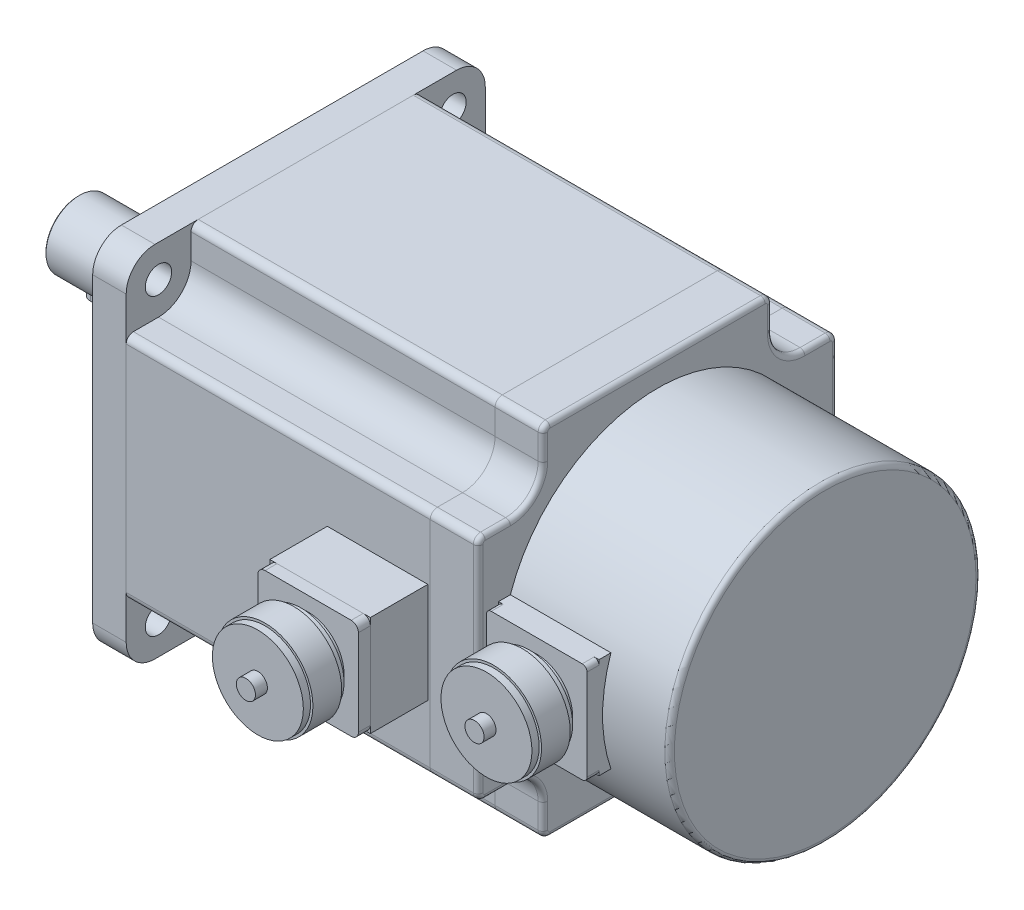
ISO-10303-21;
HEADER;
FILE_DESCRIPTION(('STEP AP214'),'2;1');
FILE_NAME('part.step','',(''),(''),'','','');
FILE_SCHEMA(('AUTOMOTIVE_DESIGN { 1 0 10303 214 1 1 1 1 }'));
ENDSEC;
DATA;
#1=APPLICATION_CONTEXT('core data for automotive mechanical design processes');
#2=APPLICATION_PROTOCOL_DEFINITION('international standard','automotive_design',2000,#1);
#3=PRODUCT_CONTEXT('',#1,'mechanical');
#4=PRODUCT('Part','Part','',(#3));
#5=PRODUCT_RELATED_PRODUCT_CATEGORY('part','',(#4));
#6=PRODUCT_DEFINITION_FORMATION('','',#4);
#7=PRODUCT_DEFINITION_CONTEXT('part definition',#1,'design');
#8=PRODUCT_DEFINITION('design','',#6,#7);
#9=PRODUCT_DEFINITION_SHAPE('','',#8);
#10=(LENGTH_UNIT() NAMED_UNIT(*) SI_UNIT(.MILLI.,.METRE.));
#11=(NAMED_UNIT(*) PLANE_ANGLE_UNIT() SI_UNIT($,.RADIAN.));
#12=(NAMED_UNIT(*) SI_UNIT($,.STERADIAN.) SOLID_ANGLE_UNIT());
#13=UNCERTAINTY_MEASURE_WITH_UNIT(LENGTH_MEASURE(1.E-05),#10,'distance_accuracy_value','');
#14=(GEOMETRIC_REPRESENTATION_CONTEXT(3) GLOBAL_UNCERTAINTY_ASSIGNED_CONTEXT((#13)) GLOBAL_UNIT_ASSIGNED_CONTEXT((#10,
#11,#12)) REPRESENTATION_CONTEXT('',''));
#15=CARTESIAN_POINT('',(0.,0.,0.));
#16=DIRECTION('',(0.,0.,1.));
#17=DIRECTION('',(1.,0.,0.));
#18=AXIS2_PLACEMENT_3D('',#15,#16,#17);
#19=CARTESIAN_POINT('',(-213.,-18.,0.));
#20=DIRECTION('',(0.,1.,0.));
#21=DIRECTION('',(0.,0.,1.));
#22=AXIS2_PLACEMENT_3D('',#19,#20,#21);
#23=CYLINDRICAL_SURFACE('',#22,3.99999999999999);
#24=CARTESIAN_POINT('',(-213.,-10.,0.));
#25=DIRECTION('',(0.,-1.,0.));
#26=DIRECTION('',(0.,0.,-1.));
#27=AXIS2_PLACEMENT_3D('',#24,#25,#26);
#28=CIRCLE('',#27,3.99999999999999);
#29=CARTESIAN_POINT('',(-213.,-10.,3.99999999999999));
#30=VERTEX_POINT('',#29);
#31=CARTESIAN_POINT('',(-213.,-10.,-3.99999999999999));
#32=VERTEX_POINT('',#31);
#33=EDGE_CURVE('E109',#30,#32,#28,.T.);
#34=ORIENTED_EDGE('',*,*,#33,.T.);
#35=DIRECTION('',(0.,1.,0.));
#36=VECTOR('',#35,1.);
#37=CARTESIAN_POINT('',(-213.,-18.,-3.99999999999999));
#38=LINE('',#37,#36);
#39=CARTESIAN_POINT('',(-213.,-18.,-3.99999999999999));
#40=VERTEX_POINT('',#39);
#41=EDGE_CURVE('E12',#40,#32,#38,.T.);
#42=ORIENTED_EDGE('',*,*,#41,.F.);
#43=CARTESIAN_POINT('',(-213.,-18.,0.));
#44=DIRECTION('',(0.,-1.,0.));
#45=DIRECTION('',(0.,0.,-1.));
#46=AXIS2_PLACEMENT_3D('',#43,#44,#45);
#47=CIRCLE('',#46,3.99999999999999);
#48=CARTESIAN_POINT('',(-213.,-18.,3.99999999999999));
#49=VERTEX_POINT('',#48);
#50=EDGE_CURVE('E97',#49,#40,#47,.T.);
#51=ORIENTED_EDGE('',*,*,#50,.F.);
#52=DIRECTION('',(0.,1.,0.));
#53=VECTOR('',#52,1.);
#54=CARTESIAN_POINT('',(-213.,-18.,3.99999999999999));
#55=LINE('',#54,#53);
#56=EDGE_CURVE('E105',#49,#30,#55,.T.);
#57=ORIENTED_EDGE('',*,*,#56,.T.);
#58=EDGE_LOOP('',(#34,#42,#51,#57));
#59=FACE_BOUND('',#58,.T.);
#60=ADVANCED_FACE('F46',(#59),#23,.T.);
#61=CARTESIAN_POINT('',(-166.,-18.,-3.99999999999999));
#62=DIRECTION('',(0.,0.,1.));
#63=DIRECTION('',(1.,0.,0.));
#64=AXIS2_PLACEMENT_3D('',#61,#62,#63);
#65=PLANE('',#64);
#66=DIRECTION('',(1.,0.,0.));
#67=VECTOR('',#66,1.);
#68=CARTESIAN_POINT('',(-166.,-10.,-3.99999999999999));
#69=LINE('',#68,#67);
#70=CARTESIAN_POINT('',(-166.,-10.,-3.99999999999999));
#71=VERTEX_POINT('',#70);
#72=EDGE_CURVE('E101',#32,#71,#69,.T.);
#73=ORIENTED_EDGE('',*,*,#72,.T.);
#74=DIRECTION('',(0.,1.,0.));
#75=VECTOR('',#74,1.);
#76=CARTESIAN_POINT('',(-166.,-18.,-3.99999999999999));
#77=LINE('',#76,#75);
#78=CARTESIAN_POINT('',(-166.,-18.,-3.99999999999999));
#79=VERTEX_POINT('',#78);
#80=EDGE_CURVE('E54',#79,#71,#77,.T.);
#81=ORIENTED_EDGE('',*,*,#80,.F.);
#82=DIRECTION('',(1.,0.,0.));
#83=VECTOR('',#82,1.);
#84=CARTESIAN_POINT('',(-166.,-18.,-3.99999999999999));
#85=LINE('',#84,#83);
#86=EDGE_CURVE('E92',#40,#79,#85,.T.);
#87=ORIENTED_EDGE('',*,*,#86,.F.);
#88=ORIENTED_EDGE('',*,*,#41,.T.);
#89=EDGE_LOOP('',(#73,#81,#87,#88));
#90=FACE_BOUND('',#89,.T.);
#91=ADVANCED_FACE('F100',(#90),#65,.F.);
#92=CARTESIAN_POINT('',(-166.,-18.,0.));
#93=DIRECTION('',(0.,1.,0.));
#94=DIRECTION('',(0.,0.,1.));
#95=AXIS2_PLACEMENT_3D('',#92,#93,#94);
#96=CYLINDRICAL_SURFACE('',#95,3.99999999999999);
#97=CARTESIAN_POINT('',(-166.,-10.,0.));
#98=DIRECTION('',(0.,-1.,0.));
#99=DIRECTION('',(0.,0.,-1.));
#100=AXIS2_PLACEMENT_3D('',#97,#98,#99);
#101=CIRCLE('',#100,3.99999999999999);
#102=CARTESIAN_POINT('',(-166.,-10.,3.99999999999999));
#103=VERTEX_POINT('',#102);
#104=EDGE_CURVE('E79',#71,#103,#101,.T.);
#105=ORIENTED_EDGE('',*,*,#104,.T.);
#106=DIRECTION('',(0.,1.,0.));
#107=VECTOR('',#106,1.);
#108=CARTESIAN_POINT('',(-166.,-18.,3.99999999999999));
#109=LINE('',#108,#107);
#110=CARTESIAN_POINT('',(-166.,-18.,3.99999999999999));
#111=VERTEX_POINT('',#110);
#112=EDGE_CURVE('E102',#111,#103,#109,.T.);
#113=ORIENTED_EDGE('',*,*,#112,.F.);
#114=CARTESIAN_POINT('',(-166.,-18.,0.));
#115=DIRECTION('',(0.,-1.,0.));
#116=DIRECTION('',(0.,0.,-1.));
#117=AXIS2_PLACEMENT_3D('',#114,#115,#116);
#118=CIRCLE('',#117,3.99999999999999);
#119=EDGE_CURVE('E95',#79,#111,#118,.T.);
#120=ORIENTED_EDGE('',*,*,#119,.F.);
#121=ORIENTED_EDGE('',*,*,#80,.T.);
#122=EDGE_LOOP('',(#105,#113,#120,#121));
#123=FACE_BOUND('',#122,.T.);
#124=ADVANCED_FACE('F103',(#123),#96,.T.);
#125=CARTESIAN_POINT('',(-213.,-18.,3.99999999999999));
#126=DIRECTION('',(0.,0.,-1.));
#127=DIRECTION('',(-1.,0.,0.));
#128=AXIS2_PLACEMENT_3D('',#125,#126,#127);
#129=PLANE('',#128);
#130=DIRECTION('',(-1.,0.,0.));
#131=VECTOR('',#130,1.);
#132=CARTESIAN_POINT('',(-213.,-10.,3.99999999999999));
#133=LINE('',#132,#131);
#134=EDGE_CURVE('E85',#103,#30,#133,.T.);
#135=ORIENTED_EDGE('',*,*,#134,.T.);
#136=ORIENTED_EDGE('',*,*,#56,.F.);
#137=DIRECTION('',(-1.,0.,0.));
#138=VECTOR('',#137,1.);
#139=CARTESIAN_POINT('',(-213.,-18.,3.99999999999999));
#140=LINE('',#139,#138);
#141=EDGE_CURVE('E62',#111,#49,#140,.T.);
#142=ORIENTED_EDGE('',*,*,#141,.F.);
#143=ORIENTED_EDGE('',*,*,#112,.T.);
#144=EDGE_LOOP('',(#135,#136,#142,#143));
#145=FACE_BOUND('',#144,.T.);
#146=ADVANCED_FACE('F116',(#145),#129,.F.);
#147=CARTESIAN_POINT('',(-213.,-18.,0.));
#148=DIRECTION('',(0.,-1.,0.));
#149=DIRECTION('',(0.,0.,-1.));
#150=AXIS2_PLACEMENT_3D('',#147,#148,#149);
#151=PLANE('',#150);
#152=ORIENTED_EDGE('',*,*,#50,.T.);
#153=ORIENTED_EDGE('',*,*,#86,.T.);
#154=ORIENTED_EDGE('',*,*,#119,.T.);
#155=ORIENTED_EDGE('',*,*,#141,.T.);
#156=EDGE_LOOP('',(#152,#153,#154,#155));
#157=FACE_BOUND('',#156,.T.);
#158=ADVANCED_FACE('F93',(#157),#151,.T.);
#159=CARTESIAN_POINT('',(-213.,-10.,0.));
#160=DIRECTION('',(0.,-1.,0.));
#161=DIRECTION('',(0.,0.,-1.));
#162=AXIS2_PLACEMENT_3D('',#159,#160,#161);
#163=PLANE('',#162);
#164=ORIENTED_EDGE('',*,*,#33,.F.);
#165=ORIENTED_EDGE('',*,*,#134,.F.);
#166=ORIENTED_EDGE('',*,*,#104,.F.);
#167=ORIENTED_EDGE('',*,*,#72,.F.);
#168=EDGE_LOOP('',(#164,#165,#166,#167));
#169=FACE_BOUND('',#168,.T.);
#170=ADVANCED_FACE('F119',(#169),#163,.F.);
#171=CLOSED_SHELL('',(#60,#91,#124,#146,#158,#170));
#172=MANIFOLD_SOLID_BREP('B2',#171);
#173=CARTESIAN_POINT('',(-222.,0.,0.));
#174=DIRECTION('',(1.,0.,0.));
#175=DIRECTION('',(0.,0.,-1.));
#176=AXIS2_PLACEMENT_3D('',#173,#174,#175);
#177=CYLINDRICAL_SURFACE('',#176,14.);
#178=CARTESIAN_POINT('',(-221.5,0.,0.));
#179=DIRECTION('',(-1.,0.,0.));
#180=DIRECTION('',(0.,0.,1.));
#181=AXIS2_PLACEMENT_3D('',#178,#179,#180);
#182=CIRCLE('',#181,14.);
#183=CARTESIAN_POINT('',(-221.5,0.,14.));
#184=VERTEX_POINT('',#183);
#185=EDGE_CURVE('E258',#184,#184,#182,.F.);
#186=ORIENTED_EDGE('',*,*,#185,.T.);
#187=EDGE_LOOP('',(#186));
#188=FACE_BOUND('',#187,.T.);
#189=CARTESIAN_POINT('',(-150.,0.,0.));
#190=DIRECTION('',(-1.,0.,0.));
#191=DIRECTION('',(0.,0.,1.));
#192=AXIS2_PLACEMENT_3D('',#189,#190,#191);
#193=CIRCLE('',#192,14.);
#194=CARTESIAN_POINT('',(-150.,0.,14.));
#195=VERTEX_POINT('',#194);
#196=EDGE_CURVE('E237',#195,#195,#193,.T.);
#197=ORIENTED_EDGE('',*,*,#196,.T.);
#198=EDGE_LOOP('',(#197));
#199=FACE_BOUND('',#198,.T.);
#200=CARTESIAN_POINT('',(-166.,-13.4164078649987,-3.99999999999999));
#201=CARTESIAN_POINT('',(-165.889963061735,-13.4163934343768,-4.00001343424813));
#202=CARTESIAN_POINT('',(-165.779934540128,-13.417761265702,-3.99545969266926));
#203=CARTESIAN_POINT('',(-165.560712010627,-13.4231542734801,-3.97732232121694));
#204=CARTESIAN_POINT('',(-165.451517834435,-13.4271788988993,-3.96374056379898));
#205=CARTESIAN_POINT('',(-165.234991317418,-13.4377658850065,-3.92769415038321));
#206=CARTESIAN_POINT('',(-165.127655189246,-13.4443222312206,-3.90525054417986));
#207=CARTESIAN_POINT('',(-164.915366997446,-13.4597622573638,-3.85169716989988));
#208=CARTESIAN_POINT('',(-164.810414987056,-13.4686459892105,-3.82058720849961));
#209=CARTESIAN_POINT('',(-164.500282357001,-13.4984072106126,-3.71462722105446));
#210=CARTESIAN_POINT('',(-164.299567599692,-13.5224082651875,-3.62710377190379));
#211=CARTESIAN_POINT('',(-163.915683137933,-13.5760110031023,-3.42099335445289));
#212=CARTESIAN_POINT('',(-163.732520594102,-13.6056149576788,-3.30239378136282));
#213=CARTESIAN_POINT('',(-163.383630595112,-13.6680345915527,-3.03385514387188));
#214=CARTESIAN_POINT('',(-163.21847497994,-13.7009134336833,-2.88318637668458));
#215=CARTESIAN_POINT('',(-162.91539864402,-13.7656378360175,-2.55635049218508));
#216=CARTESIAN_POINT('',(-162.777482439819,-13.7974832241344,-2.38017915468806));
#217=CARTESIAN_POINT('',(-162.53034061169,-13.8572672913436,-2.0032879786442));
#218=CARTESIAN_POINT('',(-162.42169609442,-13.885122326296,-1.80217262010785));
#219=CARTESIAN_POINT('',(-162.239992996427,-13.9330517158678,-1.38360719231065));
#220=CARTESIAN_POINT('',(-162.166925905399,-13.9531279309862,-1.16616104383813));
#221=CARTESIAN_POINT('',(-162.060331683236,-13.9827902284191,-0.727119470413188));
#222=CARTESIAN_POINT('',(-162.025822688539,-13.9926363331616,-0.505780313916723));
#223=CARTESIAN_POINT('',(-161.994226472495,-14.0016419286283,-0.0602449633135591));
#224=CARTESIAN_POINT('',(-161.997132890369,-14.0008032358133,0.163950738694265));
#225=CARTESIAN_POINT('',(-162.039612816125,-13.9887201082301,0.601961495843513));
#226=CARTESIAN_POINT('',(-162.078123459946,-13.9777773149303,0.815889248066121));
#227=CARTESIAN_POINT('',(-162.188991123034,-13.9470775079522,1.23410663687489));
#228=CARTESIAN_POINT('',(-162.261349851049,-13.9273200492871,1.43839578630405));
#229=CARTESIAN_POINT('',(-162.438618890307,-13.8807804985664,1.83414901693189));
#230=CARTESIAN_POINT('',(-162.543876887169,-13.853923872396,2.02544821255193));
#231=CARTESIAN_POINT('',(-162.783693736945,-13.7960546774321,2.38801825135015));
#232=CARTESIAN_POINT('',(-162.918258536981,-13.7650412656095,2.55928501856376));
#233=CARTESIAN_POINT('',(-163.218386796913,-13.7009177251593,2.88324485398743));
#234=CARTESIAN_POINT('',(-163.384870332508,-13.6677722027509,3.03507809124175));
#235=CARTESIAN_POINT('',(-163.741426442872,-13.6040627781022,3.30897556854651));
#236=CARTESIAN_POINT('',(-163.931505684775,-13.573499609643,3.43103136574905));
#237=CARTESIAN_POINT('',(-164.231158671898,-13.5321405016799,3.58945338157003));
#238=CARTESIAN_POINT('',(-164.333989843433,-13.5190503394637,3.63832313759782));
#239=CARTESIAN_POINT('',(-164.543626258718,-13.4948216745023,3.72718558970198));
#240=CARTESIAN_POINT('',(-164.650429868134,-13.4836823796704,3.76718189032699));
#241=CARTESIAN_POINT('',(-164.867138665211,-13.463719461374,3.83791732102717));
#242=CARTESIAN_POINT('',(-164.977040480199,-13.4548934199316,3.86866612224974));
#243=CARTESIAN_POINT('',(-165.199195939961,-13.4398293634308,3.92067829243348));
#244=CARTESIAN_POINT('',(-165.311448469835,-13.4335901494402,3.94194605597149));
#245=CARTESIAN_POINT('',(-165.519732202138,-13.4246640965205,3.97223001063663));
#246=CARTESIAN_POINT('',(-165.615545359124,-13.4215735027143,3.98264484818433));
#247=CARTESIAN_POINT('',(-165.807569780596,-13.4174428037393,3.99652828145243));
#248=CARTESIAN_POINT('',(-165.903780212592,-13.4163995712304,4.0000074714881));
#249=CARTESIAN_POINT('',(-166.,-13.4164078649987,3.99999999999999));
#250=B_SPLINE_CURVE_WITH_KNOTS('',3,(#200,#201,#202,#203,#204,#205,#206,#207,#208,#209,#210,
#211,#212,#213,#214,#215,#216,#217,#218,#219,#220,#221,#222,#223,#224,#225,#226,#227,#228,#229,
#230,#231,#232,#233,#234,#235,#236,#237,#238,#239,#240,#241,#242,#243,#244,#245,#246,#247,#248,
#249),.UNSPECIFIED.,.F.,.F.,(4,2,2,2,2,2,2,2,2,2,2,2,2,2,2,2,2,2,2,2,2,2,2,2,4),(0.,
0.329993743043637,0.659919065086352,0.98906537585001,1.31821902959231,1.97575167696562,
2.6335514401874,3.30832474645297,3.98320984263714,4.67064278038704,5.35791119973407,
6.02724874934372,6.6964725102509,7.34634193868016,7.99624417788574,8.65326120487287,
9.31041168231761,9.99056134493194,10.6709036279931,11.0143588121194,11.357674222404,
11.700629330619,12.0434253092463,12.3324405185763,12.6210139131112),.UNSPECIFIED.);
#251=CARTESIAN_POINT('',(-166.,-13.4164078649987,-3.99999999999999));
#252=VERTEX_POINT('',#251);
#253=CARTESIAN_POINT('',(-166.,-13.4164078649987,3.99999999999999));
#254=VERTEX_POINT('',#253);
#255=EDGE_CURVE('E261',#252,#254,#250,.T.);
#256=ORIENTED_EDGE('',*,*,#255,.F.);
#257=DIRECTION('',(1.,0.,0.));
#258=VECTOR('',#257,1.);
#259=CARTESIAN_POINT('',(-222.,-13.4164078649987,-3.99999999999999));
#260=LINE('',#259,#258);
#261=CARTESIAN_POINT('',(-213.,-13.4164078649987,-3.99999999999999));
#262=VERTEX_POINT('',#261);
#263=EDGE_CURVE('E44',#262,#252,#260,.T.);
#264=ORIENTED_EDGE('',*,*,#263,.F.);
#265=CARTESIAN_POINT('',(-213.,-13.4164078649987,3.99999999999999));
#266=CARTESIAN_POINT('',(-213.110036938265,-13.4163934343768,4.00001343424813));
#267=CARTESIAN_POINT('',(-213.220065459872,-13.417761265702,3.99545969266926));
#268=CARTESIAN_POINT('',(-213.439287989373,-13.4231542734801,3.97732232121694));
#269=CARTESIAN_POINT('',(-213.548482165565,-13.4271788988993,3.96374056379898));
#270=CARTESIAN_POINT('',(-213.765008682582,-13.4377658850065,3.92769415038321));
#271=CARTESIAN_POINT('',(-213.872344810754,-13.4443222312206,3.90525054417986));
#272=CARTESIAN_POINT('',(-214.084633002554,-13.4597622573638,3.85169716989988));
#273=CARTESIAN_POINT('',(-214.189585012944,-13.4686459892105,3.82058720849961));
#274=CARTESIAN_POINT('',(-214.499717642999,-13.4984072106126,3.71462722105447));
#275=CARTESIAN_POINT('',(-214.700432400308,-13.5224082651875,3.62710377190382));
#276=CARTESIAN_POINT('',(-215.084316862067,-13.5760110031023,3.42099335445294));
#277=CARTESIAN_POINT('',(-215.267479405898,-13.6056149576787,3.30239378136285));
#278=CARTESIAN_POINT('',(-215.616369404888,-13.6680345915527,3.03385514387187));
#279=CARTESIAN_POINT('',(-215.78152502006,-13.7009134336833,2.88318637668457));
#280=CARTESIAN_POINT('',(-216.08460135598,-13.7656378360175,2.55635049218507));
#281=CARTESIAN_POINT('',(-216.222517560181,-13.7974832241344,2.38017915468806));
#282=CARTESIAN_POINT('',(-216.46965938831,-13.8572672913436,2.00328797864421));
#283=CARTESIAN_POINT('',(-216.57830390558,-13.885122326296,1.80217262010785));
#284=CARTESIAN_POINT('',(-216.760007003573,-13.9330517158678,1.38360719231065));
#285=CARTESIAN_POINT('',(-216.833074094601,-13.9531279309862,1.16616104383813));
#286=CARTESIAN_POINT('',(-216.939668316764,-13.9827902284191,0.727119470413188));
#287=CARTESIAN_POINT('',(-216.974177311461,-13.9926363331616,0.505780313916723));
#288=CARTESIAN_POINT('',(-217.005773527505,-14.0016419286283,0.0602449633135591));
#289=CARTESIAN_POINT('',(-217.002867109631,-14.0008032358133,-0.163950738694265));
#290=CARTESIAN_POINT('',(-216.960387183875,-13.9887201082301,-0.601961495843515));
#291=CARTESIAN_POINT('',(-216.921876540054,-13.9777773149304,-0.815889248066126));
#292=CARTESIAN_POINT('',(-216.811008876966,-13.9470775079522,-1.2341066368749));
#293=CARTESIAN_POINT('',(-216.738650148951,-13.9273200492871,-1.43839578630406));
#294=CARTESIAN_POINT('',(-216.561381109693,-13.8807804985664,-1.83414901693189));
#295=CARTESIAN_POINT('',(-216.456123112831,-13.853923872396,-2.02544821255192));
#296=CARTESIAN_POINT('',(-216.216306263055,-13.7960546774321,-2.38801825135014));
#297=CARTESIAN_POINT('',(-216.081741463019,-13.7650412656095,-2.55928501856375));
#298=CARTESIAN_POINT('',(-215.781613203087,-13.7009177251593,-2.88324485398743));
#299=CARTESIAN_POINT('',(-215.615129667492,-13.6677722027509,-3.03507809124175));
#300=CARTESIAN_POINT('',(-215.258573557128,-13.6040627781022,-3.30897556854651));
#301=CARTESIAN_POINT('',(-215.068494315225,-13.573499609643,-3.43103136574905));
#302=CARTESIAN_POINT('',(-214.768841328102,-13.5321405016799,-3.58945338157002));
#303=CARTESIAN_POINT('',(-214.666010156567,-13.5190503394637,-3.63832313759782));
#304=CARTESIAN_POINT('',(-214.456373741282,-13.4948216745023,-3.72718558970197));
#305=CARTESIAN_POINT('',(-214.349570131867,-13.4836823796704,-3.76718189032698));
#306=CARTESIAN_POINT('',(-214.13286133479,-13.463719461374,-3.83791732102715));
#307=CARTESIAN_POINT('',(-214.022959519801,-13.4548934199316,-3.86866612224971));
#308=CARTESIAN_POINT('',(-213.800804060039,-13.4398293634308,-3.92067829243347));
#309=CARTESIAN_POINT('',(-213.688551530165,-13.4335901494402,-3.94194605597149));
#310=CARTESIAN_POINT('',(-213.480267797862,-13.4246640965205,-3.97223001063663));
#311=CARTESIAN_POINT('',(-213.384454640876,-13.4215735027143,-3.98264484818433));
#312=CARTESIAN_POINT('',(-213.192430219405,-13.4174428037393,-3.99652828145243));
#313=CARTESIAN_POINT('',(-213.096219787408,-13.4163995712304,-4.0000074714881));
#314=CARTESIAN_POINT('',(-213.,-13.4164078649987,-3.99999999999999));
#315=B_SPLINE_CURVE_WITH_KNOTS('',3,(#265,#266,#267,#268,#269,#270,#271,#272,#273,#274,#275,
#276,#277,#278,#279,#280,#281,#282,#283,#284,#285,#286,#287,#288,#289,#290,#291,#292,#293,#294,
#295,#296,#297,#298,#299,#300,#301,#302,#303,#304,#305,#306,#307,#308,#309,#310,#311,#312,#313,
#314),.UNSPECIFIED.,.F.,.F.,(4,2,2,2,2,2,2,2,2,2,2,2,2,2,2,2,2,2,2,2,2,2,2,2,4),(0.,
0.329993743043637,0.659919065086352,0.98906537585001,1.31821902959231,1.97575167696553,
2.6335514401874,3.30832474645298,3.98320984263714,4.67064278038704,5.35791119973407,
6.02724874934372,6.69647251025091,7.34634193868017,7.99624417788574,8.65326120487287,
9.31041168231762,9.99056134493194,10.6709036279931,11.0143588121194,11.357674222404,
11.7006293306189,12.0434253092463,12.3324405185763,12.6210139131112),.UNSPECIFIED.);
#316=CARTESIAN_POINT('',(-213.,-13.4164078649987,3.99999999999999));
#317=VERTEX_POINT('',#316);
#318=EDGE_CURVE('E186',#317,#262,#315,.T.);
#319=ORIENTED_EDGE('',*,*,#318,.F.);
#320=DIRECTION('',(1.,0.,0.));
#321=VECTOR('',#320,1.);
#322=CARTESIAN_POINT('',(-222.,-13.4164078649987,3.99999999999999));
#323=LINE('',#322,#321);
#324=EDGE_CURVE('E236',#254,#317,#323,.F.);
#325=ORIENTED_EDGE('',*,*,#324,.F.);
#326=EDGE_LOOP('',(#256,#264,#319,#325));
#327=FACE_BOUND('',#326,.T.);
#328=ADVANCED_FACE('F178',(#188,#199,#327),#177,.T.);
#329=CARTESIAN_POINT('',(-150.,0.,0.));
#330=DIRECTION('',(-1.,0.,0.));
#331=DIRECTION('',(0.,0.,1.));
#332=AXIS2_PLACEMENT_3D('',#329,#330,#331);
#333=PLANE('',#332);
#334=CARTESIAN_POINT('',(-150.,0.,0.));
#335=DIRECTION('',(-1.,0.,0.));
#336=DIRECTION('',(0.,0.,1.));
#337=AXIS2_PLACEMENT_3D('',#334,#335,#336);
#338=CIRCLE('',#337,17.);
#339=CARTESIAN_POINT('',(-150.,0.,17.));
#340=VERTEX_POINT('',#339);
#341=EDGE_CURVE('E249',#340,#340,#338,.T.);
#342=ORIENTED_EDGE('',*,*,#341,.T.);
#343=EDGE_LOOP('',(#342));
#344=FACE_BOUND('',#343,.T.);
#345=ORIENTED_EDGE('',*,*,#196,.F.);
#346=EDGE_LOOP('',(#345));
#347=FACE_BOUND('',#346,.T.);
#348=ADVANCED_FACE('F298',(#344,#347),#333,.T.);
#349=CARTESIAN_POINT('',(-150.,0.,0.));
#350=DIRECTION('',(1.,0.,0.));
#351=DIRECTION('',(0.,0.,-1.));
#352=AXIS2_PLACEMENT_3D('',#349,#350,#351);
#353=CYLINDRICAL_SURFACE('',#352,17.5);
#354=CARTESIAN_POINT('',(-149.5,0.,0.));
#355=DIRECTION('',(-1.,0.,0.));
#356=DIRECTION('',(0.,0.,1.));
#357=AXIS2_PLACEMENT_3D('',#354,#355,#356);
#358=CIRCLE('',#357,17.5);
#359=CARTESIAN_POINT('',(-149.5,0.,17.5));
#360=VERTEX_POINT('',#359);
#361=EDGE_CURVE('E252',#360,#360,#358,.F.);
#362=ORIENTED_EDGE('',*,*,#361,.T.);
#363=EDGE_LOOP('',(#362));
#364=FACE_BOUND('',#363,.T.);
#365=CARTESIAN_POINT('',(-147.,0.,0.));
#366=DIRECTION('',(-1.,0.,0.));
#367=DIRECTION('',(0.,0.,1.));
#368=AXIS2_PLACEMENT_3D('',#365,#366,#367);
#369=CIRCLE('',#368,17.5);
#370=CARTESIAN_POINT('',(-147.,0.,17.5));
#371=VERTEX_POINT('',#370);
#372=EDGE_CURVE('E241',#371,#371,#369,.T.);
#373=ORIENTED_EDGE('',*,*,#372,.T.);
#374=EDGE_LOOP('',(#373));
#375=FACE_BOUND('',#374,.T.);
#376=ADVANCED_FACE('F303',(#364,#375),#353,.T.);
#377=CARTESIAN_POINT('',(-147.,0.,0.));
#378=DIRECTION('',(-1.,0.,0.));
#379=DIRECTION('',(0.,0.,1.));
#380=AXIS2_PLACEMENT_3D('',#377,#378,#379);
#381=PLANE('',#380);
#382=ORIENTED_EDGE('',*,*,#372,.F.);
#383=EDGE_LOOP('',(#382));
#384=FACE_BOUND('',#383,.T.);
#385=ADVANCED_FACE('F319',(#384),#381,.F.);
#386=CARTESIAN_POINT('',(-149.5,0.,0.));
#387=DIRECTION('',(-1.,0.,0.));
#388=DIRECTION('',(0.,0.,1.));
#389=AXIS2_PLACEMENT_3D('',#386,#387,#388);
#390=TOROIDAL_SURFACE('',#389,17.,0.5);
#391=ORIENTED_EDGE('',*,*,#361,.F.);
#392=EDGE_LOOP('',(#391));
#393=FACE_BOUND('',#392,.T.);
#394=ORIENTED_EDGE('',*,*,#341,.F.);
#395=EDGE_LOOP('',(#394));
#396=FACE_BOUND('',#395,.T.);
#397=ADVANCED_FACE('F315',(#393,#396),#390,.T.);
#398=CARTESIAN_POINT('',(-222.,0.,0.));
#399=DIRECTION('',(-1.,0.,0.));
#400=DIRECTION('',(0.,0.,1.));
#401=AXIS2_PLACEMENT_3D('',#398,#399,#400);
#402=PLANE('',#401);
#403=CARTESIAN_POINT('',(-222.,0.,0.));
#404=DIRECTION('',(-1.,0.,0.));
#405=DIRECTION('',(0.,0.,1.));
#406=AXIS2_PLACEMENT_3D('',#403,#404,#405);
#407=CIRCLE('',#406,13.5);
#408=CARTESIAN_POINT('',(-222.,0.,13.5));
#409=VERTEX_POINT('',#408);
#410=EDGE_CURVE('E255',#409,#409,#407,.T.);
#411=ORIENTED_EDGE('',*,*,#410,.T.);
#412=EDGE_LOOP('',(#411));
#413=FACE_BOUND('',#412,.T.);
#414=ADVANCED_FACE('F283',(#413),#402,.T.);
#415=CARTESIAN_POINT('',(-222.,0.,0.));
#416=DIRECTION('',(1.,0.,0.));
#417=DIRECTION('',(0.,0.,-1.));
#418=AXIS2_PLACEMENT_3D('',#415,#416,#417);
#419=CONICAL_SURFACE('',#418,13.5,0.78539816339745);
#420=ORIENTED_EDGE('',*,*,#185,.F.);
#421=EDGE_LOOP('',(#420));
#422=FACE_BOUND('',#421,.T.);
#423=ORIENTED_EDGE('',*,*,#410,.F.);
#424=EDGE_LOOP('',(#423));
#425=FACE_BOUND('',#424,.T.);
#426=ADVANCED_FACE('F180',(#422,#425),#419,.T.);
#427=CARTESIAN_POINT('',(-213.,-10.,0.));
#428=DIRECTION('',(0.,-1.,0.));
#429=DIRECTION('',(0.,0.,-1.));
#430=AXIS2_PLACEMENT_3D('',#427,#428,#429);
#431=CYLINDRICAL_SURFACE('',#430,3.99999999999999);
#432=DIRECTION('',(0.,-1.,0.));
#433=VECTOR('',#432,1.);
#434=CARTESIAN_POINT('',(-213.,-10.,3.99999999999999));
#435=LINE('',#434,#433);
#436=CARTESIAN_POINT('',(-213.,-10.,3.99999999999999));
#437=VERTEX_POINT('',#436);
#438=EDGE_CURVE('E233',#437,#317,#435,.T.);
#439=ORIENTED_EDGE('',*,*,#438,.T.);
#440=ORIENTED_EDGE('',*,*,#318,.T.);
#441=DIRECTION('',(0.,-1.,0.));
#442=VECTOR('',#441,1.);
#443=CARTESIAN_POINT('',(-213.,-10.,-3.99999999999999));
#444=LINE('',#443,#442);
#445=CARTESIAN_POINT('',(-213.,-10.,-3.99999999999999));
#446=VERTEX_POINT('',#445);
#447=EDGE_CURVE('E192',#446,#262,#444,.T.);
#448=ORIENTED_EDGE('',*,*,#447,.F.);
#449=CARTESIAN_POINT('',(-213.,-10.,0.));
#450=DIRECTION('',(0.,1.,0.));
#451=DIRECTION('',(0.,0.,1.));
#452=AXIS2_PLACEMENT_3D('',#449,#450,#451);
#453=CIRCLE('',#452,3.99999999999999);
#454=EDGE_CURVE('E223',#446,#437,#453,.T.);
#455=ORIENTED_EDGE('',*,*,#454,.T.);
#456=EDGE_LOOP('',(#439,#440,#448,#455));
#457=FACE_BOUND('',#456,.T.);
#458=ADVANCED_FACE('F232',(#457),#431,.F.);
#459=CARTESIAN_POINT('',(-213.,-10.,3.99999999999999));
#460=DIRECTION('',(0.,0.,-1.));
#461=DIRECTION('',(-1.,0.,0.));
#462=AXIS2_PLACEMENT_3D('',#459,#460,#461);
#463=PLANE('',#462);
#464=ORIENTED_EDGE('',*,*,#324,.T.);
#465=ORIENTED_EDGE('',*,*,#438,.F.);
#466=DIRECTION('',(1.,0.,0.));
#467=VECTOR('',#466,1.);
#468=CARTESIAN_POINT('',(-213.,-10.,3.99999999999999));
#469=LINE('',#468,#467);
#470=CARTESIAN_POINT('',(-166.,-10.,3.99999999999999));
#471=VERTEX_POINT('',#470);
#472=EDGE_CURVE('E219',#437,#471,#469,.T.);
#473=ORIENTED_EDGE('',*,*,#472,.T.);
#474=DIRECTION('',(0.,-1.,0.));
#475=VECTOR('',#474,1.);
#476=CARTESIAN_POINT('',(-166.,-10.,3.99999999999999));
#477=LINE('',#476,#475);
#478=EDGE_CURVE('E238',#471,#254,#477,.T.);
#479=ORIENTED_EDGE('',*,*,#478,.T.);
#480=EDGE_LOOP('',(#464,#465,#473,#479));
#481=FACE_BOUND('',#480,.T.);
#482=ADVANCED_FACE('F235',(#481),#463,.T.);
#483=CARTESIAN_POINT('',(-166.,-10.,0.));
#484=DIRECTION('',(0.,-1.,0.));
#485=DIRECTION('',(0.,0.,-1.));
#486=AXIS2_PLACEMENT_3D('',#483,#484,#485);
#487=CYLINDRICAL_SURFACE('',#486,3.99999999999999);
#488=DIRECTION('',(0.,-1.,0.));
#489=VECTOR('',#488,1.);
#490=CARTESIAN_POINT('',(-166.,-10.,-3.99999999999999));
#491=LINE('',#490,#489);
#492=CARTESIAN_POINT('',(-166.,-10.,-3.99999999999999));
#493=VERTEX_POINT('',#492);
#494=EDGE_CURVE('E243',#493,#252,#491,.T.);
#495=ORIENTED_EDGE('',*,*,#494,.T.);
#496=ORIENTED_EDGE('',*,*,#255,.T.);
#497=ORIENTED_EDGE('',*,*,#478,.F.);
#498=CARTESIAN_POINT('',(-166.,-10.,0.));
#499=DIRECTION('',(0.,1.,0.));
#500=DIRECTION('',(0.,0.,1.));
#501=AXIS2_PLACEMENT_3D('',#498,#499,#500);
#502=CIRCLE('',#501,3.99999999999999);
#503=EDGE_CURVE('E224',#471,#493,#502,.T.);
#504=ORIENTED_EDGE('',*,*,#503,.T.);
#505=EDGE_LOOP('',(#495,#496,#497,#504));
#506=FACE_BOUND('',#505,.T.);
#507=ADVANCED_FACE('F271',(#506),#487,.F.);
#508=CARTESIAN_POINT('',(-166.,-10.,-3.99999999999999));
#509=DIRECTION('',(0.,0.,1.));
#510=DIRECTION('',(1.,0.,0.));
#511=AXIS2_PLACEMENT_3D('',#508,#509,#510);
#512=PLANE('',#511);
#513=ORIENTED_EDGE('',*,*,#263,.T.);
#514=ORIENTED_EDGE('',*,*,#494,.F.);
#515=DIRECTION('',(-1.,0.,0.));
#516=VECTOR('',#515,1.);
#517=CARTESIAN_POINT('',(-166.,-10.,-3.99999999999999));
#518=LINE('',#517,#516);
#519=EDGE_CURVE('E289',#493,#446,#518,.T.);
#520=ORIENTED_EDGE('',*,*,#519,.T.);
#521=ORIENTED_EDGE('',*,*,#447,.T.);
#522=EDGE_LOOP('',(#513,#514,#520,#521));
#523=FACE_BOUND('',#522,.T.);
#524=ADVANCED_FACE('F276',(#523),#512,.T.);
#525=CARTESIAN_POINT('',(-213.,-10.,0.));
#526=DIRECTION('',(0.,1.,0.));
#527=DIRECTION('',(0.,0.,1.));
#528=AXIS2_PLACEMENT_3D('',#525,#526,#527);
#529=PLANE('',#528);
#530=ORIENTED_EDGE('',*,*,#454,.F.);
#531=ORIENTED_EDGE('',*,*,#519,.F.);
#532=ORIENTED_EDGE('',*,*,#503,.F.);
#533=ORIENTED_EDGE('',*,*,#472,.F.);
#534=EDGE_LOOP('',(#530,#531,#532,#533));
#535=FACE_BOUND('',#534,.T.);
#536=ADVANCED_FACE('F221',(#535),#529,.F.);
#537=CLOSED_SHELL('',(#328,#348,#376,#385,#397,#414,#426,#458,#482,#507,#524,#536));
#538=MANIFOLD_SOLID_BREP('B6',#537);
#539=CARTESIAN_POINT('',(-22.,0.,125.));
#540=DIRECTION('',(0.,0.,1.));
#541=DIRECTION('',(1.,0.,0.));
#542=AXIS2_PLACEMENT_3D('',#539,#540,#541);
#543=PLANE('',#542);
#544=CARTESIAN_POINT('',(-22.,0.,125.));
#545=DIRECTION('',(0.,0.,1.));
#546=DIRECTION('',(1.,0.,0.));
#547=AXIS2_PLACEMENT_3D('',#544,#545,#546);
#548=CIRCLE('',#547,19.);
#549=CARTESIAN_POINT('',(-3.,0.,125.));
#550=VERTEX_POINT('',#549);
#551=EDGE_CURVE('E421',#550,#550,#548,.T.);
#552=ORIENTED_EDGE('',*,*,#551,.T.);
#553=EDGE_LOOP('',(#552));
#554=FACE_BOUND('',#553,.T.);
#555=CARTESIAN_POINT('',(-22.,0.,125.));
#556=DIRECTION('',(0.,0.,1.));
#557=DIRECTION('',(1.,0.,0.));
#558=AXIS2_PLACEMENT_3D('',#555,#556,#557);
#559=CIRCLE('',#558,4.);
#560=CARTESIAN_POINT('',(-18.,0.,125.));
#561=VERTEX_POINT('',#560);
#562=EDGE_CURVE('E429',#561,#561,#559,.T.);
#563=ORIENTED_EDGE('',*,*,#562,.F.);
#564=EDGE_LOOP('',(#563));
#565=FACE_BOUND('',#564,.T.);
#566=ADVANCED_FACE('F410',(#554,#565),#543,.T.);
#567=CARTESIAN_POINT('',(-22.,0.,122.));
#568=DIRECTION('',(0.,0.,1.));
#569=DIRECTION('',(1.,0.,0.));
#570=AXIS2_PLACEMENT_3D('',#567,#568,#569);
#571=PLANE('',#570);
#572=CARTESIAN_POINT('',(-22.,0.,122.));
#573=DIRECTION('',(0.,0.,1.));
#574=DIRECTION('',(1.,0.,0.));
#575=AXIS2_PLACEMENT_3D('',#572,#573,#574);
#576=CIRCLE('',#575,20.);
#577=CARTESIAN_POINT('',(-2.,0.,122.));
#578=VERTEX_POINT('',#577);
#579=EDGE_CURVE('E177',#578,#578,#576,.T.);
#580=ORIENTED_EDGE('',*,*,#579,.T.);
#581=EDGE_LOOP('',(#580));
#582=FACE_BOUND('',#581,.T.);
#583=CARTESIAN_POINT('',(-22.,0.,122.));
#584=DIRECTION('',(0.,0.,1.));
#585=DIRECTION('',(1.,0.,0.));
#586=AXIS2_PLACEMENT_3D('',#583,#584,#585);
#587=CIRCLE('',#586,19.);
#588=CARTESIAN_POINT('',(-3.,0.,122.));
#589=VERTEX_POINT('',#588);
#590=EDGE_CURVE('E423',#589,#589,#587,.T.);
#591=ORIENTED_EDGE('',*,*,#590,.F.);
#592=EDGE_LOOP('',(#591));
#593=FACE_BOUND('',#592,.T.);
#594=ADVANCED_FACE('F445',(#582,#593),#571,.T.);
#595=CARTESIAN_POINT('',(-22.,0.,122.));
#596=DIRECTION('',(0.,0.,-1.));
#597=DIRECTION('',(-1.,0.,0.));
#598=AXIS2_PLACEMENT_3D('',#595,#596,#597);
#599=CYLINDRICAL_SURFACE('',#598,20.);
#600=ORIENTED_EDGE('',*,*,#579,.F.);
#601=EDGE_LOOP('',(#600));
#602=FACE_BOUND('',#601,.T.);
#603=CARTESIAN_POINT('',(-22.,0.,110.));
#604=DIRECTION('',(0.,0.,1.));
#605=DIRECTION('',(1.,0.,0.));
#606=AXIS2_PLACEMENT_3D('',#603,#604,#605);
#607=CIRCLE('',#606,20.);
#608=CARTESIAN_POINT('',(-2.,0.,110.));
#609=VERTEX_POINT('',#608);
#610=EDGE_CURVE('E414',#609,#609,#607,.T.);
#611=ORIENTED_EDGE('',*,*,#610,.T.);
#612=EDGE_LOOP('',(#611));
#613=FACE_BOUND('',#612,.T.);
#614=ADVANCED_FACE('F412',(#602,#613),#599,.T.);
#615=CARTESIAN_POINT('',(-22.,0.,110.));
#616=DIRECTION('',(0.,0.,1.));
#617=DIRECTION('',(1.,0.,0.));
#618=AXIS2_PLACEMENT_3D('',#615,#616,#617);
#619=PLANE('',#618);
#620=ORIENTED_EDGE('',*,*,#610,.F.);
#621=EDGE_LOOP('',(#620));
#622=FACE_BOUND('',#621,.T.);
#623=ADVANCED_FACE('F455',(#622),#619,.F.);
#624=CARTESIAN_POINT('',(-22.,0.,125.));
#625=DIRECTION('',(0.,0.,-1.));
#626=DIRECTION('',(-1.,0.,0.));
#627=AXIS2_PLACEMENT_3D('',#624,#625,#626);
#628=CYLINDRICAL_SURFACE('',#627,19.);
#629=ORIENTED_EDGE('',*,*,#551,.F.);
#630=EDGE_LOOP('',(#629));
#631=FACE_BOUND('',#630,.T.);
#632=ORIENTED_EDGE('',*,*,#590,.T.);
#633=EDGE_LOOP('',(#632));
#634=FACE_BOUND('',#633,.T.);
#635=ADVANCED_FACE('F440',(#631,#634),#628,.T.);
#636=CARTESIAN_POINT('',(-22.,0.,130.));
#637=DIRECTION('',(0.,0.,-1.));
#638=DIRECTION('',(-1.,0.,0.));
#639=AXIS2_PLACEMENT_3D('',#636,#637,#638);
#640=CYLINDRICAL_SURFACE('',#639,4.);
#641=CARTESIAN_POINT('',(-22.,0.,130.));
#642=DIRECTION('',(0.,0.,1.));
#643=DIRECTION('',(1.,0.,0.));
#644=AXIS2_PLACEMENT_3D('',#641,#642,#643);
#645=CIRCLE('',#644,4.);
#646=CARTESIAN_POINT('',(-18.,0.,130.));
#647=VERTEX_POINT('',#646);
#648=EDGE_CURVE('E426',#647,#647,#645,.T.);
#649=ORIENTED_EDGE('',*,*,#648,.F.);
#650=EDGE_LOOP('',(#649));
#651=FACE_BOUND('',#650,.T.);
#652=ORIENTED_EDGE('',*,*,#562,.T.);
#653=EDGE_LOOP('',(#652));
#654=FACE_BOUND('',#653,.T.);
#655=ADVANCED_FACE('F437',(#651,#654),#640,.T.);
#656=CARTESIAN_POINT('',(-22.,0.,130.));
#657=DIRECTION('',(0.,0.,1.));
#658=DIRECTION('',(1.,0.,0.));
#659=AXIS2_PLACEMENT_3D('',#656,#657,#658);
#660=PLANE('',#659);
#661=ORIENTED_EDGE('',*,*,#648,.T.);
#662=EDGE_LOOP('',(#661));
#663=FACE_BOUND('',#662,.T.);
#664=ADVANCED_FACE('F435',(#663),#660,.T.);
#665=CLOSED_SHELL('',(#566,#594,#614,#623,#635,#655,#664));
#666=MANIFOLD_SOLID_BREP('B38',#665);
#667=CARTESIAN_POINT('',(-22.,0.,110.));
#668=DIRECTION('',(0.,0.,-1.));
#669=DIRECTION('',(-1.,0.,0.));
#670=AXIS2_PLACEMENT_3D('',#667,#668,#669);
#671=CYLINDRICAL_SURFACE('',#670,18.);
#672=CARTESIAN_POINT('',(-22.,0.,110.));
#673=DIRECTION('',(0.,0.,1.));
#674=DIRECTION('',(1.,0.,0.));
#675=AXIS2_PLACEMENT_3D('',#672,#673,#674);
#676=CIRCLE('',#675,18.);
#677=CARTESIAN_POINT('',(-4.,0.,110.));
#678=VERTEX_POINT('',#677);
#679=EDGE_CURVE('E409',#678,#678,#676,.T.);
#680=ORIENTED_EDGE('',*,*,#679,.F.);
#681=EDGE_LOOP('',(#680));
#682=FACE_BOUND('',#681,.T.);
#683=CARTESIAN_POINT('',(-22.,0.,107.));
#684=DIRECTION('',(0.,0.,1.));
#685=DIRECTION('',(1.,0.,0.));
#686=AXIS2_PLACEMENT_3D('',#683,#684,#685);
#687=CIRCLE('',#686,18.);
#688=CARTESIAN_POINT('',(-4.,0.,107.));
#689=VERTEX_POINT('',#688);
#690=EDGE_CURVE('E522',#689,#689,#687,.T.);
#691=ORIENTED_EDGE('',*,*,#690,.T.);
#692=EDGE_LOOP('',(#691));
#693=FACE_BOUND('',#692,.T.);
#694=ADVANCED_FACE('F519',(#682,#693),#671,.T.);
#695=CARTESIAN_POINT('',(-22.,0.,110.));
#696=DIRECTION('',(0.,0.,1.));
#697=DIRECTION('',(1.,0.,0.));
#698=AXIS2_PLACEMENT_3D('',#695,#696,#697);
#699=PLANE('',#698);
#700=ORIENTED_EDGE('',*,*,#679,.T.);
#701=EDGE_LOOP('',(#700));
#702=FACE_BOUND('',#701,.T.);
#703=ADVANCED_FACE('F534',(#702),#699,.T.);
#704=CARTESIAN_POINT('',(-22.,0.,107.));
#705=DIRECTION('',(0.,0.,1.));
#706=DIRECTION('',(1.,0.,0.));
#707=AXIS2_PLACEMENT_3D('',#704,#705,#706);
#708=PLANE('',#707);
#709=ORIENTED_EDGE('',*,*,#690,.F.);
#710=EDGE_LOOP('',(#709));
#711=FACE_BOUND('',#710,.T.);
#712=ADVANCED_FACE('F532',(#711),#708,.F.);
#713=CLOSED_SHELL('',(#694,#703,#712));
#714=MANIFOLD_SOLID_BREP('B172',#713);
#715=CARTESIAN_POINT('',(-22.,0.,107.));
#716=DIRECTION('',(0.,0.,-1.));
#717=DIRECTION('',(-1.,0.,0.));
#718=AXIS2_PLACEMENT_3D('',#715,#716,#717);
#719=CYLINDRICAL_SURFACE('',#718,15.);
#720=CARTESIAN_POINT('',(-22.,0.,107.));
#721=DIRECTION('',(0.,0.,1.));
#722=DIRECTION('',(1.,0.,0.));
#723=AXIS2_PLACEMENT_3D('',#720,#721,#722);
#724=CIRCLE('',#723,15.);
#725=CARTESIAN_POINT('',(-7.,0.,107.));
#726=VERTEX_POINT('',#725);
#727=EDGE_CURVE('E518',#726,#726,#724,.T.);
#728=ORIENTED_EDGE('',*,*,#727,.F.);
#729=EDGE_LOOP('',(#728));
#730=FACE_BOUND('',#729,.T.);
#731=CARTESIAN_POINT('',(-22.,0.,104.));
#732=DIRECTION('',(0.,0.,1.));
#733=DIRECTION('',(1.,0.,0.));
#734=AXIS2_PLACEMENT_3D('',#731,#732,#733);
#735=CIRCLE('',#734,15.);
#736=CARTESIAN_POINT('',(-7.,0.,104.));
#737=VERTEX_POINT('',#736);
#738=EDGE_CURVE('E573',#737,#737,#735,.T.);
#739=ORIENTED_EDGE('',*,*,#738,.T.);
#740=EDGE_LOOP('',(#739));
#741=FACE_BOUND('',#740,.T.);
#742=ADVANCED_FACE('F570',(#730,#741),#719,.T.);
#743=CARTESIAN_POINT('',(-22.,0.,107.));
#744=DIRECTION('',(0.,0.,1.));
#745=DIRECTION('',(1.,0.,0.));
#746=AXIS2_PLACEMENT_3D('',#743,#744,#745);
#747=PLANE('',#746);
#748=ORIENTED_EDGE('',*,*,#727,.T.);
#749=EDGE_LOOP('',(#748));
#750=FACE_BOUND('',#749,.T.);
#751=ADVANCED_FACE('F585',(#750),#747,.T.);
#752=CARTESIAN_POINT('',(-22.,0.,104.));
#753=DIRECTION('',(0.,0.,1.));
#754=DIRECTION('',(1.,0.,0.));
#755=AXIS2_PLACEMENT_3D('',#752,#753,#754);
#756=PLANE('',#755);
#757=ORIENTED_EDGE('',*,*,#738,.F.);
#758=EDGE_LOOP('',(#757));
#759=FACE_BOUND('',#758,.T.);
#760=ADVANCED_FACE('F583',(#759),#756,.F.);
#761=CLOSED_SHELL('',(#742,#751,#760));
#762=MANIFOLD_SOLID_BREP('B404',#761);
#763=CARTESIAN_POINT('',(-40.,-18.,104.));
#764=DIRECTION('',(0.,0.,-1.));
#765=DIRECTION('',(-1.,0.,0.));
#766=AXIS2_PLACEMENT_3D('',#763,#764,#765);
#767=CYLINDRICAL_SURFACE('',#766,3.);
#768=CARTESIAN_POINT('',(-40.,-18.,99.));
#769=DIRECTION('',(0.,0.,1.));
#770=DIRECTION('',(-1.,0.,0.));
#771=AXIS2_PLACEMENT_3D('',#768,#769,#770);
#772=CIRCLE('',#771,3.);
#773=CARTESIAN_POINT('',(-43.,-18.,99.));
#774=VERTEX_POINT('',#773);
#775=CARTESIAN_POINT('',(-40.,-21.,99.));
#776=VERTEX_POINT('',#775);
#777=EDGE_CURVE('E717',#774,#776,#772,.T.);
#778=ORIENTED_EDGE('',*,*,#777,.T.);
#779=DIRECTION('',(0.,0.,-1.));
#780=VECTOR('',#779,1.);
#781=CARTESIAN_POINT('',(-40.,-21.,104.));
#782=LINE('',#781,#780);
#783=CARTESIAN_POINT('',(-40.,-21.,104.));
#784=VERTEX_POINT('',#783);
#785=EDGE_CURVE('E568',#784,#776,#782,.T.);
#786=ORIENTED_EDGE('',*,*,#785,.F.);
#787=CARTESIAN_POINT('',(-40.,-18.,104.));
#788=DIRECTION('',(0.,0.,1.));
#789=DIRECTION('',(-1.,0.,0.));
#790=AXIS2_PLACEMENT_3D('',#787,#788,#789);
#791=CIRCLE('',#790,3.);
#792=CARTESIAN_POINT('',(-43.,-18.,104.));
#793=VERTEX_POINT('',#792);
#794=EDGE_CURVE('E731',#793,#784,#791,.T.);
#795=ORIENTED_EDGE('',*,*,#794,.F.);
#796=DIRECTION('',(0.,0.,-1.));
#797=VECTOR('',#796,1.);
#798=CARTESIAN_POINT('',(-43.,-18.,104.));
#799=LINE('',#798,#797);
#800=EDGE_CURVE('E713',#793,#774,#799,.T.);
#801=ORIENTED_EDGE('',*,*,#800,.T.);
#802=EDGE_LOOP('',(#778,#786,#795,#801));
#803=FACE_BOUND('',#802,.T.);
#804=ADVANCED_FACE('F621',(#803),#767,.T.);
#805=CARTESIAN_POINT('',(-40.,-21.,104.));
#806=DIRECTION('',(0.,1.,0.));
#807=DIRECTION('',(0.,0.,1.));
#808=AXIS2_PLACEMENT_3D('',#805,#806,#807);
#809=PLANE('',#808);
#810=DIRECTION('',(1.,0.,0.));
#811=VECTOR('',#810,1.);
#812=CARTESIAN_POINT('',(-40.,-21.,99.));
#813=LINE('',#812,#811);
#814=CARTESIAN_POINT('',(-4.00000000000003,-21.,99.));
#815=VERTEX_POINT('',#814);
#816=EDGE_CURVE('E720',#776,#815,#813,.T.);
#817=ORIENTED_EDGE('',*,*,#816,.T.);
#818=DIRECTION('',(0.,0.,-1.));
#819=VECTOR('',#818,1.);
#820=CARTESIAN_POINT('',(-4.00000000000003,-21.,104.));
#821=LINE('',#820,#819);
#822=CARTESIAN_POINT('',(-4.00000000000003,-21.,104.));
#823=VERTEX_POINT('',#822);
#824=EDGE_CURVE('E629',#823,#815,#821,.T.);
#825=ORIENTED_EDGE('',*,*,#824,.F.);
#826=DIRECTION('',(1.,0.,0.));
#827=VECTOR('',#826,1.);
#828=CARTESIAN_POINT('',(-40.,-21.,104.));
#829=LINE('',#828,#827);
#830=EDGE_CURVE('E680',#784,#823,#829,.T.);
#831=ORIENTED_EDGE('',*,*,#830,.F.);
#832=ORIENTED_EDGE('',*,*,#785,.T.);
#833=EDGE_LOOP('',(#817,#825,#831,#832));
#834=FACE_BOUND('',#833,.T.);
#835=ADVANCED_FACE('F766',(#834),#809,.F.);
#836=CARTESIAN_POINT('',(-4.00000000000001,-18.,104.));
#837=DIRECTION('',(0.,0.,-1.));
#838=DIRECTION('',(-1.,0.,0.));
#839=AXIS2_PLACEMENT_3D('',#836,#837,#838);
#840=CYLINDRICAL_SURFACE('',#839,3.);
#841=CARTESIAN_POINT('',(-4.00000000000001,-18.,99.));
#842=DIRECTION('',(0.,0.,1.));
#843=DIRECTION('',(1.,0.,0.));
#844=AXIS2_PLACEMENT_3D('',#841,#842,#843);
#845=CIRCLE('',#844,3.);
#846=CARTESIAN_POINT('',(-1.00000000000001,-18.,99.));
#847=VERTEX_POINT('',#846);
#848=EDGE_CURVE('E722',#815,#847,#845,.T.);
#849=ORIENTED_EDGE('',*,*,#848,.T.);
#850=DIRECTION('',(0.,0.,-1.));
#851=VECTOR('',#850,1.);
#852=CARTESIAN_POINT('',(-1.00000000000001,-18.,104.));
#853=LINE('',#852,#851);
#854=CARTESIAN_POINT('',(-1.00000000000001,-18.,104.));
#855=VERTEX_POINT('',#854);
#856=EDGE_CURVE('E738',#855,#847,#853,.T.);
#857=ORIENTED_EDGE('',*,*,#856,.F.);
#858=CARTESIAN_POINT('',(-4.00000000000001,-18.,104.));
#859=DIRECTION('',(0.,0.,1.));
#860=DIRECTION('',(1.,0.,0.));
#861=AXIS2_PLACEMENT_3D('',#858,#859,#860);
#862=CIRCLE('',#861,3.);
#863=EDGE_CURVE('E746',#823,#855,#862,.T.);
#864=ORIENTED_EDGE('',*,*,#863,.F.);
#865=ORIENTED_EDGE('',*,*,#824,.T.);
#866=EDGE_LOOP('',(#849,#857,#864,#865));
#867=FACE_BOUND('',#866,.T.);
#868=ADVANCED_FACE('F744',(#867),#840,.T.);
#869=CARTESIAN_POINT('',(-1.00000000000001,-18.,104.));
#870=DIRECTION('',(-1.,0.,0.));
#871=DIRECTION('',(0.,0.,1.));
#872=AXIS2_PLACEMENT_3D('',#869,#870,#871);
#873=PLANE('',#872);
#874=DIRECTION('',(0.,1.,0.));
#875=VECTOR('',#874,1.);
#876=CARTESIAN_POINT('',(-1.00000000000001,-18.,99.));
#877=LINE('',#876,#875);
#878=CARTESIAN_POINT('',(-1.00000000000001,18.,99.));
#879=VERTEX_POINT('',#878);
#880=EDGE_CURVE('E724',#847,#879,#877,.T.);
#881=ORIENTED_EDGE('',*,*,#880,.T.);
#882=DIRECTION('',(0.,0.,-1.));
#883=VECTOR('',#882,1.);
#884=CARTESIAN_POINT('',(-1.00000000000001,18.,104.));
#885=LINE('',#884,#883);
#886=CARTESIAN_POINT('',(-1.00000000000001,18.,104.));
#887=VERTEX_POINT('',#886);
#888=EDGE_CURVE('E735',#887,#879,#885,.T.);
#889=ORIENTED_EDGE('',*,*,#888,.F.);
#890=DIRECTION('',(0.,1.,0.));
#891=VECTOR('',#890,1.);
#892=CARTESIAN_POINT('',(-1.00000000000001,-18.,104.));
#893=LINE('',#892,#891);
#894=EDGE_CURVE('E758',#855,#887,#893,.T.);
#895=ORIENTED_EDGE('',*,*,#894,.F.);
#896=ORIENTED_EDGE('',*,*,#856,.T.);
#897=EDGE_LOOP('',(#881,#889,#895,#896));
#898=FACE_BOUND('',#897,.T.);
#899=ADVANCED_FACE('F754',(#898),#873,.F.);
#900=CARTESIAN_POINT('',(-4.00000000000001,18.,104.));
#901=DIRECTION('',(0.,0.,-1.));
#902=DIRECTION('',(-1.,0.,0.));
#903=AXIS2_PLACEMENT_3D('',#900,#901,#902);
#904=CYLINDRICAL_SURFACE('',#903,3.);
#905=CARTESIAN_POINT('',(-4.00000000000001,18.,99.));
#906=DIRECTION('',(0.,0.,1.));
#907=DIRECTION('',(-1.,0.,0.));
#908=AXIS2_PLACEMENT_3D('',#905,#906,#907);
#909=CIRCLE('',#908,3.);
#910=CARTESIAN_POINT('',(-4.00000000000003,21.,99.));
#911=VERTEX_POINT('',#910);
#912=EDGE_CURVE('E726',#879,#911,#909,.T.);
#913=ORIENTED_EDGE('',*,*,#912,.T.);
#914=DIRECTION('',(0.,0.,-1.));
#915=VECTOR('',#914,1.);
#916=CARTESIAN_POINT('',(-4.00000000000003,21.,104.));
#917=LINE('',#916,#915);
#918=CARTESIAN_POINT('',(-4.00000000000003,21.,104.));
#919=VERTEX_POINT('',#918);
#920=EDGE_CURVE('E708',#919,#911,#917,.T.);
#921=ORIENTED_EDGE('',*,*,#920,.F.);
#922=CARTESIAN_POINT('',(-4.00000000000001,18.,104.));
#923=DIRECTION('',(0.,0.,1.));
#924=DIRECTION('',(-1.,0.,0.));
#925=AXIS2_PLACEMENT_3D('',#922,#923,#924);
#926=CIRCLE('',#925,3.);
#927=EDGE_CURVE('E699',#887,#919,#926,.T.);
#928=ORIENTED_EDGE('',*,*,#927,.F.);
#929=ORIENTED_EDGE('',*,*,#888,.T.);
#930=EDGE_LOOP('',(#913,#921,#928,#929));
#931=FACE_BOUND('',#930,.T.);
#932=ADVANCED_FACE('F757',(#931),#904,.T.);
#933=CARTESIAN_POINT('',(-40.,21.,104.));
#934=DIRECTION('',(0.,-1.,0.));
#935=DIRECTION('',(0.,0.,-1.));
#936=AXIS2_PLACEMENT_3D('',#933,#934,#935);
#937=PLANE('',#936);
#938=DIRECTION('',(-1.,0.,0.));
#939=VECTOR('',#938,1.);
#940=CARTESIAN_POINT('',(-40.,21.,99.));
#941=LINE('',#940,#939);
#942=CARTESIAN_POINT('',(-40.,21.,99.));
#943=VERTEX_POINT('',#942);
#944=EDGE_CURVE('E707',#911,#943,#941,.T.);
#945=ORIENTED_EDGE('',*,*,#944,.T.);
#946=DIRECTION('',(0.,0.,-1.));
#947=VECTOR('',#946,1.);
#948=CARTESIAN_POINT('',(-40.,21.,104.));
#949=LINE('',#948,#947);
#950=CARTESIAN_POINT('',(-40.,21.,104.));
#951=VERTEX_POINT('',#950);
#952=EDGE_CURVE('E704',#951,#943,#949,.T.);
#953=ORIENTED_EDGE('',*,*,#952,.F.);
#954=DIRECTION('',(-1.,0.,0.));
#955=VECTOR('',#954,1.);
#956=CARTESIAN_POINT('',(-40.,21.,104.));
#957=LINE('',#956,#955);
#958=EDGE_CURVE('E693',#919,#951,#957,.T.);
#959=ORIENTED_EDGE('',*,*,#958,.F.);
#960=ORIENTED_EDGE('',*,*,#920,.T.);
#961=EDGE_LOOP('',(#945,#953,#959,#960));
#962=FACE_BOUND('',#961,.T.);
#963=ADVANCED_FACE('F705',(#962),#937,.F.);
#964=CARTESIAN_POINT('',(-40.,18.,104.));
#965=DIRECTION('',(0.,0.,-1.));
#966=DIRECTION('',(-1.,0.,0.));
#967=AXIS2_PLACEMENT_3D('',#964,#965,#966);
#968=CYLINDRICAL_SURFACE('',#967,3.);
#969=CARTESIAN_POINT('',(-40.,18.,99.));
#970=DIRECTION('',(0.,0.,1.));
#971=DIRECTION('',(-1.,0.,0.));
#972=AXIS2_PLACEMENT_3D('',#969,#970,#971);
#973=CIRCLE('',#972,3.);
#974=CARTESIAN_POINT('',(-43.,18.,99.));
#975=VERTEX_POINT('',#974);
#976=EDGE_CURVE('E666',#943,#975,#973,.T.);
#977=ORIENTED_EDGE('',*,*,#976,.T.);
#978=DIRECTION('',(0.,0.,-1.));
#979=VECTOR('',#978,1.);
#980=CARTESIAN_POINT('',(-43.,18.,104.));
#981=LINE('',#980,#979);
#982=CARTESIAN_POINT('',(-43.,18.,104.));
#983=VERTEX_POINT('',#982);
#984=EDGE_CURVE('E709',#983,#975,#981,.T.);
#985=ORIENTED_EDGE('',*,*,#984,.F.);
#986=CARTESIAN_POINT('',(-40.,18.,104.));
#987=DIRECTION('',(0.,0.,1.));
#988=DIRECTION('',(-1.,0.,0.));
#989=AXIS2_PLACEMENT_3D('',#986,#987,#988);
#990=CIRCLE('',#989,3.);
#991=EDGE_CURVE('E697',#951,#983,#990,.T.);
#992=ORIENTED_EDGE('',*,*,#991,.F.);
#993=ORIENTED_EDGE('',*,*,#952,.T.);
#994=EDGE_LOOP('',(#977,#985,#992,#993));
#995=FACE_BOUND('',#994,.T.);
#996=ADVANCED_FACE('F711',(#995),#968,.T.);
#997=CARTESIAN_POINT('',(-43.,-18.,104.));
#998=DIRECTION('',(1.,0.,0.));
#999=DIRECTION('',(0.,0.,-1.));
#1000=AXIS2_PLACEMENT_3D('',#997,#998,#999);
#1001=PLANE('',#1000);
#1002=DIRECTION('',(0.,-1.,0.));
#1003=VECTOR('',#1002,1.);
#1004=CARTESIAN_POINT('',(-43.,-18.,99.));
#1005=LINE('',#1004,#1003);
#1006=EDGE_CURVE('E672',#975,#774,#1005,.T.);
#1007=ORIENTED_EDGE('',*,*,#1006,.T.);
#1008=ORIENTED_EDGE('',*,*,#800,.F.);
#1009=DIRECTION('',(0.,-1.,0.));
#1010=VECTOR('',#1009,1.);
#1011=CARTESIAN_POINT('',(-43.,-18.,104.));
#1012=LINE('',#1011,#1010);
#1013=EDGE_CURVE('E637',#983,#793,#1012,.T.);
#1014=ORIENTED_EDGE('',*,*,#1013,.F.);
#1015=ORIENTED_EDGE('',*,*,#984,.T.);
#1016=EDGE_LOOP('',(#1007,#1008,#1014,#1015));
#1017=FACE_BOUND('',#1016,.T.);
#1018=ADVANCED_FACE('F782',(#1017),#1001,.F.);
#1019=CARTESIAN_POINT('',(-40.,-18.,104.));
#1020=DIRECTION('',(0.,0.,-1.));
#1021=DIRECTION('',(-1.,0.,0.));
#1022=AXIS2_PLACEMENT_3D('',#1019,#1020,#1021);
#1023=PLANE('',#1022);
#1024=ORIENTED_EDGE('',*,*,#794,.T.);
#1025=ORIENTED_EDGE('',*,*,#830,.T.);
#1026=ORIENTED_EDGE('',*,*,#863,.T.);
#1027=ORIENTED_EDGE('',*,*,#894,.T.);
#1028=ORIENTED_EDGE('',*,*,#927,.T.);
#1029=ORIENTED_EDGE('',*,*,#958,.T.);
#1030=ORIENTED_EDGE('',*,*,#991,.T.);
#1031=ORIENTED_EDGE('',*,*,#1013,.T.);
#1032=EDGE_LOOP('',(#1024,#1025,#1026,#1027,#1028,#1029,#1030,#1031));
#1033=FACE_BOUND('',#1032,.T.);
#1034=ADVANCED_FACE('F695',(#1033),#1023,.F.);
#1035=CARTESIAN_POINT('',(-40.,-18.,99.));
#1036=DIRECTION('',(0.,0.,-1.));
#1037=DIRECTION('',(-1.,0.,0.));
#1038=AXIS2_PLACEMENT_3D('',#1035,#1036,#1037);
#1039=PLANE('',#1038);
#1040=ORIENTED_EDGE('',*,*,#777,.F.);
#1041=ORIENTED_EDGE('',*,*,#1006,.F.);
#1042=ORIENTED_EDGE('',*,*,#976,.F.);
#1043=ORIENTED_EDGE('',*,*,#944,.F.);
#1044=ORIENTED_EDGE('',*,*,#912,.F.);
#1045=ORIENTED_EDGE('',*,*,#880,.F.);
#1046=ORIENTED_EDGE('',*,*,#848,.F.);
#1047=ORIENTED_EDGE('',*,*,#816,.F.);
#1048=EDGE_LOOP('',(#1040,#1041,#1042,#1043,#1044,#1045,#1046,#1047));
#1049=FACE_BOUND('',#1048,.T.);
#1050=ADVANCED_FACE('F750',(#1049),#1039,.T.);
#1051=CLOSED_SHELL('',(#804,#835,#868,#899,#932,#963,#996,#1018,#1034,#1050));
#1052=MANIFOLD_SOLID_BREP('B513',#1051);
#1053=CARTESIAN_POINT('',(-0.999999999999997,-21.,99.));
#1054=DIRECTION('',(-1.,0.,0.));
#1055=DIRECTION('',(0.,-1.,0.));
#1056=AXIS2_PLACEMENT_3D('',#1053,#1054,#1055);
#1057=PLANE('',#1056);
#1058=DIRECTION('',(0.,1.,0.));
#1059=VECTOR('',#1058,1.);
#1060=CARTESIAN_POINT('',(-0.999999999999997,-21.,75.));
#1061=LINE('',#1060,#1059);
#1062=CARTESIAN_POINT('',(-0.999999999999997,-21.,75.));
#1063=VERTEX_POINT('',#1062);
#1064=CARTESIAN_POINT('',(-1.00000000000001,21.,75.));
#1065=VERTEX_POINT('',#1064);
#1066=EDGE_CURVE('E922',#1063,#1065,#1061,.T.);
#1067=ORIENTED_EDGE('',*,*,#1066,.T.);
#1068=DIRECTION('',(0.,0.,-1.));
#1069=VECTOR('',#1068,1.);
#1070=CARTESIAN_POINT('',(-1.00000000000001,21.,99.));
#1071=LINE('',#1070,#1069);
#1072=CARTESIAN_POINT('',(-1.00000000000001,21.,99.));
#1073=VERTEX_POINT('',#1072);
#1074=EDGE_CURVE('E619',#1073,#1065,#1071,.T.);
#1075=ORIENTED_EDGE('',*,*,#1074,.F.);
#1076=DIRECTION('',(0.,1.,0.));
#1077=VECTOR('',#1076,1.);
#1078=CARTESIAN_POINT('',(-0.999999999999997,-21.,99.));
#1079=LINE('',#1078,#1077);
#1080=CARTESIAN_POINT('',(-0.999999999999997,-21.,99.));
#1081=VERTEX_POINT('',#1080);
#1082=EDGE_CURVE('E910',#1081,#1073,#1079,.T.);
#1083=ORIENTED_EDGE('',*,*,#1082,.F.);
#1084=DIRECTION('',(0.,0.,-1.));
#1085=VECTOR('',#1084,1.);
#1086=CARTESIAN_POINT('',(-0.999999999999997,-21.,99.));
#1087=LINE('',#1086,#1085);
#1088=EDGE_CURVE('E918',#1081,#1063,#1087,.T.);
#1089=ORIENTED_EDGE('',*,*,#1088,.T.);
#1090=EDGE_LOOP('',(#1067,#1075,#1083,#1089));
#1091=FACE_BOUND('',#1090,.T.);
#1092=ADVANCED_FACE('F859',(#1091),#1057,.F.);
#1093=CARTESIAN_POINT('',(-43.,21.,99.));
#1094=DIRECTION('',(0.,-1.,0.));
#1095=DIRECTION('',(0.,0.,-1.));
#1096=AXIS2_PLACEMENT_3D('',#1093,#1094,#1095);
#1097=PLANE('',#1096);
#1098=DIRECTION('',(-1.,0.,0.));
#1099=VECTOR('',#1098,1.);
#1100=CARTESIAN_POINT('',(-43.,21.,75.));
#1101=LINE('',#1100,#1099);
#1102=CARTESIAN_POINT('',(-43.,21.,75.));
#1103=VERTEX_POINT('',#1102);
#1104=EDGE_CURVE('E914',#1065,#1103,#1101,.T.);
#1105=ORIENTED_EDGE('',*,*,#1104,.T.);
#1106=DIRECTION('',(0.,0.,-1.));
#1107=VECTOR('',#1106,1.);
#1108=CARTESIAN_POINT('',(-43.,21.,99.));
#1109=LINE('',#1108,#1107);
#1110=CARTESIAN_POINT('',(-43.,21.,99.));
#1111=VERTEX_POINT('',#1110);
#1112=EDGE_CURVE('E867',#1111,#1103,#1109,.T.);
#1113=ORIENTED_EDGE('',*,*,#1112,.F.);
#1114=DIRECTION('',(-1.,0.,0.));
#1115=VECTOR('',#1114,1.);
#1116=CARTESIAN_POINT('',(-43.,21.,99.));
#1117=LINE('',#1116,#1115);
#1118=EDGE_CURVE('E905',#1073,#1111,#1117,.T.);
#1119=ORIENTED_EDGE('',*,*,#1118,.F.);
#1120=ORIENTED_EDGE('',*,*,#1074,.T.);
#1121=EDGE_LOOP('',(#1105,#1113,#1119,#1120));
#1122=FACE_BOUND('',#1121,.T.);
#1123=ADVANCED_FACE('F913',(#1122),#1097,.F.);
#1124=CARTESIAN_POINT('',(-43.,-21.,99.));
#1125=DIRECTION('',(1.,0.,0.));
#1126=DIRECTION('',(0.,1.,0.));
#1127=AXIS2_PLACEMENT_3D('',#1124,#1125,#1126);
#1128=PLANE('',#1127);
#1129=DIRECTION('',(0.,-1.,0.));
#1130=VECTOR('',#1129,1.);
#1131=CARTESIAN_POINT('',(-43.,-21.,75.));
#1132=LINE('',#1131,#1130);
#1133=CARTESIAN_POINT('',(-43.,-21.,75.));
#1134=VERTEX_POINT('',#1133);
#1135=EDGE_CURVE('E892',#1103,#1134,#1132,.T.);
#1136=ORIENTED_EDGE('',*,*,#1135,.T.);
#1137=DIRECTION('',(0.,0.,-1.));
#1138=VECTOR('',#1137,1.);
#1139=CARTESIAN_POINT('',(-43.,-21.,99.));
#1140=LINE('',#1139,#1138);
#1141=CARTESIAN_POINT('',(-43.,-21.,99.));
#1142=VERTEX_POINT('',#1141);
#1143=EDGE_CURVE('E915',#1142,#1134,#1140,.T.);
#1144=ORIENTED_EDGE('',*,*,#1143,.F.);
#1145=DIRECTION('',(0.,-1.,0.));
#1146=VECTOR('',#1145,1.);
#1147=CARTESIAN_POINT('',(-43.,-21.,99.));
#1148=LINE('',#1147,#1146);
#1149=EDGE_CURVE('E908',#1111,#1142,#1148,.T.);
#1150=ORIENTED_EDGE('',*,*,#1149,.F.);
#1151=ORIENTED_EDGE('',*,*,#1112,.T.);
#1152=EDGE_LOOP('',(#1136,#1144,#1150,#1151));
#1153=FACE_BOUND('',#1152,.T.);
#1154=ADVANCED_FACE('F916',(#1153),#1128,.F.);
#1155=CARTESIAN_POINT('',(-43.,-21.,99.));
#1156=DIRECTION('',(0.,1.,0.));
#1157=DIRECTION('',(0.,0.,1.));
#1158=AXIS2_PLACEMENT_3D('',#1155,#1156,#1157);
#1159=PLANE('',#1158);
#1160=DIRECTION('',(1.,0.,0.));
#1161=VECTOR('',#1160,1.);
#1162=CARTESIAN_POINT('',(-43.,-21.,75.));
#1163=LINE('',#1162,#1161);
#1164=EDGE_CURVE('E898',#1134,#1063,#1163,.T.);
#1165=ORIENTED_EDGE('',*,*,#1164,.T.);
#1166=ORIENTED_EDGE('',*,*,#1088,.F.);
#1167=DIRECTION('',(1.,0.,0.));
#1168=VECTOR('',#1167,1.);
#1169=CARTESIAN_POINT('',(-43.,-21.,99.));
#1170=LINE('',#1169,#1168);
#1171=EDGE_CURVE('E875',#1142,#1081,#1170,.T.);
#1172=ORIENTED_EDGE('',*,*,#1171,.F.);
#1173=ORIENTED_EDGE('',*,*,#1143,.T.);
#1174=EDGE_LOOP('',(#1165,#1166,#1172,#1173));
#1175=FACE_BOUND('',#1174,.T.);
#1176=ADVANCED_FACE('F929',(#1175),#1159,.F.);
#1177=CARTESIAN_POINT('',(0.,0.,99.));
#1178=DIRECTION('',(0.,0.,-1.));
#1179=DIRECTION('',(-1.,0.,0.));
#1180=AXIS2_PLACEMENT_3D('',#1177,#1178,#1179);
#1181=PLANE('',#1180);
#1182=ORIENTED_EDGE('',*,*,#1082,.T.);
#1183=ORIENTED_EDGE('',*,*,#1118,.T.);
#1184=ORIENTED_EDGE('',*,*,#1149,.T.);
#1185=ORIENTED_EDGE('',*,*,#1171,.T.);
#1186=EDGE_LOOP('',(#1182,#1183,#1184,#1185));
#1187=FACE_BOUND('',#1186,.T.);
#1188=ADVANCED_FACE('F906',(#1187),#1181,.F.);
#1189=CARTESIAN_POINT('',(0.,0.,75.));
#1190=DIRECTION('',(0.,0.,-1.));
#1191=DIRECTION('',(-1.,0.,0.));
#1192=AXIS2_PLACEMENT_3D('',#1189,#1190,#1191);
#1193=PLANE('',#1192);
#1194=ORIENTED_EDGE('',*,*,#1066,.F.);
#1195=ORIENTED_EDGE('',*,*,#1164,.F.);
#1196=ORIENTED_EDGE('',*,*,#1135,.F.);
#1197=ORIENTED_EDGE('',*,*,#1104,.F.);
#1198=EDGE_LOOP('',(#1194,#1195,#1196,#1197));
#1199=FACE_BOUND('',#1198,.T.);
#1200=ADVANCED_FACE('F932',(#1199),#1193,.T.);
#1201=CLOSED_SHELL('',(#1092,#1123,#1154,#1176,#1188,#1200));
#1202=MANIFOLD_SOLID_BREP('B562',#1201);
#1203=CARTESIAN_POINT('',(-141.,-63.,-63.));
#1204=DIRECTION('',(1.,0.,0.));
#1205=DIRECTION('',(0.,0.,-1.));
#1206=AXIS2_PLACEMENT_3D('',#1203,#1204,#1205);
#1207=PLANE('',#1206);
#1208=CARTESIAN_POINT('',(-141.,-63.,-63.));
#1209=DIRECTION('',(-1.,0.,0.));
#1210=DIRECTION('',(0.,0.,-1.));
#1211=AXIS2_PLACEMENT_3D('',#1208,#1209,#1210);
#1212=CIRCLE('',#1211,12.);
#1213=CARTESIAN_POINT('',(-141.,-62.9999999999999,-75.));
#1214=VERTEX_POINT('',#1213);
#1215=CARTESIAN_POINT('',(-141.,-75.,-62.9999999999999));
#1216=VERTEX_POINT('',#1215);
#1217=EDGE_CURVE('E1106',#1214,#1216,#1212,.T.);
#1218=ORIENTED_EDGE('',*,*,#1217,.T.);
#1219=DIRECTION('',(0.,0.,1.));
#1220=VECTOR('',#1219,1.);
#1221=CARTESIAN_POINT('',(-141.,-75.,-62.9999999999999));
#1222=LINE('',#1221,#1220);
#1223=CARTESIAN_POINT('',(-141.,-75.,62.9999999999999));
#1224=VERTEX_POINT('',#1223);
#1225=EDGE_CURVE('E1054',#1216,#1224,#1222,.T.);
#1226=ORIENTED_EDGE('',*,*,#1225,.T.);
#1227=CARTESIAN_POINT('',(-141.,-63.,63.));
#1228=DIRECTION('',(-1.,0.,0.));
#1229=DIRECTION('',(0.,0.,1.));
#1230=AXIS2_PLACEMENT_3D('',#1227,#1228,#1229);
#1231=CIRCLE('',#1230,12.);
#1232=CARTESIAN_POINT('',(-141.,-62.9999999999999,75.));
#1233=VERTEX_POINT('',#1232);
#1234=EDGE_CURVE('E1158',#1224,#1233,#1231,.T.);
#1235=ORIENTED_EDGE('',*,*,#1234,.T.);
#1236=DIRECTION('',(0.,1.,0.));
#1237=VECTOR('',#1236,1.);
#1238=CARTESIAN_POINT('',(-141.,-62.9999999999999,75.));
#1239=LINE('',#1238,#1237);
#1240=CARTESIAN_POINT('',(-141.,62.9999999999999,75.));
#1241=VERTEX_POINT('',#1240);
#1242=EDGE_CURVE('E1160',#1233,#1241,#1239,.T.);
#1243=ORIENTED_EDGE('',*,*,#1242,.T.);
#1244=CARTESIAN_POINT('',(-141.,63.,63.));
#1245=DIRECTION('',(-1.,0.,0.));
#1246=DIRECTION('',(0.,0.,-1.));
#1247=AXIS2_PLACEMENT_3D('',#1244,#1245,#1246);
#1248=CIRCLE('',#1247,12.);
#1249=CARTESIAN_POINT('',(-141.,75.,62.9999999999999));
#1250=VERTEX_POINT('',#1249);
#1251=EDGE_CURVE('E1073',#1241,#1250,#1248,.T.);
#1252=ORIENTED_EDGE('',*,*,#1251,.T.);
#1253=DIRECTION('',(0.,0.,-1.));
#1254=VECTOR('',#1253,1.);
#1255=CARTESIAN_POINT('',(-141.,75.,-62.9999999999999));
#1256=LINE('',#1255,#1254);
#1257=CARTESIAN_POINT('',(-141.,75.,-62.9999999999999));
#1258=VERTEX_POINT('',#1257);
#1259=EDGE_CURVE('E1067',#1250,#1258,#1256,.T.);
#1260=ORIENTED_EDGE('',*,*,#1259,.T.);
#1261=CARTESIAN_POINT('',(-141.,63.,-63.));
#1262=DIRECTION('',(-1.,0.,0.));
#1263=DIRECTION('',(0.,0.,-1.));
#1264=AXIS2_PLACEMENT_3D('',#1261,#1262,#1263);
#1265=CIRCLE('',#1264,12.);
#1266=CARTESIAN_POINT('',(-141.,62.9999999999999,-75.));
#1267=VERTEX_POINT('',#1266);
#1268=EDGE_CURVE('E1071',#1258,#1267,#1265,.T.);
#1269=ORIENTED_EDGE('',*,*,#1268,.T.);
#1270=DIRECTION('',(0.,-1.,0.));
#1271=VECTOR('',#1270,1.);
#1272=CARTESIAN_POINT('',(-141.,-62.9999999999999,-75.));
#1273=LINE('',#1272,#1271);
#1274=EDGE_CURVE('E1010',#1267,#1214,#1273,.T.);
#1275=ORIENTED_EDGE('',*,*,#1274,.T.);
#1276=EDGE_LOOP('',(#1218,#1226,#1235,#1243,#1252,#1260,#1269,#1275));
#1277=FACE_BOUND('',#1276,.T.);
#1278=CARTESIAN_POINT('',(-141.,61.5182899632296,-61.5182899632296));
#1279=DIRECTION('',(-1.,0.,0.));
#1280=DIRECTION('',(0.,0.,1.));
#1281=AXIS2_PLACEMENT_3D('',#1278,#1279,#1280);
#1282=CIRCLE('',#1281,5.5);
#1283=CARTESIAN_POINT('',(-141.,61.5182899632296,-56.0182899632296));
#1284=VERTEX_POINT('',#1283);
#1285=EDGE_CURVE('E1166',#1284,#1284,#1282,.T.);
#1286=ORIENTED_EDGE('',*,*,#1285,.F.);
#1287=EDGE_LOOP('',(#1286));
#1288=FACE_BOUND('',#1287,.T.);
#1289=CARTESIAN_POINT('',(-141.,61.5182899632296,61.5182899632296));
#1290=DIRECTION('',(-1.,0.,0.));
#1291=DIRECTION('',(0.,0.,1.));
#1292=AXIS2_PLACEMENT_3D('',#1289,#1290,#1291);
#1293=CIRCLE('',#1292,5.5);
#1294=CARTESIAN_POINT('',(-141.,61.5182899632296,67.0182899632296));
#1295=VERTEX_POINT('',#1294);
#1296=EDGE_CURVE('E1172',#1295,#1295,#1293,.T.);
#1297=ORIENTED_EDGE('',*,*,#1296,.F.);
#1298=EDGE_LOOP('',(#1297));
#1299=FACE_BOUND('',#1298,.T.);
#1300=CARTESIAN_POINT('',(-141.,-61.5182899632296,-61.5182899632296));
#1301=DIRECTION('',(-1.,0.,0.));
#1302=DIRECTION('',(0.,0.,1.));
#1303=AXIS2_PLACEMENT_3D('',#1300,#1301,#1302);
#1304=CIRCLE('',#1303,5.5);
#1305=CARTESIAN_POINT('',(-141.,-61.5182899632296,-56.0182899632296));
#1306=VERTEX_POINT('',#1305);
#1307=EDGE_CURVE('E1178',#1306,#1306,#1304,.T.);
#1308=ORIENTED_EDGE('',*,*,#1307,.F.);
#1309=EDGE_LOOP('',(#1308));
#1310=FACE_BOUND('',#1309,.T.);
#1311=CARTESIAN_POINT('',(-141.,-61.5182899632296,61.5182899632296));
#1312=DIRECTION('',(-1.,0.,0.));
#1313=DIRECTION('',(0.,0.,1.));
#1314=AXIS2_PLACEMENT_3D('',#1311,#1312,#1313);
#1315=CIRCLE('',#1314,5.5);
#1316=CARTESIAN_POINT('',(-141.,-61.5182899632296,67.0182899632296));
#1317=VERTEX_POINT('',#1316);
#1318=EDGE_CURVE('E1184',#1317,#1317,#1315,.T.);
#1319=ORIENTED_EDGE('',*,*,#1318,.F.);
#1320=EDGE_LOOP('',(#1319));
#1321=FACE_BOUND('',#1320,.T.);
#1322=CARTESIAN_POINT('',(-141.,0.,0.));
#1323=DIRECTION('',(1.,0.,0.));
#1324=DIRECTION('',(0.,0.,-1.));
#1325=AXIS2_PLACEMENT_3D('',#1322,#1323,#1324);
#1326=CIRCLE('',#1325,65.);
#1327=CARTESIAN_POINT('',(-141.,0.,-65.));
#1328=VERTEX_POINT('',#1327);
#1329=EDGE_CURVE('E857',#1328,#1328,#1326,.F.);
#1330=ORIENTED_EDGE('',*,*,#1329,.F.);
#1331=EDGE_LOOP('',(#1330));
#1332=FACE_BOUND('',#1331,.T.);
#1333=ADVANCED_FACE('F993',(#1277,#1288,#1299,#1310,#1321,#1332),#1207,.F.);
#1334=CARTESIAN_POINT('',(-141.,-63.,-63.));
#1335=DIRECTION('',(1.,0.,0.));
#1336=DIRECTION('',(0.,0.,-1.));
#1337=AXIS2_PLACEMENT_3D('',#1334,#1335,#1336);
#1338=CYLINDRICAL_SURFACE('',#1337,12.);
#1339=CARTESIAN_POINT('',(-127.,-63.,-63.));
#1340=DIRECTION('',(-1.,0.,0.));
#1341=DIRECTION('',(0.,0.,-1.));
#1342=AXIS2_PLACEMENT_3D('',#1339,#1340,#1341);
#1343=CIRCLE('',#1342,12.);
#1344=CARTESIAN_POINT('',(-127.,-62.9999999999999,-75.));
#1345=VERTEX_POINT('',#1344);
#1346=CARTESIAN_POINT('',(-127.,-75.,-62.9999999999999));
#1347=VERTEX_POINT('',#1346);
#1348=EDGE_CURVE('E1091',#1345,#1347,#1343,.T.);
#1349=ORIENTED_EDGE('',*,*,#1348,.T.);
#1350=DIRECTION('',(1.,0.,0.));
#1351=VECTOR('',#1350,1.);
#1352=CARTESIAN_POINT('',(-141.,-75.,-62.9999999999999));
#1353=LINE('',#1352,#1351);
#1354=EDGE_CURVE('E1119',#1216,#1347,#1353,.T.);
#1355=ORIENTED_EDGE('',*,*,#1354,.F.);
#1356=ORIENTED_EDGE('',*,*,#1217,.F.);
#1357=DIRECTION('',(1.,0.,0.));
#1358=VECTOR('',#1357,1.);
#1359=CARTESIAN_POINT('',(-141.,-62.9999999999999,-75.));
#1360=LINE('',#1359,#1358);
#1361=EDGE_CURVE('E1087',#1214,#1345,#1360,.T.);
#1362=ORIENTED_EDGE('',*,*,#1361,.T.);
#1363=EDGE_LOOP('',(#1349,#1355,#1356,#1362));
#1364=FACE_BOUND('',#1363,.T.);
#1365=ADVANCED_FACE('F995',(#1364),#1338,.T.);
#1366=CARTESIAN_POINT('',(-141.,-75.,-62.9999999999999));
#1367=DIRECTION('',(0.,1.,0.));
#1368=DIRECTION('',(0.,0.,1.));
#1369=AXIS2_PLACEMENT_3D('',#1366,#1367,#1368);
#1370=PLANE('',#1369);
#1371=DIRECTION('',(0.,0.,1.));
#1372=VECTOR('',#1371,1.);
#1373=CARTESIAN_POINT('',(-127.,-75.,-62.9999999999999));
#1374=LINE('',#1373,#1372);
#1375=CARTESIAN_POINT('',(-127.,-75.,62.9999999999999));
#1376=VERTEX_POINT('',#1375);
#1377=EDGE_CURVE('E1094',#1347,#1376,#1374,.T.);
#1378=ORIENTED_EDGE('',*,*,#1377,.T.);
#1379=DIRECTION('',(1.,0.,0.));
#1380=VECTOR('',#1379,1.);
#1381=CARTESIAN_POINT('',(-141.,-75.,62.9999999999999));
#1382=LINE('',#1381,#1380);
#1383=EDGE_CURVE('E1116',#1224,#1376,#1382,.T.);
#1384=ORIENTED_EDGE('',*,*,#1383,.F.);
#1385=ORIENTED_EDGE('',*,*,#1225,.F.);
#1386=ORIENTED_EDGE('',*,*,#1354,.T.);
#1387=EDGE_LOOP('',(#1378,#1384,#1385,#1386));
#1388=FACE_BOUND('',#1387,.T.);
#1389=ADVANCED_FACE('F1142',(#1388),#1370,.F.);
#1390=CARTESIAN_POINT('',(-141.,-63.,63.));
#1391=DIRECTION('',(1.,0.,0.));
#1392=DIRECTION('',(0.,0.,-1.));
#1393=AXIS2_PLACEMENT_3D('',#1390,#1391,#1392);
#1394=CYLINDRICAL_SURFACE('',#1393,12.);
#1395=CARTESIAN_POINT('',(-127.,-63.,63.));
#1396=DIRECTION('',(-1.,0.,0.));
#1397=DIRECTION('',(0.,0.,1.));
#1398=AXIS2_PLACEMENT_3D('',#1395,#1396,#1397);
#1399=CIRCLE('',#1398,12.);
#1400=CARTESIAN_POINT('',(-127.,-62.9999999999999,75.));
#1401=VERTEX_POINT('',#1400);
#1402=EDGE_CURVE('E1097',#1376,#1401,#1399,.T.);
#1403=ORIENTED_EDGE('',*,*,#1402,.T.);
#1404=DIRECTION('',(1.,0.,0.));
#1405=VECTOR('',#1404,1.);
#1406=CARTESIAN_POINT('',(-141.,-62.9999999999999,75.));
#1407=LINE('',#1406,#1405);
#1408=EDGE_CURVE('E1113',#1233,#1401,#1407,.T.);
#1409=ORIENTED_EDGE('',*,*,#1408,.F.);
#1410=ORIENTED_EDGE('',*,*,#1234,.F.);
#1411=ORIENTED_EDGE('',*,*,#1383,.T.);
#1412=EDGE_LOOP('',(#1403,#1409,#1410,#1411));
#1413=FACE_BOUND('',#1412,.T.);
#1414=ADVANCED_FACE('F1147',(#1413),#1394,.T.);
#1415=CARTESIAN_POINT('',(-141.,-62.9999999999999,75.));
#1416=DIRECTION('',(0.,0.,-1.));
#1417=DIRECTION('',(-1.,0.,0.));
#1418=AXIS2_PLACEMENT_3D('',#1415,#1416,#1417);
#1419=PLANE('',#1418);
#1420=DIRECTION('',(0.,1.,0.));
#1421=VECTOR('',#1420,1.);
#1422=CARTESIAN_POINT('',(-127.,-62.9999999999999,75.));
#1423=LINE('',#1422,#1421);
#1424=CARTESIAN_POINT('',(-127.,62.9999999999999,75.));
#1425=VERTEX_POINT('',#1424);
#1426=EDGE_CURVE('E1099',#1401,#1425,#1423,.T.);
#1427=ORIENTED_EDGE('',*,*,#1426,.T.);
#1428=DIRECTION('',(1.,0.,0.));
#1429=VECTOR('',#1428,1.);
#1430=CARTESIAN_POINT('',(-141.,62.9999999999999,75.));
#1431=LINE('',#1430,#1429);
#1432=EDGE_CURVE('E1110',#1241,#1425,#1431,.T.);
#1433=ORIENTED_EDGE('',*,*,#1432,.F.);
#1434=ORIENTED_EDGE('',*,*,#1242,.F.);
#1435=ORIENTED_EDGE('',*,*,#1408,.T.);
#1436=EDGE_LOOP('',(#1427,#1433,#1434,#1435));
#1437=FACE_BOUND('',#1436,.T.);
#1438=ADVANCED_FACE('F1267',(#1437),#1419,.F.);
#1439=CARTESIAN_POINT('',(-141.,63.,63.));
#1440=DIRECTION('',(1.,0.,0.));
#1441=DIRECTION('',(0.,0.,-1.));
#1442=AXIS2_PLACEMENT_3D('',#1439,#1440,#1441);
#1443=CYLINDRICAL_SURFACE('',#1442,12.);
#1444=CARTESIAN_POINT('',(-127.,63.,63.));
#1445=DIRECTION('',(-1.,0.,0.));
#1446=DIRECTION('',(0.,0.,-1.));
#1447=AXIS2_PLACEMENT_3D('',#1444,#1445,#1446);
#1448=CIRCLE('',#1447,12.);
#1449=CARTESIAN_POINT('',(-127.,75.,62.9999999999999));
#1450=VERTEX_POINT('',#1449);
#1451=EDGE_CURVE('E1101',#1425,#1450,#1448,.T.);
#1452=ORIENTED_EDGE('',*,*,#1451,.T.);
#1453=DIRECTION('',(1.,0.,0.));
#1454=VECTOR('',#1453,1.);
#1455=CARTESIAN_POINT('',(-141.,75.,62.9999999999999));
#1456=LINE('',#1455,#1454);
#1457=EDGE_CURVE('E1082',#1250,#1450,#1456,.T.);
#1458=ORIENTED_EDGE('',*,*,#1457,.F.);
#1459=ORIENTED_EDGE('',*,*,#1251,.F.);
#1460=ORIENTED_EDGE('',*,*,#1432,.T.);
#1461=EDGE_LOOP('',(#1452,#1458,#1459,#1460));
#1462=FACE_BOUND('',#1461,.T.);
#1463=ADVANCED_FACE('F1264',(#1462),#1443,.T.);
#1464=CARTESIAN_POINT('',(-141.,75.,-62.9999999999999));
#1465=DIRECTION('',(0.,-1.,0.));
#1466=DIRECTION('',(0.,0.,-1.));
#1467=AXIS2_PLACEMENT_3D('',#1464,#1465,#1466);
#1468=PLANE('',#1467);
#1469=DIRECTION('',(0.,0.,-1.));
#1470=VECTOR('',#1469,1.);
#1471=CARTESIAN_POINT('',(-127.,75.,-62.9999999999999));
#1472=LINE('',#1471,#1470);
#1473=CARTESIAN_POINT('',(-127.,75.,-62.9999999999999));
#1474=VERTEX_POINT('',#1473);
#1475=EDGE_CURVE('E1081',#1450,#1474,#1472,.T.);
#1476=ORIENTED_EDGE('',*,*,#1475,.T.);
#1477=DIRECTION('',(1.,0.,0.));
#1478=VECTOR('',#1477,1.);
#1479=CARTESIAN_POINT('',(-141.,75.,-62.9999999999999));
#1480=LINE('',#1479,#1478);
#1481=EDGE_CURVE('E1078',#1258,#1474,#1480,.T.);
#1482=ORIENTED_EDGE('',*,*,#1481,.F.);
#1483=ORIENTED_EDGE('',*,*,#1259,.F.);
#1484=ORIENTED_EDGE('',*,*,#1457,.T.);
#1485=EDGE_LOOP('',(#1476,#1482,#1483,#1484));
#1486=FACE_BOUND('',#1485,.T.);
#1487=ADVANCED_FACE('F1079',(#1486),#1468,.F.);
#1488=CARTESIAN_POINT('',(-141.,63.,-63.));
#1489=DIRECTION('',(1.,0.,0.));
#1490=DIRECTION('',(0.,0.,-1.));
#1491=AXIS2_PLACEMENT_3D('',#1488,#1489,#1490);
#1492=CYLINDRICAL_SURFACE('',#1491,12.);
#1493=CARTESIAN_POINT('',(-127.,63.,-63.));
#1494=DIRECTION('',(-1.,0.,0.));
#1495=DIRECTION('',(0.,0.,-1.));
#1496=AXIS2_PLACEMENT_3D('',#1493,#1494,#1495);
#1497=CIRCLE('',#1496,12.);
#1498=CARTESIAN_POINT('',(-127.,62.9999999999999,-75.));
#1499=VERTEX_POINT('',#1498);
#1500=EDGE_CURVE('E1039',#1474,#1499,#1497,.T.);
#1501=ORIENTED_EDGE('',*,*,#1500,.T.);
#1502=DIRECTION('',(1.,0.,0.));
#1503=VECTOR('',#1502,1.);
#1504=CARTESIAN_POINT('',(-141.,62.9999999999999,-75.));
#1505=LINE('',#1504,#1503);
#1506=EDGE_CURVE('E1083',#1267,#1499,#1505,.T.);
#1507=ORIENTED_EDGE('',*,*,#1506,.F.);
#1508=ORIENTED_EDGE('',*,*,#1268,.F.);
#1509=ORIENTED_EDGE('',*,*,#1481,.T.);
#1510=EDGE_LOOP('',(#1501,#1507,#1508,#1509));
#1511=FACE_BOUND('',#1510,.T.);
#1512=ADVANCED_FACE('F1085',(#1511),#1492,.T.);
#1513=CARTESIAN_POINT('',(-141.,-62.9999999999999,-75.));
#1514=DIRECTION('',(0.,0.,1.));
#1515=DIRECTION('',(1.,0.,0.));
#1516=AXIS2_PLACEMENT_3D('',#1513,#1514,#1515);
#1517=PLANE('',#1516);
#1518=DIRECTION('',(0.,-1.,0.));
#1519=VECTOR('',#1518,1.);
#1520=CARTESIAN_POINT('',(-127.,-62.9999999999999,-75.));
#1521=LINE('',#1520,#1519);
#1522=EDGE_CURVE('E1045',#1499,#1345,#1521,.T.);
#1523=ORIENTED_EDGE('',*,*,#1522,.T.);
#1524=ORIENTED_EDGE('',*,*,#1361,.F.);
#1525=ORIENTED_EDGE('',*,*,#1274,.F.);
#1526=ORIENTED_EDGE('',*,*,#1506,.T.);
#1527=EDGE_LOOP('',(#1523,#1524,#1525,#1526));
#1528=FACE_BOUND('',#1527,.T.);
#1529=ADVANCED_FACE('F1236',(#1528),#1517,.F.);
#1530=CARTESIAN_POINT('',(-127.,-63.,-63.));
#1531=DIRECTION('',(1.,0.,0.));
#1532=DIRECTION('',(0.,0.,-1.));
#1533=AXIS2_PLACEMENT_3D('',#1530,#1531,#1532);
#1534=PLANE('',#1533);
#1535=CARTESIAN_POINT('',(-127.,-61.5182899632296,61.5182899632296));
#1536=DIRECTION('',(-1.,0.,0.));
#1537=DIRECTION('',(0.,0.,1.));
#1538=AXIS2_PLACEMENT_3D('',#1535,#1536,#1537);
#1539=CIRCLE('',#1538,5.5);
#1540=CARTESIAN_POINT('',(-127.,-61.5182899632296,67.0182899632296));
#1541=VERTEX_POINT('',#1540);
#1542=EDGE_CURVE('E1181',#1541,#1541,#1539,.T.);
#1543=ORIENTED_EDGE('',*,*,#1542,.T.);
#1544=EDGE_LOOP('',(#1543));
#1545=FACE_BOUND('',#1544,.T.);
#1546=CARTESIAN_POINT('',(-127.,-61.5182899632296,-61.5182899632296));
#1547=DIRECTION('',(-1.,0.,0.));
#1548=DIRECTION('',(0.,0.,1.));
#1549=AXIS2_PLACEMENT_3D('',#1546,#1547,#1548);
#1550=CIRCLE('',#1549,5.5);
#1551=CARTESIAN_POINT('',(-127.,-61.5182899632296,-56.0182899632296));
#1552=VERTEX_POINT('',#1551);
#1553=EDGE_CURVE('E1175',#1552,#1552,#1550,.T.);
#1554=ORIENTED_EDGE('',*,*,#1553,.T.);
#1555=EDGE_LOOP('',(#1554));
#1556=FACE_BOUND('',#1555,.T.);
#1557=CARTESIAN_POINT('',(-127.,61.5182899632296,61.5182899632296));
#1558=DIRECTION('',(-1.,0.,0.));
#1559=DIRECTION('',(0.,0.,1.));
#1560=AXIS2_PLACEMENT_3D('',#1557,#1558,#1559);
#1561=CIRCLE('',#1560,5.5);
#1562=CARTESIAN_POINT('',(-127.,61.5182899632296,67.0182899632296));
#1563=VERTEX_POINT('',#1562);
#1564=EDGE_CURVE('E1169',#1563,#1563,#1561,.T.);
#1565=ORIENTED_EDGE('',*,*,#1564,.T.);
#1566=EDGE_LOOP('',(#1565));
#1567=FACE_BOUND('',#1566,.T.);
#1568=CARTESIAN_POINT('',(-127.,61.5182899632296,-61.5182899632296));
#1569=DIRECTION('',(-1.,0.,0.));
#1570=DIRECTION('',(0.,0.,1.));
#1571=AXIS2_PLACEMENT_3D('',#1568,#1569,#1570);
#1572=CIRCLE('',#1571,5.5);
#1573=CARTESIAN_POINT('',(-127.,61.5182899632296,-56.0182899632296));
#1574=VERTEX_POINT('',#1573);
#1575=EDGE_CURVE('E1095',#1574,#1574,#1572,.T.);
#1576=ORIENTED_EDGE('',*,*,#1575,.T.);
#1577=EDGE_LOOP('',(#1576));
#1578=FACE_BOUND('',#1577,.T.);
#1579=ORIENTED_EDGE('',*,*,#1348,.F.);
#1580=ORIENTED_EDGE('',*,*,#1522,.F.);
#1581=ORIENTED_EDGE('',*,*,#1500,.F.);
#1582=ORIENTED_EDGE('',*,*,#1475,.F.);
#1583=ORIENTED_EDGE('',*,*,#1451,.F.);
#1584=ORIENTED_EDGE('',*,*,#1426,.F.);
#1585=ORIENTED_EDGE('',*,*,#1402,.F.);
#1586=ORIENTED_EDGE('',*,*,#1377,.F.);
#1587=EDGE_LOOP('',(#1579,#1580,#1581,#1582,#1583,#1584,#1585,#1586));
#1588=FACE_BOUND('',#1587,.T.);
#1589=ADVANCED_FACE('F1152',(#1545,#1556,#1567,#1578,#1588),#1534,.T.);
#1590=CARTESIAN_POINT('',(-127.,61.5182899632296,-61.5182899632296));
#1591=DIRECTION('',(-1.,0.,0.));
#1592=DIRECTION('',(0.,0.,1.));
#1593=AXIS2_PLACEMENT_3D('',#1590,#1591,#1592);
#1594=CYLINDRICAL_SURFACE('',#1593,5.5);
#1595=ORIENTED_EDGE('',*,*,#1575,.F.);
#1596=EDGE_LOOP('',(#1595));
#1597=FACE_BOUND('',#1596,.T.);
#1598=ORIENTED_EDGE('',*,*,#1285,.T.);
#1599=EDGE_LOOP('',(#1598));
#1600=FACE_BOUND('',#1599,.T.);
#1601=ADVANCED_FACE('F1229',(#1597,#1600),#1594,.F.);
#1602=CARTESIAN_POINT('',(-127.,61.5182899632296,61.5182899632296));
#1603=DIRECTION('',(-1.,0.,0.));
#1604=DIRECTION('',(0.,0.,1.));
#1605=AXIS2_PLACEMENT_3D('',#1602,#1603,#1604);
#1606=CYLINDRICAL_SURFACE('',#1605,5.5);
#1607=ORIENTED_EDGE('',*,*,#1564,.F.);
#1608=EDGE_LOOP('',(#1607));
#1609=FACE_BOUND('',#1608,.T.);
#1610=ORIENTED_EDGE('',*,*,#1296,.T.);
#1611=EDGE_LOOP('',(#1610));
#1612=FACE_BOUND('',#1611,.T.);
#1613=ADVANCED_FACE('F1226',(#1609,#1612),#1606,.F.);
#1614=CARTESIAN_POINT('',(-127.,-61.5182899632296,-61.5182899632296));
#1615=DIRECTION('',(-1.,0.,0.));
#1616=DIRECTION('',(0.,0.,1.));
#1617=AXIS2_PLACEMENT_3D('',#1614,#1615,#1616);
#1618=CYLINDRICAL_SURFACE('',#1617,5.5);
#1619=ORIENTED_EDGE('',*,*,#1553,.F.);
#1620=EDGE_LOOP('',(#1619));
#1621=FACE_BOUND('',#1620,.T.);
#1622=ORIENTED_EDGE('',*,*,#1307,.T.);
#1623=EDGE_LOOP('',(#1622));
#1624=FACE_BOUND('',#1623,.T.);
#1625=ADVANCED_FACE('F1216',(#1621,#1624),#1618,.F.);
#1626=CARTESIAN_POINT('',(-127.,-61.5182899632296,61.5182899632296));
#1627=DIRECTION('',(-1.,0.,0.));
#1628=DIRECTION('',(0.,0.,1.));
#1629=AXIS2_PLACEMENT_3D('',#1626,#1627,#1628);
#1630=CYLINDRICAL_SURFACE('',#1629,5.5);
#1631=ORIENTED_EDGE('',*,*,#1542,.F.);
#1632=EDGE_LOOP('',(#1631));
#1633=FACE_BOUND('',#1632,.T.);
#1634=ORIENTED_EDGE('',*,*,#1318,.T.);
#1635=EDGE_LOOP('',(#1634));
#1636=FACE_BOUND('',#1635,.T.);
#1637=ADVANCED_FACE('F1207',(#1633,#1636),#1630,.F.);
#1638=CARTESIAN_POINT('',(-147.,0.,0.));
#1639=DIRECTION('',(-1.,0.,0.));
#1640=DIRECTION('',(0.,0.,1.));
#1641=AXIS2_PLACEMENT_3D('',#1638,#1639,#1640);
#1642=PLANE('',#1641);
#1643=CARTESIAN_POINT('',(-147.,0.,0.));
#1644=DIRECTION('',(-1.,0.,0.));
#1645=DIRECTION('',(0.,0.,1.));
#1646=AXIS2_PLACEMENT_3D('',#1643,#1644,#1645);
#1647=CIRCLE('',#1646,65.);
#1648=CARTESIAN_POINT('',(-147.,0.,65.));
#1649=VERTEX_POINT('',#1648);
#1650=EDGE_CURVE('E1192',#1649,#1649,#1647,.T.);
#1651=ORIENTED_EDGE('',*,*,#1650,.T.);
#1652=EDGE_LOOP('',(#1651));
#1653=FACE_BOUND('',#1652,.T.);
#1654=CARTESIAN_POINT('',(-147.,0.,0.));
#1655=DIRECTION('',(-1.,0.,0.));
#1656=DIRECTION('',(0.,0.,1.));
#1657=AXIS2_PLACEMENT_3D('',#1654,#1655,#1656);
#1658=CIRCLE('',#1657,57.5);
#1659=CARTESIAN_POINT('',(-147.,0.,57.5));
#1660=VERTEX_POINT('',#1659);
#1661=EDGE_CURVE('E1195',#1660,#1660,#1658,.T.);
#1662=ORIENTED_EDGE('',*,*,#1661,.F.);
#1663=EDGE_LOOP('',(#1662));
#1664=FACE_BOUND('',#1663,.T.);
#1665=ADVANCED_FACE('F1204',(#1653,#1664),#1642,.T.);
#1666=CARTESIAN_POINT('',(-147.,0.,0.));
#1667=DIRECTION('',(1.,0.,0.));
#1668=DIRECTION('',(0.,0.,-1.));
#1669=AXIS2_PLACEMENT_3D('',#1666,#1667,#1668);
#1670=CYLINDRICAL_SURFACE('',#1669,65.);
#1671=ORIENTED_EDGE('',*,*,#1650,.F.);
#1672=EDGE_LOOP('',(#1671));
#1673=FACE_BOUND('',#1672,.T.);
#1674=ORIENTED_EDGE('',*,*,#1329,.T.);
#1675=EDGE_LOOP('',(#1674));
#1676=FACE_BOUND('',#1675,.T.);
#1677=ADVANCED_FACE('F1206',(#1673,#1676),#1670,.T.);
#1678=CARTESIAN_POINT('',(-147.,0.,0.));
#1679=DIRECTION('',(1.,0.,0.));
#1680=DIRECTION('',(0.,0.,-1.));
#1681=AXIS2_PLACEMENT_3D('',#1678,#1679,#1680);
#1682=CYLINDRICAL_SURFACE('',#1681,57.5);
#1683=ORIENTED_EDGE('',*,*,#1661,.T.);
#1684=EDGE_LOOP('',(#1683));
#1685=FACE_BOUND('',#1684,.T.);
#1686=CARTESIAN_POINT('',(-141.,0.,0.));
#1687=DIRECTION('',(-1.,0.,0.));
#1688=DIRECTION('',(0.,0.,1.));
#1689=AXIS2_PLACEMENT_3D('',#1686,#1687,#1688);
#1690=CIRCLE('',#1689,57.5);
#1691=CARTESIAN_POINT('',(-141.,0.,57.5));
#1692=VERTEX_POINT('',#1691);
#1693=EDGE_CURVE('E1196',#1692,#1692,#1690,.T.);
#1694=ORIENTED_EDGE('',*,*,#1693,.F.);
#1695=EDGE_LOOP('',(#1694));
#1696=FACE_BOUND('',#1695,.T.);
#1697=ADVANCED_FACE('F1201',(#1685,#1696),#1682,.F.);
#1698=CARTESIAN_POINT('',(-147.,0.,0.));
#1699=DIRECTION('',(-1.,0.,0.));
#1700=DIRECTION('',(0.,0.,1.));
#1701=AXIS2_PLACEMENT_3D('',#1698,#1699,#1700);
#1702=PLANE('',#1701);
#1703=CARTESIAN_POINT('',(-147.,0.,0.));
#1704=DIRECTION('',(-1.,0.,0.));
#1705=DIRECTION('',(0.,0.,1.));
#1706=AXIS2_PLACEMENT_3D('',#1703,#1704,#1705);
#1707=CIRCLE('',#1706,35.);
#1708=CARTESIAN_POINT('',(-147.,0.,35.));
#1709=VERTEX_POINT('',#1708);
#1710=EDGE_CURVE('E1187',#1709,#1709,#1707,.T.);
#1711=ORIENTED_EDGE('',*,*,#1710,.T.);
#1712=EDGE_LOOP('',(#1711));
#1713=FACE_BOUND('',#1712,.T.);
#1714=ADVANCED_FACE('F1132',(#1713),#1702,.T.);
#1715=CARTESIAN_POINT('',(-147.,0.,0.));
#1716=DIRECTION('',(1.,0.,0.));
#1717=DIRECTION('',(0.,0.,-1.));
#1718=AXIS2_PLACEMENT_3D('',#1715,#1716,#1717);
#1719=CYLINDRICAL_SURFACE('',#1718,35.);
#1720=ORIENTED_EDGE('',*,*,#1710,.F.);
#1721=EDGE_LOOP('',(#1720));
#1722=FACE_BOUND('',#1721,.T.);
#1723=CARTESIAN_POINT('',(-141.,0.,0.));
#1724=DIRECTION('',(1.,0.,0.));
#1725=DIRECTION('',(0.,0.,-1.));
#1726=AXIS2_PLACEMENT_3D('',#1723,#1724,#1725);
#1727=CIRCLE('',#1726,35.);
#1728=CARTESIAN_POINT('',(-141.,0.,-35.));
#1729=VERTEX_POINT('',#1728);
#1730=EDGE_CURVE('E1002',#1729,#1729,#1727,.F.);
#1731=ORIENTED_EDGE('',*,*,#1730,.T.);
#1732=EDGE_LOOP('',(#1731));
#1733=FACE_BOUND('',#1732,.T.);
#1734=ADVANCED_FACE('F1123',(#1722,#1733),#1719,.T.);
#1735=ORIENTED_EDGE('',*,*,#1693,.T.);
#1736=EDGE_LOOP('',(#1735));
#1737=FACE_BOUND('',#1736,.T.);
#1738=ORIENTED_EDGE('',*,*,#1730,.F.);
#1739=EDGE_LOOP('',(#1738));
#1740=FACE_BOUND('',#1739,.T.);
#1741=ADVANCED_FACE('F1125',(#1737,#1740),#1207,.F.);
#1742=CLOSED_SHELL('',(#1333,#1365,#1389,#1414,#1438,#1463,#1487,#1512,#1529,#1589,#1601,#1613,
#1625,#1637,#1665,#1677,#1697,#1714,#1734,#1741));
#1743=MANIFOLD_SOLID_BREP('B613',#1742);
#1744=CARTESIAN_POINT('',(-127.,75.,-62.9999999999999));
#1745=DIRECTION('',(0.,-1.,0.));
#1746=DIRECTION('',(0.,0.,-1.));
#1747=AXIS2_PLACEMENT_3D('',#1744,#1745,#1746);
#1748=PLANE('',#1747);
#1749=DIRECTION('',(1.,0.,0.));
#1750=VECTOR('',#1749,1.);
#1751=CARTESIAN_POINT('',(-127.,75.,44.9169222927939));
#1752=LINE('',#1751,#1750);
#1753=CARTESIAN_POINT('',(-127.,75.,44.9169222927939));
#1754=VERTEX_POINT('',#1753);
#1755=CARTESIAN_POINT('',(0.,75.,44.9169222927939));
#1756=VERTEX_POINT('',#1755);
#1757=EDGE_CURVE('E1661',#1754,#1756,#1752,.T.);
#1758=ORIENTED_EDGE('',*,*,#1757,.T.);
#1759=DIRECTION('',(0.,0.,-1.));
#1760=VECTOR('',#1759,1.);
#1761=CARTESIAN_POINT('',(0.,75.,-62.9999999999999));
#1762=LINE('',#1761,#1760);
#1763=CARTESIAN_POINT('',(0.,75.,-44.9169222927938));
#1764=VERTEX_POINT('',#1763);
#1765=EDGE_CURVE('E1599',#1756,#1764,#1762,.T.);
#1766=ORIENTED_EDGE('',*,*,#1765,.T.);
#1767=DIRECTION('',(1.,0.,0.));
#1768=VECTOR('',#1767,1.);
#1769=CARTESIAN_POINT('',(-127.,75.,-44.9169222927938));
#1770=LINE('',#1769,#1768);
#1771=CARTESIAN_POINT('',(-127.,75.,-44.9169222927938));
#1772=VERTEX_POINT('',#1771);
#1773=EDGE_CURVE('E1704',#1772,#1764,#1770,.T.);
#1774=ORIENTED_EDGE('',*,*,#1773,.F.);
#1775=DIRECTION('',(0.,0.,-1.));
#1776=VECTOR('',#1775,1.);
#1777=CARTESIAN_POINT('',(-127.,75.,-62.9999999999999));
#1778=LINE('',#1777,#1776);
#1779=EDGE_CURVE('E1610',#1754,#1772,#1778,.T.);
#1780=ORIENTED_EDGE('',*,*,#1779,.F.);
#1781=EDGE_LOOP('',(#1758,#1766,#1774,#1780));
#1782=FACE_BOUND('',#1781,.T.);
#1783=ADVANCED_FACE('F1403',(#1782),#1748,.F.);
#1784=CARTESIAN_POINT('',(-127.,-62.9999999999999,-75.));
#1785=DIRECTION('',(0.,0.,1.));
#1786=DIRECTION('',(1.,0.,0.));
#1787=AXIS2_PLACEMENT_3D('',#1784,#1785,#1786);
#1788=PLANE('',#1787);
#1789=DIRECTION('',(0.,-1.,0.));
#1790=VECTOR('',#1789,1.);
#1791=CARTESIAN_POINT('',(0.,-62.9999999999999,-75.));
#1792=LINE('',#1791,#1790);
#1793=CARTESIAN_POINT('',(0.,44.9169222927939,-75.));
#1794=VERTEX_POINT('',#1793);
#1795=CARTESIAN_POINT('',(0.,-44.9169222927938,-75.));
#1796=VERTEX_POINT('',#1795);
#1797=EDGE_CURVE('E1602',#1794,#1796,#1792,.T.);
#1798=ORIENTED_EDGE('',*,*,#1797,.T.);
#1799=DIRECTION('',(1.,0.,0.));
#1800=VECTOR('',#1799,1.);
#1801=CARTESIAN_POINT('',(-127.,-44.9169222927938,-75.));
#1802=LINE('',#1801,#1800);
#1803=CARTESIAN_POINT('',(-127.,-44.9169222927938,-75.));
#1804=VERTEX_POINT('',#1803);
#1805=EDGE_CURVE('E1724',#1804,#1796,#1802,.T.);
#1806=ORIENTED_EDGE('',*,*,#1805,.F.);
#1807=DIRECTION('',(0.,-1.,0.));
#1808=VECTOR('',#1807,1.);
#1809=CARTESIAN_POINT('',(-127.,-62.9999999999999,-75.));
#1810=LINE('',#1809,#1808);
#1811=CARTESIAN_POINT('',(-127.,44.9169222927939,-75.));
#1812=VERTEX_POINT('',#1811);
#1813=EDGE_CURVE('E1595',#1812,#1804,#1810,.T.);
#1814=ORIENTED_EDGE('',*,*,#1813,.F.);
#1815=DIRECTION('',(1.,0.,0.));
#1816=VECTOR('',#1815,1.);
#1817=CARTESIAN_POINT('',(-127.,44.9169222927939,-75.));
#1818=LINE('',#1817,#1816);
#1819=EDGE_CURVE('E1706',#1812,#1794,#1818,.T.);
#1820=ORIENTED_EDGE('',*,*,#1819,.T.);
#1821=EDGE_LOOP('',(#1798,#1806,#1814,#1820));
#1822=FACE_BOUND('',#1821,.T.);
#1823=ADVANCED_FACE('F1722',(#1822),#1788,.F.);
#1824=CARTESIAN_POINT('',(-127.,-75.,-62.9999999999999));
#1825=DIRECTION('',(0.,1.,0.));
#1826=DIRECTION('',(0.,0.,1.));
#1827=AXIS2_PLACEMENT_3D('',#1824,#1825,#1826);
#1828=PLANE('',#1827);
#1829=DIRECTION('',(0.,0.,1.));
#1830=VECTOR('',#1829,1.);
#1831=CARTESIAN_POINT('',(0.,-75.,-62.9999999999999));
#1832=LINE('',#1831,#1830);
#1833=CARTESIAN_POINT('',(0.,-75.,-44.9169222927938));
#1834=VERTEX_POINT('',#1833);
#1835=CARTESIAN_POINT('',(0.,-75.,44.9169222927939));
#1836=VERTEX_POINT('',#1835);
#1837=EDGE_CURVE('E1606',#1834,#1836,#1832,.T.);
#1838=ORIENTED_EDGE('',*,*,#1837,.T.);
#1839=DIRECTION('',(1.,0.,0.));
#1840=VECTOR('',#1839,1.);
#1841=CARTESIAN_POINT('',(-127.,-75.,44.9169222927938));
#1842=LINE('',#1841,#1840);
#1843=CARTESIAN_POINT('',(-127.,-75.,44.9169222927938));
#1844=VERTEX_POINT('',#1843);
#1845=EDGE_CURVE('E1573',#1844,#1836,#1842,.T.);
#1846=ORIENTED_EDGE('',*,*,#1845,.F.);
#1847=DIRECTION('',(0.,0.,1.));
#1848=VECTOR('',#1847,1.);
#1849=CARTESIAN_POINT('',(-127.,-75.,-62.9999999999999));
#1850=LINE('',#1849,#1848);
#1851=CARTESIAN_POINT('',(-127.,-75.,-44.9169222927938));
#1852=VERTEX_POINT('',#1851);
#1853=EDGE_CURVE('E1590',#1852,#1844,#1850,.T.);
#1854=ORIENTED_EDGE('',*,*,#1853,.F.);
#1855=DIRECTION('',(1.,0.,0.));
#1856=VECTOR('',#1855,1.);
#1857=CARTESIAN_POINT('',(-127.,-75.,-44.9169222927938));
#1858=LINE('',#1857,#1856);
#1859=EDGE_CURVE('E1728',#1852,#1834,#1858,.T.);
#1860=ORIENTED_EDGE('',*,*,#1859,.T.);
#1861=EDGE_LOOP('',(#1838,#1846,#1854,#1860));
#1862=FACE_BOUND('',#1861,.T.);
#1863=ADVANCED_FACE('F1823',(#1862),#1828,.F.);
#1864=CARTESIAN_POINT('',(-127.,-62.9999999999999,75.));
#1865=DIRECTION('',(0.,0.,-1.));
#1866=DIRECTION('',(-1.,0.,0.));
#1867=AXIS2_PLACEMENT_3D('',#1864,#1865,#1866);
#1868=PLANE('',#1867);
#1869=DIRECTION('',(1.,0.,0.));
#1870=VECTOR('',#1869,1.);
#1871=CARTESIAN_POINT('',(-127.,-44.9169222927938,75.));
#1872=LINE('',#1871,#1870);
#1873=CARTESIAN_POINT('',(-127.,-44.9169222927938,75.));
#1874=VERTEX_POINT('',#1873);
#1875=CARTESIAN_POINT('',(0.,-44.9169222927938,75.));
#1876=VERTEX_POINT('',#1875);
#1877=EDGE_CURVE('E1562',#1874,#1876,#1872,.T.);
#1878=ORIENTED_EDGE('',*,*,#1877,.T.);
#1879=DIRECTION('',(0.,1.,0.));
#1880=VECTOR('',#1879,1.);
#1881=CARTESIAN_POINT('',(0.,-62.9999999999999,75.));
#1882=LINE('',#1881,#1880);
#1883=CARTESIAN_POINT('',(0.,44.9169222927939,75.));
#1884=VERTEX_POINT('',#1883);
#1885=EDGE_CURVE('E1609',#1876,#1884,#1882,.T.);
#1886=ORIENTED_EDGE('',*,*,#1885,.T.);
#1887=DIRECTION('',(1.,0.,0.));
#1888=VECTOR('',#1887,1.);
#1889=CARTESIAN_POINT('',(-127.,44.9169222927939,75.));
#1890=LINE('',#1889,#1888);
#1891=CARTESIAN_POINT('',(-127.,44.9169222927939,75.));
#1892=VERTEX_POINT('',#1891);
#1893=EDGE_CURVE('E1588',#1892,#1884,#1890,.T.);
#1894=ORIENTED_EDGE('',*,*,#1893,.F.);
#1895=DIRECTION('',(0.,1.,0.));
#1896=VECTOR('',#1895,1.);
#1897=CARTESIAN_POINT('',(-127.,-62.9999999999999,75.));
#1898=LINE('',#1897,#1896);
#1899=EDGE_CURVE('E1580',#1874,#1892,#1898,.T.);
#1900=ORIENTED_EDGE('',*,*,#1899,.F.);
#1901=EDGE_LOOP('',(#1878,#1886,#1894,#1900));
#1902=FACE_BOUND('',#1901,.T.);
#1903=ADVANCED_FACE('F1587',(#1902),#1868,.F.);
#1904=CARTESIAN_POINT('',(-127.,63.,63.));
#1905=DIRECTION('',(1.,0.,0.));
#1906=DIRECTION('',(0.,0.,-1.));
#1907=AXIS2_PLACEMENT_3D('',#1904,#1905,#1906);
#1908=PLANE('',#1907);
#1909=DIRECTION('',(0.,0.,1.));
#1910=VECTOR('',#1909,1.);
#1911=CARTESIAN_POINT('',(-127.,-47.9169222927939,61.5));
#1912=LINE('',#1911,#1910);
#1913=CARTESIAN_POINT('',(-127.,-47.9169222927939,61.5));
#1914=VERTEX_POINT('',#1913);
#1915=CARTESIAN_POINT('',(-127.,-47.9169222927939,72.));
#1916=VERTEX_POINT('',#1915);
#1917=EDGE_CURVE('E1574',#1914,#1916,#1912,.T.);
#1918=ORIENTED_EDGE('',*,*,#1917,.T.);
#1919=CARTESIAN_POINT('',(-127.,-44.9169222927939,72.));
#1920=DIRECTION('',(-1.,0.,0.));
#1921=DIRECTION('',(0.,0.,1.));
#1922=AXIS2_PLACEMENT_3D('',#1919,#1920,#1921);
#1923=CIRCLE('',#1922,3.);
#1924=EDGE_CURVE('E1566',#1916,#1874,#1923,.T.);
#1925=ORIENTED_EDGE('',*,*,#1924,.T.);
#1926=ORIENTED_EDGE('',*,*,#1899,.T.);
#1927=CARTESIAN_POINT('',(-127.,44.9169222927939,72.));
#1928=DIRECTION('',(-1.,0.,0.));
#1929=DIRECTION('',(0.,0.,1.));
#1930=AXIS2_PLACEMENT_3D('',#1927,#1928,#1929);
#1931=CIRCLE('',#1930,3.);
#1932=CARTESIAN_POINT('',(-127.,47.9169222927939,72.));
#1933=VERTEX_POINT('',#1932);
#1934=EDGE_CURVE('E1659',#1892,#1933,#1931,.T.);
#1935=ORIENTED_EDGE('',*,*,#1934,.T.);
#1936=DIRECTION('',(0.,0.,-1.));
#1937=VECTOR('',#1936,1.);
#1938=CARTESIAN_POINT('',(-127.,47.9169222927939,72.));
#1939=LINE('',#1938,#1937);
#1940=CARTESIAN_POINT('',(-127.,47.9169222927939,61.5));
#1941=VERTEX_POINT('',#1940);
#1942=EDGE_CURVE('E1742',#1933,#1941,#1939,.T.);
#1943=ORIENTED_EDGE('',*,*,#1942,.T.);
#1944=CARTESIAN_POINT('',(-127.,61.5,61.5));
#1945=DIRECTION('',(1.,0.,0.));
#1946=DIRECTION('',(0.,0.,-1.));
#1947=AXIS2_PLACEMENT_3D('',#1944,#1945,#1946);
#1948=CIRCLE('',#1947,13.5830777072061);
#1949=CARTESIAN_POINT('',(-127.,61.5,47.9169222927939));
#1950=VERTEX_POINT('',#1949);
#1951=EDGE_CURVE('E1745',#1941,#1950,#1948,.T.);
#1952=ORIENTED_EDGE('',*,*,#1951,.T.);
#1953=DIRECTION('',(0.,1.,0.));
#1954=VECTOR('',#1953,1.);
#1955=CARTESIAN_POINT('',(-127.,61.5,47.9169222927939));
#1956=LINE('',#1955,#1954);
#1957=CARTESIAN_POINT('',(-127.,72.,47.9169222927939));
#1958=VERTEX_POINT('',#1957);
#1959=EDGE_CURVE('E1747',#1950,#1958,#1956,.T.);
#1960=ORIENTED_EDGE('',*,*,#1959,.T.);
#1961=CARTESIAN_POINT('',(-127.,72.,44.9169222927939));
#1962=DIRECTION('',(-1.,0.,0.));
#1963=DIRECTION('',(0.,0.,1.));
#1964=AXIS2_PLACEMENT_3D('',#1961,#1962,#1963);
#1965=CIRCLE('',#1964,3.);
#1966=EDGE_CURVE('E1670',#1958,#1754,#1965,.T.);
#1967=ORIENTED_EDGE('',*,*,#1966,.T.);
#1968=ORIENTED_EDGE('',*,*,#1779,.T.);
#1969=CARTESIAN_POINT('',(-127.,72.,-44.9169222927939));
#1970=DIRECTION('',(-1.,0.,0.));
#1971=DIRECTION('',(0.,0.,1.));
#1972=AXIS2_PLACEMENT_3D('',#1969,#1970,#1971);
#1973=CIRCLE('',#1972,3.);
#1974=CARTESIAN_POINT('',(-127.,72.,-47.9169222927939));
#1975=VERTEX_POINT('',#1974);
#1976=EDGE_CURVE('E1691',#1772,#1975,#1973,.T.);
#1977=ORIENTED_EDGE('',*,*,#1976,.T.);
#1978=DIRECTION('',(0.,-1.,0.));
#1979=VECTOR('',#1978,1.);
#1980=CARTESIAN_POINT('',(-127.,72.,-47.9169222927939));
#1981=LINE('',#1980,#1979);
#1982=CARTESIAN_POINT('',(-127.,61.5,-47.9169222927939));
#1983=VERTEX_POINT('',#1982);
#1984=EDGE_CURVE('E1694',#1975,#1983,#1981,.T.);
#1985=ORIENTED_EDGE('',*,*,#1984,.T.);
#1986=CARTESIAN_POINT('',(-127.,61.5,-61.5));
#1987=DIRECTION('',(1.,0.,0.));
#1988=DIRECTION('',(0.,0.,-1.));
#1989=AXIS2_PLACEMENT_3D('',#1986,#1987,#1988);
#1990=CIRCLE('',#1989,13.5830777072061);
#1991=CARTESIAN_POINT('',(-127.,47.9169222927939,-61.5));
#1992=VERTEX_POINT('',#1991);
#1993=EDGE_CURVE('E1682',#1983,#1992,#1990,.T.);
#1994=ORIENTED_EDGE('',*,*,#1993,.T.);
#1995=DIRECTION('',(0.,0.,-1.));
#1996=VECTOR('',#1995,1.);
#1997=CARTESIAN_POINT('',(-127.,47.9169222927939,-61.5));
#1998=LINE('',#1997,#1996);
#1999=CARTESIAN_POINT('',(-127.,47.9169222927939,-72.));
#2000=VERTEX_POINT('',#1999);
#2001=EDGE_CURVE('E1685',#1992,#2000,#1998,.T.);
#2002=ORIENTED_EDGE('',*,*,#2001,.T.);
#2003=CARTESIAN_POINT('',(-127.,44.9169222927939,-72.));
#2004=DIRECTION('',(-1.,0.,0.));
#2005=DIRECTION('',(0.,0.,1.));
#2006=AXIS2_PLACEMENT_3D('',#2003,#2004,#2005);
#2007=CIRCLE('',#2006,3.);
#2008=EDGE_CURVE('E1688',#2000,#1812,#2007,.T.);
#2009=ORIENTED_EDGE('',*,*,#2008,.T.);
#2010=ORIENTED_EDGE('',*,*,#1813,.T.);
#2011=CARTESIAN_POINT('',(-127.,-44.9169222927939,-72.));
#2012=DIRECTION('',(-1.,0.,0.));
#2013=DIRECTION('',(0.,0.,1.));
#2014=AXIS2_PLACEMENT_3D('',#2011,#2012,#2013);
#2015=CIRCLE('',#2014,3.);
#2016=CARTESIAN_POINT('',(-127.,-47.9169222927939,-72.));
#2017=VERTEX_POINT('',#2016);
#2018=EDGE_CURVE('E1718',#1804,#2017,#2015,.T.);
#2019=ORIENTED_EDGE('',*,*,#2018,.T.);
#2020=DIRECTION('',(0.,0.,1.));
#2021=VECTOR('',#2020,1.);
#2022=CARTESIAN_POINT('',(-127.,-47.9169222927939,-72.));
#2023=LINE('',#2022,#2021);
#2024=CARTESIAN_POINT('',(-127.,-47.9169222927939,-61.5));
#2025=VERTEX_POINT('',#2024);
#2026=EDGE_CURVE('E1740',#2017,#2025,#2023,.T.);
#2027=ORIENTED_EDGE('',*,*,#2026,.T.);
#2028=CARTESIAN_POINT('',(-127.,-61.5,-61.5));
#2029=DIRECTION('',(1.,0.,0.));
#2030=DIRECTION('',(0.,0.,-1.));
#2031=AXIS2_PLACEMENT_3D('',#2028,#2029,#2030);
#2032=CIRCLE('',#2031,13.5830777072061);
#2033=CARTESIAN_POINT('',(-127.,-61.5,-47.9169222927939));
#2034=VERTEX_POINT('',#2033);
#2035=EDGE_CURVE('E1660',#2025,#2034,#2032,.T.);
#2036=ORIENTED_EDGE('',*,*,#2035,.T.);
#2037=DIRECTION('',(0.,-1.,0.));
#2038=VECTOR('',#2037,1.);
#2039=CARTESIAN_POINT('',(-127.,-61.5,-47.9169222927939));
#2040=LINE('',#2039,#2038);
#2041=CARTESIAN_POINT('',(-127.,-72.,-47.9169222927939));
#2042=VERTEX_POINT('',#2041);
#2043=EDGE_CURVE('E1664',#2034,#2042,#2040,.T.);
#2044=ORIENTED_EDGE('',*,*,#2043,.T.);
#2045=CARTESIAN_POINT('',(-127.,-72.,-44.9169222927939));
#2046=DIRECTION('',(-1.,0.,0.));
#2047=DIRECTION('',(0.,0.,1.));
#2048=AXIS2_PLACEMENT_3D('',#2045,#2046,#2047);
#2049=CIRCLE('',#2048,3.);
#2050=EDGE_CURVE('E1785',#2042,#1852,#2049,.T.);
#2051=ORIENTED_EDGE('',*,*,#2050,.T.);
#2052=ORIENTED_EDGE('',*,*,#1853,.T.);
#2053=CARTESIAN_POINT('',(-127.,-72.,44.9169222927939));
#2054=DIRECTION('',(-1.,0.,0.));
#2055=DIRECTION('',(0.,0.,1.));
#2056=AXIS2_PLACEMENT_3D('',#2053,#2054,#2055);
#2057=CIRCLE('',#2056,3.);
#2058=CARTESIAN_POINT('',(-127.,-72.,47.9169222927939));
#2059=VERTEX_POINT('',#2058);
#2060=EDGE_CURVE('E1583',#1844,#2059,#2057,.T.);
#2061=ORIENTED_EDGE('',*,*,#2060,.T.);
#2062=DIRECTION('',(0.,1.,0.));
#2063=VECTOR('',#2062,1.);
#2064=CARTESIAN_POINT('',(-127.,-72.,47.9169222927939));
#2065=LINE('',#2064,#2063);
#2066=CARTESIAN_POINT('',(-127.,-61.5,47.9169222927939));
#2067=VERTEX_POINT('',#2066);
#2068=EDGE_CURVE('E1813',#2059,#2067,#2065,.T.);
#2069=ORIENTED_EDGE('',*,*,#2068,.T.);
#2070=CARTESIAN_POINT('',(-127.,-61.5,61.5));
#2071=DIRECTION('',(1.,0.,0.));
#2072=DIRECTION('',(0.,0.,-1.));
#2073=AXIS2_PLACEMENT_3D('',#2070,#2071,#2072);
#2074=CIRCLE('',#2073,13.5830777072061);
#2075=EDGE_CURVE('E1811',#2067,#1914,#2074,.T.);
#2076=ORIENTED_EDGE('',*,*,#2075,.T.);
#2077=EDGE_LOOP('',(#1918,#1925,#1926,#1935,#1943,#1952,#1960,#1967,#1968,#1977,#1985,#1994,
#2002,#2009,#2010,#2019,#2027,#2036,#2044,#2051,#2052,#2061,#2069,#2076));
#2078=FACE_BOUND('',#2077,.T.);
#2079=ADVANCED_FACE('F1578',(#2078),#1908,.F.);
#2080=CARTESIAN_POINT('',(0.,63.,63.));
#2081=DIRECTION('',(1.,0.,0.));
#2082=DIRECTION('',(0.,0.,-1.));
#2083=AXIS2_PLACEMENT_3D('',#2080,#2081,#2082);
#2084=PLANE('',#2083);
#2085=CARTESIAN_POINT('',(0.,-44.9169222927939,72.));
#2086=DIRECTION('',(1.,0.,0.));
#2087=DIRECTION('',(0.,0.,-1.));
#2088=AXIS2_PLACEMENT_3D('',#2085,#2086,#2087);
#2089=CIRCLE('',#2088,3.);
#2090=CARTESIAN_POINT('',(0.,-47.9169222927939,72.));
#2091=VERTEX_POINT('',#2090);
#2092=EDGE_CURVE('E991',#2091,#1876,#2089,.F.);
#2093=ORIENTED_EDGE('',*,*,#2092,.F.);
#2094=DIRECTION('',(0.,0.,1.));
#2095=VECTOR('',#2094,1.);
#2096=CARTESIAN_POINT('',(0.,-47.9169222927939,63.0000000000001));
#2097=LINE('',#2096,#2095);
#2098=CARTESIAN_POINT('',(0.,-47.9169222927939,61.5));
#2099=VERTEX_POINT('',#2098);
#2100=EDGE_CURVE('E1410',#2099,#2091,#2097,.T.);
#2101=ORIENTED_EDGE('',*,*,#2100,.F.);
#2102=CARTESIAN_POINT('',(0.,-61.5,61.5));
#2103=DIRECTION('',(1.,0.,0.));
#2104=DIRECTION('',(0.,0.,-1.));
#2105=AXIS2_PLACEMENT_3D('',#2102,#2103,#2104);
#2106=CIRCLE('',#2105,13.5830777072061);
#2107=CARTESIAN_POINT('',(0.,-61.5,47.9169222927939));
#2108=VERTEX_POINT('',#2107);
#2109=EDGE_CURVE('E1644',#2108,#2099,#2106,.T.);
#2110=ORIENTED_EDGE('',*,*,#2109,.F.);
#2111=DIRECTION('',(0.,1.,0.));
#2112=VECTOR('',#2111,1.);
#2113=CARTESIAN_POINT('',(0.,63.,47.9169222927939));
#2114=LINE('',#2113,#2112);
#2115=CARTESIAN_POINT('',(0.,-72.,47.9169222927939));
#2116=VERTEX_POINT('',#2115);
#2117=EDGE_CURVE('E1642',#2116,#2108,#2114,.T.);
#2118=ORIENTED_EDGE('',*,*,#2117,.F.);
#2119=CARTESIAN_POINT('',(0.,-72.,44.9169222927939));
#2120=DIRECTION('',(1.,0.,0.));
#2121=DIRECTION('',(0.,0.,-1.));
#2122=AXIS2_PLACEMENT_3D('',#2119,#2120,#2121);
#2123=CIRCLE('',#2122,3.);
#2124=EDGE_CURVE('E1640',#1836,#2116,#2123,.F.);
#2125=ORIENTED_EDGE('',*,*,#2124,.F.);
#2126=ORIENTED_EDGE('',*,*,#1837,.F.);
#2127=CARTESIAN_POINT('',(0.,-72.,-44.9169222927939));
#2128=DIRECTION('',(1.,0.,0.));
#2129=DIRECTION('',(0.,0.,-1.));
#2130=AXIS2_PLACEMENT_3D('',#2127,#2128,#2129);
#2131=CIRCLE('',#2130,3.);
#2132=CARTESIAN_POINT('',(0.,-72.,-47.9169222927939));
#2133=VERTEX_POINT('',#2132);
#2134=EDGE_CURVE('E1632',#2133,#1834,#2131,.F.);
#2135=ORIENTED_EDGE('',*,*,#2134,.F.);
#2136=DIRECTION('',(0.,-1.,0.));
#2137=VECTOR('',#2136,1.);
#2138=CARTESIAN_POINT('',(0.,63.,-47.9169222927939));
#2139=LINE('',#2138,#2137);
#2140=CARTESIAN_POINT('',(0.,-61.5,-47.9169222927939));
#2141=VERTEX_POINT('',#2140);
#2142=EDGE_CURVE('E1630',#2141,#2133,#2139,.T.);
#2143=ORIENTED_EDGE('',*,*,#2142,.F.);
#2144=CARTESIAN_POINT('',(0.,-61.5,-61.5));
#2145=DIRECTION('',(1.,0.,0.));
#2146=DIRECTION('',(0.,0.,-1.));
#2147=AXIS2_PLACEMENT_3D('',#2144,#2145,#2146);
#2148=CIRCLE('',#2147,13.5830777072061);
#2149=CARTESIAN_POINT('',(0.,-47.9169222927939,-61.5));
#2150=VERTEX_POINT('',#2149);
#2151=EDGE_CURVE('E1634',#2150,#2141,#2148,.T.);
#2152=ORIENTED_EDGE('',*,*,#2151,.F.);
#2153=DIRECTION('',(0.,0.,1.));
#2154=VECTOR('',#2153,1.);
#2155=CARTESIAN_POINT('',(0.,-47.9169222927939,63.));
#2156=LINE('',#2155,#2154);
#2157=CARTESIAN_POINT('',(0.,-47.9169222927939,-72.));
#2158=VERTEX_POINT('',#2157);
#2159=EDGE_CURVE('E1636',#2158,#2150,#2156,.T.);
#2160=ORIENTED_EDGE('',*,*,#2159,.F.);
#2161=CARTESIAN_POINT('',(0.,-44.9169222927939,-72.));
#2162=DIRECTION('',(1.,0.,0.));
#2163=DIRECTION('',(0.,0.,-1.));
#2164=AXIS2_PLACEMENT_3D('',#2161,#2162,#2163);
#2165=CIRCLE('',#2164,3.);
#2166=EDGE_CURVE('E1638',#1796,#2158,#2165,.F.);
#2167=ORIENTED_EDGE('',*,*,#2166,.F.);
#2168=ORIENTED_EDGE('',*,*,#1797,.F.);
#2169=CARTESIAN_POINT('',(0.,44.9169222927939,-72.));
#2170=DIRECTION('',(1.,0.,0.));
#2171=DIRECTION('',(0.,0.,-1.));
#2172=AXIS2_PLACEMENT_3D('',#2169,#2170,#2171);
#2173=CIRCLE('',#2172,3.);
#2174=CARTESIAN_POINT('',(0.,47.9169222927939,-72.));
#2175=VERTEX_POINT('',#2174);
#2176=EDGE_CURVE('E1592',#2175,#1794,#2173,.F.);
#2177=ORIENTED_EDGE('',*,*,#2176,.F.);
#2178=DIRECTION('',(0.,0.,-1.));
#2179=VECTOR('',#2178,1.);
#2180=CARTESIAN_POINT('',(0.,47.9169222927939,63.));
#2181=LINE('',#2180,#2179);
#2182=CARTESIAN_POINT('',(0.,47.9169222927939,-61.5));
#2183=VERTEX_POINT('',#2182);
#2184=EDGE_CURVE('E1589',#2183,#2175,#2181,.T.);
#2185=ORIENTED_EDGE('',*,*,#2184,.F.);
#2186=CARTESIAN_POINT('',(0.,61.5,-61.5));
#2187=DIRECTION('',(1.,0.,0.));
#2188=DIRECTION('',(0.,0.,-1.));
#2189=AXIS2_PLACEMENT_3D('',#2186,#2187,#2188);
#2190=CIRCLE('',#2189,13.5830777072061);
#2191=CARTESIAN_POINT('',(0.,61.5,-47.9169222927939));
#2192=VERTEX_POINT('',#2191);
#2193=EDGE_CURVE('E1613',#2192,#2183,#2190,.T.);
#2194=ORIENTED_EDGE('',*,*,#2193,.F.);
#2195=DIRECTION('',(0.,-1.,0.));
#2196=VECTOR('',#2195,1.);
#2197=CARTESIAN_POINT('',(0.,63.0000000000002,-47.9169222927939));
#2198=LINE('',#2197,#2196);
#2199=CARTESIAN_POINT('',(0.,72.,-47.9169222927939));
#2200=VERTEX_POINT('',#2199);
#2201=EDGE_CURVE('E1616',#2200,#2192,#2198,.T.);
#2202=ORIENTED_EDGE('',*,*,#2201,.F.);
#2203=CARTESIAN_POINT('',(0.,72.,-44.9169222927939));
#2204=DIRECTION('',(1.,0.,0.));
#2205=DIRECTION('',(0.,0.,-1.));
#2206=AXIS2_PLACEMENT_3D('',#2203,#2204,#2205);
#2207=CIRCLE('',#2206,3.);
#2208=EDGE_CURVE('E1618',#1764,#2200,#2207,.F.);
#2209=ORIENTED_EDGE('',*,*,#2208,.F.);
#2210=ORIENTED_EDGE('',*,*,#1765,.F.);
#2211=CARTESIAN_POINT('',(0.,72.,44.9169222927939));
#2212=DIRECTION('',(1.,0.,0.));
#2213=DIRECTION('',(0.,0.,-1.));
#2214=AXIS2_PLACEMENT_3D('',#2211,#2212,#2213);
#2215=CIRCLE('',#2214,3.);
#2216=CARTESIAN_POINT('',(0.,72.,47.9169222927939));
#2217=VERTEX_POINT('',#2216);
#2218=EDGE_CURVE('E1626',#2217,#1756,#2215,.F.);
#2219=ORIENTED_EDGE('',*,*,#2218,.F.);
#2220=DIRECTION('',(0.,1.,0.));
#2221=VECTOR('',#2220,1.);
#2222=CARTESIAN_POINT('',(0.,63.,47.9169222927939));
#2223=LINE('',#2222,#2221);
#2224=CARTESIAN_POINT('',(0.,61.5,47.9169222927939));
#2225=VERTEX_POINT('',#2224);
#2226=EDGE_CURVE('E1624',#2225,#2217,#2223,.T.);
#2227=ORIENTED_EDGE('',*,*,#2226,.F.);
#2228=CARTESIAN_POINT('',(0.,61.5,61.5));
#2229=DIRECTION('',(1.,0.,0.));
#2230=DIRECTION('',(0.,0.,-1.));
#2231=AXIS2_PLACEMENT_3D('',#2228,#2229,#2230);
#2232=CIRCLE('',#2231,13.5830777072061);
#2233=CARTESIAN_POINT('',(0.,47.9169222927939,61.5));
#2234=VERTEX_POINT('',#2233);
#2235=EDGE_CURVE('E1622',#2234,#2225,#2232,.T.);
#2236=ORIENTED_EDGE('',*,*,#2235,.F.);
#2237=DIRECTION('',(0.,0.,-1.));
#2238=VECTOR('',#2237,1.);
#2239=CARTESIAN_POINT('',(0.,47.9169222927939,63.));
#2240=LINE('',#2239,#2238);
#2241=CARTESIAN_POINT('',(0.,47.9169222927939,72.));
#2242=VERTEX_POINT('',#2241);
#2243=EDGE_CURVE('E1620',#2242,#2234,#2240,.T.);
#2244=ORIENTED_EDGE('',*,*,#2243,.F.);
#2245=CARTESIAN_POINT('',(0.,44.9169222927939,72.));
#2246=DIRECTION('',(1.,0.,0.));
#2247=DIRECTION('',(0.,0.,-1.));
#2248=AXIS2_PLACEMENT_3D('',#2245,#2246,#2247);
#2249=CIRCLE('',#2248,3.);
#2250=EDGE_CURVE('E1628',#1884,#2242,#2249,.F.);
#2251=ORIENTED_EDGE('',*,*,#2250,.F.);
#2252=ORIENTED_EDGE('',*,*,#1885,.F.);
#2253=EDGE_LOOP('',(#2093,#2101,#2110,#2118,#2125,#2126,#2135,#2143,#2152,#2160,#2167,#2168,
#2177,#2185,#2194,#2202,#2209,#2210,#2219,#2227,#2236,#2244,#2251,#2252));
#2254=FACE_BOUND('',#2253,.T.);
#2255=ADVANCED_FACE('F1653',(#2254),#2084,.T.);
#2256=CARTESIAN_POINT('',(-127.,61.5,-61.5));
#2257=DIRECTION('',(1.,0.,0.));
#2258=DIRECTION('',(0.,0.,-1.));
#2259=AXIS2_PLACEMENT_3D('',#2256,#2257,#2258);
#2260=CYLINDRICAL_SURFACE('',#2259,13.5830777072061);
#2261=ORIENTED_EDGE('',*,*,#2193,.T.);
#2262=DIRECTION('',(1.,0.,0.));
#2263=VECTOR('',#2262,1.);
#2264=CARTESIAN_POINT('',(-127.,47.9169222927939,-61.5));
#2265=LINE('',#2264,#2263);
#2266=EDGE_CURVE('E1697',#1992,#2183,#2265,.T.);
#2267=ORIENTED_EDGE('',*,*,#2266,.F.);
#2268=ORIENTED_EDGE('',*,*,#1993,.F.);
#2269=DIRECTION('',(1.,0.,0.));
#2270=VECTOR('',#2269,1.);
#2271=CARTESIAN_POINT('',(-127.,61.5,-47.9169222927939));
#2272=LINE('',#2271,#2270);
#2273=EDGE_CURVE('E1698',#1983,#2192,#2272,.T.);
#2274=ORIENTED_EDGE('',*,*,#2273,.T.);
#2275=EDGE_LOOP('',(#2261,#2267,#2268,#2274));
#2276=FACE_BOUND('',#2275,.T.);
#2277=ADVANCED_FACE('F1769',(#2276),#2260,.F.);
#2278=CARTESIAN_POINT('',(-127.,72.,-47.9169222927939));
#2279=DIRECTION('',(0.,0.,1.));
#2280=DIRECTION('',(0.,-1.,0.));
#2281=AXIS2_PLACEMENT_3D('',#2278,#2279,#2280);
#2282=PLANE('',#2281);
#2283=ORIENTED_EDGE('',*,*,#2201,.T.);
#2284=ORIENTED_EDGE('',*,*,#2273,.F.);
#2285=ORIENTED_EDGE('',*,*,#1984,.F.);
#2286=DIRECTION('',(1.,0.,0.));
#2287=VECTOR('',#2286,1.);
#2288=CARTESIAN_POINT('',(-127.,72.,-47.9169222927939));
#2289=LINE('',#2288,#2287);
#2290=EDGE_CURVE('E1701',#1975,#2200,#2289,.T.);
#2291=ORIENTED_EDGE('',*,*,#2290,.T.);
#2292=EDGE_LOOP('',(#2283,#2284,#2285,#2291));
#2293=FACE_BOUND('',#2292,.T.);
#2294=ADVANCED_FACE('F1765',(#2293),#2282,.F.);
#2295=CARTESIAN_POINT('',(-127.,72.,-44.9169222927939));
#2296=DIRECTION('',(1.,0.,0.));
#2297=DIRECTION('',(0.,0.,-1.));
#2298=AXIS2_PLACEMENT_3D('',#2295,#2296,#2297);
#2299=CYLINDRICAL_SURFACE('',#2298,3.);
#2300=ORIENTED_EDGE('',*,*,#2208,.T.);
#2301=ORIENTED_EDGE('',*,*,#2290,.F.);
#2302=ORIENTED_EDGE('',*,*,#1976,.F.);
#2303=ORIENTED_EDGE('',*,*,#1773,.T.);
#2304=EDGE_LOOP('',(#2300,#2301,#2302,#2303));
#2305=FACE_BOUND('',#2304,.T.);
#2306=ADVANCED_FACE('F1759',(#2305),#2299,.T.);
#2307=CARTESIAN_POINT('',(-127.,44.9169222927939,-72.));
#2308=DIRECTION('',(1.,0.,0.));
#2309=DIRECTION('',(0.,0.,-1.));
#2310=AXIS2_PLACEMENT_3D('',#2307,#2308,#2309);
#2311=CYLINDRICAL_SURFACE('',#2310,3.);
#2312=ORIENTED_EDGE('',*,*,#2176,.T.);
#2313=ORIENTED_EDGE('',*,*,#1819,.F.);
#2314=ORIENTED_EDGE('',*,*,#2008,.F.);
#2315=DIRECTION('',(1.,0.,0.));
#2316=VECTOR('',#2315,1.);
#2317=CARTESIAN_POINT('',(-127.,47.9169222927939,-72.));
#2318=LINE('',#2317,#2316);
#2319=EDGE_CURVE('E1709',#2000,#2175,#2318,.T.);
#2320=ORIENTED_EDGE('',*,*,#2319,.T.);
#2321=EDGE_LOOP('',(#2312,#2313,#2314,#2320));
#2322=FACE_BOUND('',#2321,.T.);
#2323=ADVANCED_FACE('F1775',(#2322),#2311,.T.);
#2324=CARTESIAN_POINT('',(-127.,47.9169222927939,-61.5));
#2325=DIRECTION('',(0.,-1.,0.));
#2326=DIRECTION('',(0.,0.,-1.));
#2327=AXIS2_PLACEMENT_3D('',#2324,#2325,#2326);
#2328=PLANE('',#2327);
#2329=ORIENTED_EDGE('',*,*,#2184,.T.);
#2330=ORIENTED_EDGE('',*,*,#2319,.F.);
#2331=ORIENTED_EDGE('',*,*,#2001,.F.);
#2332=ORIENTED_EDGE('',*,*,#2266,.T.);
#2333=EDGE_LOOP('',(#2329,#2330,#2331,#2332));
#2334=FACE_BOUND('',#2333,.T.);
#2335=ADVANCED_FACE('F1772',(#2334),#2328,.F.);
#2336=CARTESIAN_POINT('',(-127.,44.9169222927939,72.));
#2337=DIRECTION('',(1.,0.,0.));
#2338=DIRECTION('',(0.,0.,-1.));
#2339=AXIS2_PLACEMENT_3D('',#2336,#2337,#2338);
#2340=CYLINDRICAL_SURFACE('',#2339,3.);
#2341=ORIENTED_EDGE('',*,*,#2250,.T.);
#2342=DIRECTION('',(1.,0.,0.));
#2343=VECTOR('',#2342,1.);
#2344=CARTESIAN_POINT('',(-127.,47.9169222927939,72.));
#2345=LINE('',#2344,#2343);
#2346=EDGE_CURVE('E1425',#1933,#2242,#2345,.T.);
#2347=ORIENTED_EDGE('',*,*,#2346,.F.);
#2348=ORIENTED_EDGE('',*,*,#1934,.F.);
#2349=ORIENTED_EDGE('',*,*,#1893,.T.);
#2350=EDGE_LOOP('',(#2341,#2347,#2348,#2349));
#2351=FACE_BOUND('',#2350,.T.);
#2352=ADVANCED_FACE('F1658',(#2351),#2340,.T.);
#2353=CARTESIAN_POINT('',(-127.,72.,44.9169222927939));
#2354=DIRECTION('',(1.,0.,0.));
#2355=DIRECTION('',(0.,0.,-1.));
#2356=AXIS2_PLACEMENT_3D('',#2353,#2354,#2355);
#2357=CYLINDRICAL_SURFACE('',#2356,3.);
#2358=ORIENTED_EDGE('',*,*,#2218,.T.);
#2359=ORIENTED_EDGE('',*,*,#1757,.F.);
#2360=ORIENTED_EDGE('',*,*,#1966,.F.);
#2361=DIRECTION('',(1.,0.,0.));
#2362=VECTOR('',#2361,1.);
#2363=CARTESIAN_POINT('',(-127.,72.,47.9169222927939));
#2364=LINE('',#2363,#2362);
#2365=EDGE_CURVE('E1667',#1958,#2217,#2364,.T.);
#2366=ORIENTED_EDGE('',*,*,#2365,.T.);
#2367=EDGE_LOOP('',(#2358,#2359,#2360,#2366));
#2368=FACE_BOUND('',#2367,.T.);
#2369=ADVANCED_FACE('F1865',(#2368),#2357,.T.);
#2370=CARTESIAN_POINT('',(-127.,61.5,47.9169222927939));
#2371=DIRECTION('',(0.,0.,-1.));
#2372=DIRECTION('',(0.,1.,0.));
#2373=AXIS2_PLACEMENT_3D('',#2370,#2371,#2372);
#2374=PLANE('',#2373);
#2375=ORIENTED_EDGE('',*,*,#2226,.T.);
#2376=ORIENTED_EDGE('',*,*,#2365,.F.);
#2377=ORIENTED_EDGE('',*,*,#1959,.F.);
#2378=DIRECTION('',(1.,0.,0.));
#2379=VECTOR('',#2378,1.);
#2380=CARTESIAN_POINT('',(-127.,61.5,47.9169222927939));
#2381=LINE('',#2380,#2379);
#2382=EDGE_CURVE('E1675',#1950,#2225,#2381,.T.);
#2383=ORIENTED_EDGE('',*,*,#2382,.T.);
#2384=EDGE_LOOP('',(#2375,#2376,#2377,#2383));
#2385=FACE_BOUND('',#2384,.T.);
#2386=ADVANCED_FACE('F1872',(#2385),#2374,.F.);
#2387=CARTESIAN_POINT('',(-127.,61.5,61.5));
#2388=DIRECTION('',(1.,0.,0.));
#2389=DIRECTION('',(0.,0.,-1.));
#2390=AXIS2_PLACEMENT_3D('',#2387,#2388,#2389);
#2391=CYLINDRICAL_SURFACE('',#2390,13.5830777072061);
#2392=ORIENTED_EDGE('',*,*,#2235,.T.);
#2393=ORIENTED_EDGE('',*,*,#2382,.F.);
#2394=ORIENTED_EDGE('',*,*,#1951,.F.);
#2395=DIRECTION('',(1.,0.,0.));
#2396=VECTOR('',#2395,1.);
#2397=CARTESIAN_POINT('',(-127.,47.9169222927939,61.5));
#2398=LINE('',#2397,#2396);
#2399=EDGE_CURVE('E1678',#1941,#2234,#2398,.T.);
#2400=ORIENTED_EDGE('',*,*,#2399,.T.);
#2401=EDGE_LOOP('',(#2392,#2393,#2394,#2400));
#2402=FACE_BOUND('',#2401,.T.);
#2403=ADVANCED_FACE('F1869',(#2402),#2391,.F.);
#2404=CARTESIAN_POINT('',(-127.,47.9169222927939,72.));
#2405=DIRECTION('',(0.,-1.,0.));
#2406=DIRECTION('',(0.,0.,-1.));
#2407=AXIS2_PLACEMENT_3D('',#2404,#2405,#2406);
#2408=PLANE('',#2407);
#2409=ORIENTED_EDGE('',*,*,#2243,.T.);
#2410=ORIENTED_EDGE('',*,*,#2399,.F.);
#2411=ORIENTED_EDGE('',*,*,#1942,.F.);
#2412=ORIENTED_EDGE('',*,*,#2346,.T.);
#2413=EDGE_LOOP('',(#2409,#2410,#2411,#2412));
#2414=FACE_BOUND('',#2413,.T.);
#2415=ADVANCED_FACE('F1866',(#2414),#2408,.F.);
#2416=CARTESIAN_POINT('',(-127.,-61.5,-61.5));
#2417=DIRECTION('',(1.,0.,0.));
#2418=DIRECTION('',(0.,0.,-1.));
#2419=AXIS2_PLACEMENT_3D('',#2416,#2417,#2418);
#2420=CYLINDRICAL_SURFACE('',#2419,13.5830777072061);
#2421=ORIENTED_EDGE('',*,*,#2151,.T.);
#2422=DIRECTION('',(1.,0.,0.));
#2423=VECTOR('',#2422,1.);
#2424=CARTESIAN_POINT('',(-127.,-61.5,-47.9169222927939));
#2425=LINE('',#2424,#2423);
#2426=EDGE_CURVE('E1417',#2034,#2141,#2425,.T.);
#2427=ORIENTED_EDGE('',*,*,#2426,.F.);
#2428=ORIENTED_EDGE('',*,*,#2035,.F.);
#2429=DIRECTION('',(1.,0.,0.));
#2430=VECTOR('',#2429,1.);
#2431=CARTESIAN_POINT('',(-127.,-47.9169222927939,-61.5));
#2432=LINE('',#2431,#2430);
#2433=EDGE_CURVE('E1584',#2025,#2150,#2432,.T.);
#2434=ORIENTED_EDGE('',*,*,#2433,.T.);
#2435=EDGE_LOOP('',(#2421,#2427,#2428,#2434));
#2436=FACE_BOUND('',#2435,.T.);
#2437=ADVANCED_FACE('F1789',(#2436),#2420,.F.);
#2438=CARTESIAN_POINT('',(-127.,-47.9169222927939,-72.));
#2439=DIRECTION('',(0.,1.,0.));
#2440=DIRECTION('',(0.,0.,1.));
#2441=AXIS2_PLACEMENT_3D('',#2438,#2439,#2440);
#2442=PLANE('',#2441);
#2443=ORIENTED_EDGE('',*,*,#2159,.T.);
#2444=ORIENTED_EDGE('',*,*,#2433,.F.);
#2445=ORIENTED_EDGE('',*,*,#2026,.F.);
#2446=DIRECTION('',(1.,0.,0.));
#2447=VECTOR('',#2446,1.);
#2448=CARTESIAN_POINT('',(-127.,-47.9169222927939,-72.));
#2449=LINE('',#2448,#2447);
#2450=EDGE_CURVE('E1727',#2017,#2158,#2449,.T.);
#2451=ORIENTED_EDGE('',*,*,#2450,.T.);
#2452=EDGE_LOOP('',(#2443,#2444,#2445,#2451));
#2453=FACE_BOUND('',#2452,.T.);
#2454=ADVANCED_FACE('F1781',(#2453),#2442,.F.);
#2455=CARTESIAN_POINT('',(-127.,-44.9169222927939,-72.));
#2456=DIRECTION('',(1.,0.,0.));
#2457=DIRECTION('',(0.,0.,-1.));
#2458=AXIS2_PLACEMENT_3D('',#2455,#2456,#2457);
#2459=CYLINDRICAL_SURFACE('',#2458,3.);
#2460=ORIENTED_EDGE('',*,*,#2166,.T.);
#2461=ORIENTED_EDGE('',*,*,#2450,.F.);
#2462=ORIENTED_EDGE('',*,*,#2018,.F.);
#2463=ORIENTED_EDGE('',*,*,#1805,.T.);
#2464=EDGE_LOOP('',(#2460,#2461,#2462,#2463));
#2465=FACE_BOUND('',#2464,.T.);
#2466=ADVANCED_FACE('F1778',(#2465),#2459,.T.);
#2467=CARTESIAN_POINT('',(-127.,-72.,-44.9169222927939));
#2468=DIRECTION('',(1.,0.,0.));
#2469=DIRECTION('',(0.,0.,-1.));
#2470=AXIS2_PLACEMENT_3D('',#2467,#2468,#2469);
#2471=CYLINDRICAL_SURFACE('',#2470,3.);
#2472=ORIENTED_EDGE('',*,*,#2134,.T.);
#2473=ORIENTED_EDGE('',*,*,#1859,.F.);
#2474=ORIENTED_EDGE('',*,*,#2050,.F.);
#2475=DIRECTION('',(1.,0.,0.));
#2476=VECTOR('',#2475,1.);
#2477=CARTESIAN_POINT('',(-127.,-72.,-47.9169222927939));
#2478=LINE('',#2477,#2476);
#2479=EDGE_CURVE('E1733',#2042,#2133,#2478,.T.);
#2480=ORIENTED_EDGE('',*,*,#2479,.T.);
#2481=EDGE_LOOP('',(#2472,#2473,#2474,#2480));
#2482=FACE_BOUND('',#2481,.T.);
#2483=ADVANCED_FACE('F1796',(#2482),#2471,.T.);
#2484=CARTESIAN_POINT('',(-127.,-61.5,-47.9169222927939));
#2485=DIRECTION('',(0.,0.,1.));
#2486=DIRECTION('',(1.,0.,0.));
#2487=AXIS2_PLACEMENT_3D('',#2484,#2485,#2486);
#2488=PLANE('',#2487);
#2489=ORIENTED_EDGE('',*,*,#2142,.T.);
#2490=ORIENTED_EDGE('',*,*,#2479,.F.);
#2491=ORIENTED_EDGE('',*,*,#2043,.F.);
#2492=ORIENTED_EDGE('',*,*,#2426,.T.);
#2493=EDGE_LOOP('',(#2489,#2490,#2491,#2492));
#2494=FACE_BOUND('',#2493,.T.);
#2495=ADVANCED_FACE('F1793',(#2494),#2488,.F.);
#2496=CARTESIAN_POINT('',(-127.,-44.9169222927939,72.));
#2497=DIRECTION('',(1.,0.,0.));
#2498=DIRECTION('',(0.,0.,-1.));
#2499=AXIS2_PLACEMENT_3D('',#2496,#2497,#2498);
#2500=CYLINDRICAL_SURFACE('',#2499,3.);
#2501=ORIENTED_EDGE('',*,*,#2092,.T.);
#2502=ORIENTED_EDGE('',*,*,#1877,.F.);
#2503=ORIENTED_EDGE('',*,*,#1924,.F.);
#2504=DIRECTION('',(1.,0.,0.));
#2505=VECTOR('',#2504,1.);
#2506=CARTESIAN_POINT('',(-127.,-47.9169222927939,72.));
#2507=LINE('',#2506,#2505);
#2508=EDGE_CURVE('E1603',#1916,#2091,#2507,.T.);
#2509=ORIENTED_EDGE('',*,*,#2508,.T.);
#2510=EDGE_LOOP('',(#2501,#2502,#2503,#2509));
#2511=FACE_BOUND('',#2510,.T.);
#2512=ADVANCED_FACE('F1564',(#2511),#2500,.T.);
#2513=CARTESIAN_POINT('',(-127.,-47.9169222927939,61.5));
#2514=DIRECTION('',(0.,1.,0.));
#2515=DIRECTION('',(0.,0.,1.));
#2516=AXIS2_PLACEMENT_3D('',#2513,#2514,#2515);
#2517=PLANE('',#2516);
#2518=ORIENTED_EDGE('',*,*,#2100,.T.);
#2519=ORIENTED_EDGE('',*,*,#2508,.F.);
#2520=ORIENTED_EDGE('',*,*,#1917,.F.);
#2521=DIRECTION('',(1.,0.,0.));
#2522=VECTOR('',#2521,1.);
#2523=CARTESIAN_POINT('',(-127.,-47.9169222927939,61.5));
#2524=LINE('',#2523,#2522);
#2525=EDGE_CURVE('E1649',#1914,#2099,#2524,.T.);
#2526=ORIENTED_EDGE('',*,*,#2525,.T.);
#2527=EDGE_LOOP('',(#2518,#2519,#2520,#2526));
#2528=FACE_BOUND('',#2527,.T.);
#2529=ADVANCED_FACE('F1648',(#2528),#2517,.F.);
#2530=CARTESIAN_POINT('',(-127.,-61.5,61.5));
#2531=DIRECTION('',(1.,0.,0.));
#2532=DIRECTION('',(0.,0.,-1.));
#2533=AXIS2_PLACEMENT_3D('',#2530,#2531,#2532);
#2534=CYLINDRICAL_SURFACE('',#2533,13.5830777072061);
#2535=ORIENTED_EDGE('',*,*,#2109,.T.);
#2536=ORIENTED_EDGE('',*,*,#2525,.F.);
#2537=ORIENTED_EDGE('',*,*,#2075,.F.);
#2538=DIRECTION('',(1.,0.,0.));
#2539=VECTOR('',#2538,1.);
#2540=CARTESIAN_POINT('',(-127.,-61.5,47.9169222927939));
#2541=LINE('',#2540,#2539);
#2542=EDGE_CURVE('E1806',#2067,#2108,#2541,.T.);
#2543=ORIENTED_EDGE('',*,*,#2542,.T.);
#2544=EDGE_LOOP('',(#2535,#2536,#2537,#2543));
#2545=FACE_BOUND('',#2544,.T.);
#2546=ADVANCED_FACE('F1829',(#2545),#2534,.F.);
#2547=CARTESIAN_POINT('',(-127.,-72.,47.9169222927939));
#2548=DIRECTION('',(0.,0.,-1.));
#2549=DIRECTION('',(-1.,0.,0.));
#2550=AXIS2_PLACEMENT_3D('',#2547,#2548,#2549);
#2551=PLANE('',#2550);
#2552=ORIENTED_EDGE('',*,*,#2117,.T.);
#2553=ORIENTED_EDGE('',*,*,#2542,.F.);
#2554=ORIENTED_EDGE('',*,*,#2068,.F.);
#2555=DIRECTION('',(1.,0.,0.));
#2556=VECTOR('',#2555,1.);
#2557=CARTESIAN_POINT('',(-127.,-72.,47.9169222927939));
#2558=LINE('',#2557,#2556);
#2559=EDGE_CURVE('E1803',#2059,#2116,#2558,.T.);
#2560=ORIENTED_EDGE('',*,*,#2559,.T.);
#2561=EDGE_LOOP('',(#2552,#2553,#2554,#2560));
#2562=FACE_BOUND('',#2561,.T.);
#2563=ADVANCED_FACE('F1826',(#2562),#2551,.F.);
#2564=CARTESIAN_POINT('',(-127.,-72.,44.9169222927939));
#2565=DIRECTION('',(1.,0.,0.));
#2566=DIRECTION('',(0.,0.,-1.));
#2567=AXIS2_PLACEMENT_3D('',#2564,#2565,#2566);
#2568=CYLINDRICAL_SURFACE('',#2567,3.);
#2569=ORIENTED_EDGE('',*,*,#2124,.T.);
#2570=ORIENTED_EDGE('',*,*,#2559,.F.);
#2571=ORIENTED_EDGE('',*,*,#2060,.F.);
#2572=ORIENTED_EDGE('',*,*,#1845,.T.);
#2573=EDGE_LOOP('',(#2569,#2570,#2571,#2572));
#2574=FACE_BOUND('',#2573,.T.);
#2575=ADVANCED_FACE('F1820',(#2574),#2568,.T.);
#2576=CLOSED_SHELL('',(#1783,#1823,#1863,#1903,#2079,#2255,#2277,#2294,#2306,#2323,#2335,#2352,
#2369,#2386,#2403,#2415,#2437,#2454,#2466,#2483,#2495,#2512,#2529,#2546,#2563,#2575));
#2577=MANIFOLD_SOLID_BREP('B851',#2576);
#2578=CARTESIAN_POINT('',(41.,0.,92.5));
#2579=DIRECTION('',(0.,0.,1.));
#2580=DIRECTION('',(1.,0.,0.));
#2581=AXIS2_PLACEMENT_3D('',#2578,#2579,#2580);
#2582=PLANE('',#2581);
#2583=CARTESIAN_POINT('',(41.,0.,92.5));
#2584=DIRECTION('',(0.,0.,1.));
#2585=DIRECTION('',(1.,0.,0.));
#2586=AXIS2_PLACEMENT_3D('',#2583,#2584,#2585);
#2587=CIRCLE('',#2586,19.);
#2588=CARTESIAN_POINT('',(60.,0.,92.5));
#2589=VERTEX_POINT('',#2588);
#2590=EDGE_CURVE('E3628',#2589,#2589,#2587,.T.);
#2591=ORIENTED_EDGE('',*,*,#2590,.T.);
#2592=EDGE_LOOP('',(#2591));
#2593=FACE_BOUND('',#2592,.T.);
#2594=CARTESIAN_POINT('',(41.,0.,92.5));
#2595=DIRECTION('',(0.,0.,1.));
#2596=DIRECTION('',(1.,0.,0.));
#2597=AXIS2_PLACEMENT_3D('',#2594,#2595,#2596);
#2598=CIRCLE('',#2597,4.00000000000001);
#2599=CARTESIAN_POINT('',(45.,0.,92.5));
#2600=VERTEX_POINT('',#2599);
#2601=EDGE_CURVE('E3636',#2600,#2600,#2598,.T.);
#2602=ORIENTED_EDGE('',*,*,#2601,.F.);
#2603=EDGE_LOOP('',(#2602));
#2604=FACE_BOUND('',#2603,.T.);
#2605=ADVANCED_FACE('F2047',(#2593,#2604),#2582,.T.);
#2606=CARTESIAN_POINT('',(41.,0.,89.5));
#2607=DIRECTION('',(0.,0.,1.));
#2608=DIRECTION('',(1.,0.,0.));
#2609=AXIS2_PLACEMENT_3D('',#2606,#2607,#2608);
#2610=PLANE('',#2609);
#2611=CARTESIAN_POINT('',(41.,0.,89.5));
#2612=DIRECTION('',(0.,0.,1.));
#2613=DIRECTION('',(1.,0.,0.));
#2614=AXIS2_PLACEMENT_3D('',#2611,#2612,#2613);
#2615=CIRCLE('',#2614,20.);
#2616=CARTESIAN_POINT('',(61.,0.,89.5));
#2617=VERTEX_POINT('',#2616);
#2618=EDGE_CURVE('E3622',#2617,#2617,#2615,.T.);
#2619=ORIENTED_EDGE('',*,*,#2618,.T.);
#2620=EDGE_LOOP('',(#2619));
#2621=FACE_BOUND('',#2620,.T.);
#2622=CARTESIAN_POINT('',(41.,0.,89.5));
#2623=DIRECTION('',(0.,0.,1.));
#2624=DIRECTION('',(1.,0.,0.));
#2625=AXIS2_PLACEMENT_3D('',#2622,#2623,#2624);
#2626=CIRCLE('',#2625,19.);
#2627=CARTESIAN_POINT('',(60.,0.,89.5));
#2628=VERTEX_POINT('',#2627);
#2629=EDGE_CURVE('E3631',#2628,#2628,#2626,.T.);
#2630=ORIENTED_EDGE('',*,*,#2629,.F.);
#2631=EDGE_LOOP('',(#2630));
#2632=FACE_BOUND('',#2631,.T.);
#2633=ADVANCED_FACE('F2927',(#2621,#2632),#2610,.T.);
#2634=CARTESIAN_POINT('',(22.,-19.,71.5));
#2635=DIRECTION('',(0.,0.,-1.));
#2636=DIRECTION('',(-1.,0.,0.));
#2637=AXIS2_PLACEMENT_3D('',#2634,#2635,#2636);
#2638=PLANE('',#2637);
#2639=CARTESIAN_POINT('',(22.,-19.,71.5));
#2640=DIRECTION('',(0.,0.,1.));
#2641=DIRECTION('',(-1.,0.,0.));
#2642=AXIS2_PLACEMENT_3D('',#2639,#2640,#2641);
#2643=CIRCLE('',#2642,2.);
#2644=CARTESIAN_POINT('',(20.,-19.,71.5));
#2645=VERTEX_POINT('',#2644);
#2646=CARTESIAN_POINT('',(22.,-21.,71.5));
#2647=VERTEX_POINT('',#2646);
#2648=EDGE_CURVE('E2365',#2645,#2647,#2643,.T.);
#2649=ORIENTED_EDGE('',*,*,#2648,.T.);
#2650=DIRECTION('',(1.,0.,0.));
#2651=VECTOR('',#2650,1.);
#2652=CARTESIAN_POINT('',(22.,-21.,71.5));
#2653=LINE('',#2652,#2651);
#2654=CARTESIAN_POINT('',(60.,-21.,71.5));
#2655=VERTEX_POINT('',#2654);
#2656=EDGE_CURVE('E2352',#2647,#2655,#2653,.T.);
#2657=ORIENTED_EDGE('',*,*,#2656,.T.);
#2658=CARTESIAN_POINT('',(60.,-19.,71.5));
#2659=DIRECTION('',(0.,0.,1.));
#2660=DIRECTION('',(1.,0.,0.));
#2661=AXIS2_PLACEMENT_3D('',#2658,#2659,#2660);
#2662=CIRCLE('',#2661,2.);
#2663=CARTESIAN_POINT('',(62.,-19.,71.5));
#2664=VERTEX_POINT('',#2663);
#2665=EDGE_CURVE('E2364',#2655,#2664,#2662,.T.);
#2666=ORIENTED_EDGE('',*,*,#2665,.T.);
#2667=DIRECTION('',(0.,1.,0.));
#2668=VECTOR('',#2667,1.);
#2669=CARTESIAN_POINT('',(62.,-19.,71.5));
#2670=LINE('',#2669,#2668);
#2671=CARTESIAN_POINT('',(62.,19.,71.5));
#2672=VERTEX_POINT('',#2671);
#2673=EDGE_CURVE('E3599',#2664,#2672,#2670,.T.);
#2674=ORIENTED_EDGE('',*,*,#2673,.T.);
#2675=CARTESIAN_POINT('',(60.,19.,71.5));
#2676=DIRECTION('',(0.,0.,1.));
#2677=DIRECTION('',(-1.,0.,0.));
#2678=AXIS2_PLACEMENT_3D('',#2675,#2676,#2677);
#2679=CIRCLE('',#2678,2.);
#2680=CARTESIAN_POINT('',(60.,21.,71.5));
#2681=VERTEX_POINT('',#2680);
#2682=EDGE_CURVE('E3612',#2672,#2681,#2679,.T.);
#2683=ORIENTED_EDGE('',*,*,#2682,.T.);
#2684=DIRECTION('',(-1.,0.,0.));
#2685=VECTOR('',#2684,1.);
#2686=CARTESIAN_POINT('',(22.,21.,71.5));
#2687=LINE('',#2686,#2685);
#2688=CARTESIAN_POINT('',(22.,21.,71.5));
#2689=VERTEX_POINT('',#2688);
#2690=EDGE_CURVE('E3608',#2681,#2689,#2687,.T.);
#2691=ORIENTED_EDGE('',*,*,#2690,.T.);
#2692=CARTESIAN_POINT('',(22.,19.,71.5));
#2693=DIRECTION('',(0.,0.,1.));
#2694=DIRECTION('',(-1.,0.,0.));
#2695=AXIS2_PLACEMENT_3D('',#2692,#2693,#2694);
#2696=CIRCLE('',#2695,2.);
#2697=CARTESIAN_POINT('',(20.,19.,71.5));
#2698=VERTEX_POINT('',#2697);
#2699=EDGE_CURVE('E3583',#2689,#2698,#2696,.T.);
#2700=ORIENTED_EDGE('',*,*,#2699,.T.);
#2701=DIRECTION('',(0.,-1.,0.));
#2702=VECTOR('',#2701,1.);
#2703=CARTESIAN_POINT('',(20.,-19.,71.5));
#2704=LINE('',#2703,#2702);
#2705=EDGE_CURVE('E2062',#2698,#2645,#2704,.T.);
#2706=ORIENTED_EDGE('',*,*,#2705,.T.);
#2707=EDGE_LOOP('',(#2649,#2657,#2666,#2674,#2683,#2691,#2700,#2706));
#2708=FACE_BOUND('',#2707,.T.);
#2709=CARTESIAN_POINT('',(41.,0.,71.5));
#2710=DIRECTION('',(0.,0.,-1.));
#2711=DIRECTION('',(-1.,0.,0.));
#2712=AXIS2_PLACEMENT_3D('',#2709,#2710,#2711);
#2713=CIRCLE('',#2712,15.);
#2714=CARTESIAN_POINT('',(26.,0.,71.5));
#2715=VERTEX_POINT('',#2714);
#2716=EDGE_CURVE('E1401',#2715,#2715,#2713,.F.);
#2717=ORIENTED_EDGE('',*,*,#2716,.F.);
#2718=EDGE_LOOP('',(#2717));
#2719=FACE_BOUND('',#2718,.T.);
#2720=ADVANCED_FACE('F2368',(#2708,#2719),#2638,.F.);
#2721=CARTESIAN_POINT('',(20.,-63.,-63.));
#2722=DIRECTION('',(1.,0.,0.));
#2723=DIRECTION('',(0.,0.,-1.));
#2724=AXIS2_PLACEMENT_3D('',#2721,#2722,#2723);
#2725=PLANE('',#2724);
#2726=CARTESIAN_POINT('',(20.,44.9169222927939,72.));
#2727=DIRECTION('',(1.,0.,0.));
#2728=DIRECTION('',(0.,0.,-1.));
#2729=AXIS2_PLACEMENT_3D('',#2726,#2727,#2728);
#2730=CIRCLE('',#2729,1.);
#2731=CARTESIAN_POINT('',(20.,45.9169222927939,72.));
#2732=VERTEX_POINT('',#2731);
#2733=CARTESIAN_POINT('',(20.,44.9169222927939,73.));
#2734=VERTEX_POINT('',#2733);
#2735=EDGE_CURVE('E2611',#2732,#2734,#2730,.T.);
#2736=ORIENTED_EDGE('',*,*,#2735,.T.);
#2737=DIRECTION('',(0.,-1.,0.));
#2738=VECTOR('',#2737,1.);
#2739=CARTESIAN_POINT('',(20.,-44.9169222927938,73.));
#2740=LINE('',#2739,#2738);
#2741=CARTESIAN_POINT('',(20.,-44.9169222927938,73.));
#2742=VERTEX_POINT('',#2741);
#2743=EDGE_CURVE('E2613',#2734,#2742,#2740,.T.);
#2744=ORIENTED_EDGE('',*,*,#2743,.T.);
#2745=CARTESIAN_POINT('',(20.,-44.9169222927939,72.));
#2746=DIRECTION('',(1.,0.,0.));
#2747=DIRECTION('',(0.,0.,-1.));
#2748=AXIS2_PLACEMENT_3D('',#2745,#2746,#2747);
#2749=CIRCLE('',#2748,0.999999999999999);
#2750=CARTESIAN_POINT('',(20.,-45.9169222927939,72.));
#2751=VERTEX_POINT('',#2750);
#2752=EDGE_CURVE('E2567',#2742,#2751,#2749,.T.);
#2753=ORIENTED_EDGE('',*,*,#2752,.T.);
#2754=DIRECTION('',(0.,0.,1.));
#2755=VECTOR('',#2754,1.);
#2756=CARTESIAN_POINT('',(20.,-45.9169222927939,61.5));
#2757=LINE('',#2756,#2755);
#2758=CARTESIAN_POINT('',(20.,-45.9169222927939,61.5));
#2759=VERTEX_POINT('',#2758);
#2760=EDGE_CURVE('E2569',#2751,#2759,#2757,.F.);
#2761=ORIENTED_EDGE('',*,*,#2760,.T.);
#2762=CARTESIAN_POINT('',(20.,-61.5,61.5));
#2763=DIRECTION('',(1.,0.,0.));
#2764=DIRECTION('',(0.,0.,-1.));
#2765=AXIS2_PLACEMENT_3D('',#2762,#2763,#2764);
#2766=CIRCLE('',#2765,15.5830777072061);
#2767=CARTESIAN_POINT('',(20.,-61.5,45.9169222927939));
#2768=VERTEX_POINT('',#2767);
#2769=EDGE_CURVE('E2571',#2759,#2768,#2766,.F.);
#2770=ORIENTED_EDGE('',*,*,#2769,.T.);
#2771=DIRECTION('',(0.,1.,0.));
#2772=VECTOR('',#2771,1.);
#2773=CARTESIAN_POINT('',(20.,-72.,45.9169222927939));
#2774=LINE('',#2773,#2772);
#2775=CARTESIAN_POINT('',(20.,-72.,45.9169222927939));
#2776=VERTEX_POINT('',#2775);
#2777=EDGE_CURVE('E2573',#2768,#2776,#2774,.F.);
#2778=ORIENTED_EDGE('',*,*,#2777,.T.);
#2779=CARTESIAN_POINT('',(20.,-72.,44.9169222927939));
#2780=DIRECTION('',(1.,0.,0.));
#2781=DIRECTION('',(0.,0.,-1.));
#2782=AXIS2_PLACEMENT_3D('',#2779,#2780,#2781);
#2783=CIRCLE('',#2782,1.);
#2784=CARTESIAN_POINT('',(20.,-73.,44.9169222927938));
#2785=VERTEX_POINT('',#2784);
#2786=EDGE_CURVE('E2575',#2776,#2785,#2783,.T.);
#2787=ORIENTED_EDGE('',*,*,#2786,.T.);
#2788=DIRECTION('',(0.,0.,-1.));
#2789=VECTOR('',#2788,1.);
#2790=CARTESIAN_POINT('',(20.,-73.,-44.9169222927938));
#2791=LINE('',#2790,#2789);
#2792=CARTESIAN_POINT('',(20.,-73.,-44.9169222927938));
#2793=VERTEX_POINT('',#2792);
#2794=EDGE_CURVE('E2577',#2785,#2793,#2791,.T.);
#2795=ORIENTED_EDGE('',*,*,#2794,.T.);
#2796=CARTESIAN_POINT('',(20.,-72.,-44.9169222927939));
#2797=DIRECTION('',(1.,0.,0.));
#2798=DIRECTION('',(0.,0.,-1.));
#2799=AXIS2_PLACEMENT_3D('',#2796,#2797,#2798);
#2800=CIRCLE('',#2799,1.);
#2801=CARTESIAN_POINT('',(20.,-72.,-45.9169222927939));
#2802=VERTEX_POINT('',#2801);
#2803=EDGE_CURVE('E2579',#2793,#2802,#2800,.T.);
#2804=ORIENTED_EDGE('',*,*,#2803,.T.);
#2805=DIRECTION('',(0.,-1.,0.));
#2806=VECTOR('',#2805,1.);
#2807=CARTESIAN_POINT('',(20.,-61.5,-45.9169222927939));
#2808=LINE('',#2807,#2806);
#2809=CARTESIAN_POINT('',(20.,-61.5,-45.9169222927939));
#2810=VERTEX_POINT('',#2809);
#2811=EDGE_CURVE('E2581',#2802,#2810,#2808,.F.);
#2812=ORIENTED_EDGE('',*,*,#2811,.T.);
#2813=CARTESIAN_POINT('',(20.,-61.5,-61.5));
#2814=DIRECTION('',(1.,0.,0.));
#2815=DIRECTION('',(0.,0.,-1.));
#2816=AXIS2_PLACEMENT_3D('',#2813,#2814,#2815);
#2817=CIRCLE('',#2816,15.5830777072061);
#2818=CARTESIAN_POINT('',(20.,-45.9169222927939,-61.5));
#2819=VERTEX_POINT('',#2818);
#2820=EDGE_CURVE('E2583',#2810,#2819,#2817,.F.);
#2821=ORIENTED_EDGE('',*,*,#2820,.T.);
#2822=DIRECTION('',(0.,0.,1.));
#2823=VECTOR('',#2822,1.);
#2824=CARTESIAN_POINT('',(20.,-45.9169222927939,-72.));
#2825=LINE('',#2824,#2823);
#2826=CARTESIAN_POINT('',(20.,-45.9169222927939,-72.));
#2827=VERTEX_POINT('',#2826);
#2828=EDGE_CURVE('E2585',#2819,#2827,#2825,.F.);
#2829=ORIENTED_EDGE('',*,*,#2828,.T.);
#2830=CARTESIAN_POINT('',(20.,-44.9169222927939,-72.));
#2831=DIRECTION('',(1.,0.,0.));
#2832=DIRECTION('',(0.,0.,-1.));
#2833=AXIS2_PLACEMENT_3D('',#2830,#2831,#2832);
#2834=CIRCLE('',#2833,1.);
#2835=CARTESIAN_POINT('',(20.,-44.9169222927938,-73.));
#2836=VERTEX_POINT('',#2835);
#2837=EDGE_CURVE('E2587',#2827,#2836,#2834,.T.);
#2838=ORIENTED_EDGE('',*,*,#2837,.T.);
#2839=DIRECTION('',(0.,1.,0.));
#2840=VECTOR('',#2839,1.);
#2841=CARTESIAN_POINT('',(20.,44.9169222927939,-73.));
#2842=LINE('',#2841,#2840);
#2843=CARTESIAN_POINT('',(20.,44.9169222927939,-73.));
#2844=VERTEX_POINT('',#2843);
#2845=EDGE_CURVE('E2589',#2836,#2844,#2842,.T.);
#2846=ORIENTED_EDGE('',*,*,#2845,.T.);
#2847=CARTESIAN_POINT('',(20.,44.9169222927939,-72.));
#2848=DIRECTION('',(1.,0.,0.));
#2849=DIRECTION('',(0.,0.,-1.));
#2850=AXIS2_PLACEMENT_3D('',#2847,#2848,#2849);
#2851=CIRCLE('',#2850,1.);
#2852=CARTESIAN_POINT('',(20.,45.9169222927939,-72.));
#2853=VERTEX_POINT('',#2852);
#2854=EDGE_CURVE('E2591',#2844,#2853,#2851,.T.);
#2855=ORIENTED_EDGE('',*,*,#2854,.T.);
#2856=DIRECTION('',(0.,0.,-1.));
#2857=VECTOR('',#2856,1.);
#2858=CARTESIAN_POINT('',(20.,45.9169222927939,-61.5));
#2859=LINE('',#2858,#2857);
#2860=CARTESIAN_POINT('',(20.,45.9169222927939,-61.5));
#2861=VERTEX_POINT('',#2860);
#2862=EDGE_CURVE('E2593',#2853,#2861,#2859,.F.);
#2863=ORIENTED_EDGE('',*,*,#2862,.T.);
#2864=CARTESIAN_POINT('',(20.,61.5,-61.5));
#2865=DIRECTION('',(1.,0.,0.));
#2866=DIRECTION('',(0.,0.,-1.));
#2867=AXIS2_PLACEMENT_3D('',#2864,#2865,#2866);
#2868=CIRCLE('',#2867,15.5830777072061);
#2869=CARTESIAN_POINT('',(20.,61.5,-45.9169222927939));
#2870=VERTEX_POINT('',#2869);
#2871=EDGE_CURVE('E2595',#2861,#2870,#2868,.F.);
#2872=ORIENTED_EDGE('',*,*,#2871,.T.);
#2873=DIRECTION('',(0.,-1.,0.));
#2874=VECTOR('',#2873,1.);
#2875=CARTESIAN_POINT('',(20.,72.,-45.9169222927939));
#2876=LINE('',#2875,#2874);
#2877=CARTESIAN_POINT('',(20.,72.,-45.9169222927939));
#2878=VERTEX_POINT('',#2877);
#2879=EDGE_CURVE('E2597',#2870,#2878,#2876,.F.);
#2880=ORIENTED_EDGE('',*,*,#2879,.T.);
#2881=CARTESIAN_POINT('',(20.,72.,-44.9169222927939));
#2882=DIRECTION('',(1.,0.,0.));
#2883=DIRECTION('',(0.,0.,-1.));
#2884=AXIS2_PLACEMENT_3D('',#2881,#2882,#2883);
#2885=CIRCLE('',#2884,1.);
#2886=CARTESIAN_POINT('',(20.,73.,-44.9169222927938));
#2887=VERTEX_POINT('',#2886);
#2888=EDGE_CURVE('E2599',#2878,#2887,#2885,.T.);
#2889=ORIENTED_EDGE('',*,*,#2888,.T.);
#2890=DIRECTION('',(0.,0.,1.));
#2891=VECTOR('',#2890,1.);
#2892=CARTESIAN_POINT('',(20.,73.,44.9169222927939));
#2893=LINE('',#2892,#2891);
#2894=CARTESIAN_POINT('',(20.,73.,44.9169222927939));
#2895=VERTEX_POINT('',#2894);
#2896=EDGE_CURVE('E2601',#2887,#2895,#2893,.T.);
#2897=ORIENTED_EDGE('',*,*,#2896,.T.);
#2898=CARTESIAN_POINT('',(20.,72.,44.9169222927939));
#2899=DIRECTION('',(1.,0.,0.));
#2900=DIRECTION('',(0.,0.,-1.));
#2901=AXIS2_PLACEMENT_3D('',#2898,#2899,#2900);
#2902=CIRCLE('',#2901,1.);
#2903=CARTESIAN_POINT('',(20.,72.,45.9169222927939));
#2904=VERTEX_POINT('',#2903);
#2905=EDGE_CURVE('E2603',#2895,#2904,#2902,.T.);
#2906=ORIENTED_EDGE('',*,*,#2905,.T.);
#2907=DIRECTION('',(0.,1.,0.));
#2908=VECTOR('',#2907,1.);
#2909=CARTESIAN_POINT('',(20.,61.5,45.9169222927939));
#2910=LINE('',#2909,#2908);
#2911=CARTESIAN_POINT('',(20.,61.5,45.9169222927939));
#2912=VERTEX_POINT('',#2911);
#2913=EDGE_CURVE('E2605',#2904,#2912,#2910,.F.);
#2914=ORIENTED_EDGE('',*,*,#2913,.T.);
#2915=CARTESIAN_POINT('',(20.,61.5,61.5));
#2916=DIRECTION('',(1.,0.,0.));
#2917=DIRECTION('',(0.,0.,-1.));
#2918=AXIS2_PLACEMENT_3D('',#2915,#2916,#2917);
#2919=CIRCLE('',#2918,15.5830777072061);
#2920=CARTESIAN_POINT('',(20.,45.9169222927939,61.5));
#2921=VERTEX_POINT('',#2920);
#2922=EDGE_CURVE('E2607',#2912,#2921,#2919,.F.);
#2923=ORIENTED_EDGE('',*,*,#2922,.T.);
#2924=DIRECTION('',(0.,0.,-1.));
#2925=VECTOR('',#2924,1.);
#2926=CARTESIAN_POINT('',(20.,45.9169222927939,72.));
#2927=LINE('',#2926,#2925);
#2928=EDGE_CURVE('E2609',#2921,#2732,#2927,.F.);
#2929=ORIENTED_EDGE('',*,*,#2928,.T.);
#2930=EDGE_LOOP('',(#2736,#2744,#2753,#2761,#2770,#2778,#2787,#2795,#2804,#2812,#2821,#2829,
#2838,#2846,#2855,#2863,#2872,#2880,#2889,#2897,#2906,#2914,#2923,#2929));
#2931=FACE_BOUND('',#2930,.T.);
#2932=DIRECTION('',(0.,-1.,0.));
#2933=VECTOR('',#2932,1.);
#2934=CARTESIAN_POINT('',(20.,-21.,66.5));
#2935=LINE('',#2934,#2933);
#2936=CARTESIAN_POINT('',(20.,-19.,66.5));
#2937=VERTEX_POINT('',#2936);
#2938=CARTESIAN_POINT('',(20.,-21.,66.5));
#2939=VERTEX_POINT('',#2938);
#2940=EDGE_CURVE('E2404',#2937,#2939,#2935,.T.);
#2941=ORIENTED_EDGE('',*,*,#2940,.F.);
#2942=DIRECTION('',(0.,0.,-1.));
#2943=VECTOR('',#2942,1.);
#2944=CARTESIAN_POINT('',(20.,-19.,71.5));
#2945=LINE('',#2944,#2943);
#2946=EDGE_CURVE('E2067',#2645,#2937,#2945,.T.);
#2947=ORIENTED_EDGE('',*,*,#2946,.F.);
#2948=ORIENTED_EDGE('',*,*,#2705,.F.);
#2949=DIRECTION('',(0.,0.,-1.));
#2950=VECTOR('',#2949,1.);
#2951=CARTESIAN_POINT('',(20.,19.,71.5));
#2952=LINE('',#2951,#2950);
#2953=CARTESIAN_POINT('',(20.,19.,66.5));
#2954=VERTEX_POINT('',#2953);
#2955=EDGE_CURVE('E3585',#2698,#2954,#2952,.T.);
#2956=ORIENTED_EDGE('',*,*,#2955,.T.);
#2957=CARTESIAN_POINT('',(20.,21.,66.5));
#2958=VERTEX_POINT('',#2957);
#2959=EDGE_CURVE('E2405',#2958,#2954,#2935,.T.);
#2960=ORIENTED_EDGE('',*,*,#2959,.F.);
#2961=DIRECTION('',(0.,0.,-1.));
#2962=VECTOR('',#2961,1.);
#2963=CARTESIAN_POINT('',(20.,21.,66.5));
#2964=LINE('',#2963,#2962);
#2965=CARTESIAN_POINT('',(20.,21.,61.5142259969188));
#2966=VERTEX_POINT('',#2965);
#2967=EDGE_CURVE('E2415',#2958,#2966,#2964,.T.);
#2968=ORIENTED_EDGE('',*,*,#2967,.T.);
#2969=CARTESIAN_POINT('',(20.,0.,0.));
#2970=DIRECTION('',(1.,0.,0.));
#2971=DIRECTION('',(0.,0.,-1.));
#2972=AXIS2_PLACEMENT_3D('',#2969,#2970,#2971);
#2973=CIRCLE('',#2972,65.);
#2974=CARTESIAN_POINT('',(20.,-21.,61.5142259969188));
#2975=VERTEX_POINT('',#2974);
#2976=EDGE_CURVE('E2386',#2975,#2966,#2973,.T.);
#2977=ORIENTED_EDGE('',*,*,#2976,.F.);
#2978=DIRECTION('',(0.,0.,-1.));
#2979=VECTOR('',#2978,1.);
#2980=CARTESIAN_POINT('',(20.,-21.,66.5));
#2981=LINE('',#2980,#2979);
#2982=EDGE_CURVE('E2413',#2939,#2975,#2981,.T.);
#2983=ORIENTED_EDGE('',*,*,#2982,.F.);
#2984=EDGE_LOOP('',(#2941,#2947,#2948,#2956,#2960,#2968,#2977,#2983));
#2985=FACE_BOUND('',#2984,.T.);
#2986=ADVANCED_FACE('F2768',(#2931,#2985),#2725,.T.);
#2987=CARTESIAN_POINT('',(0.,0.,66.5));
#2988=DIRECTION('',(0.,0.,-1.));
#2989=DIRECTION('',(-1.,0.,0.));
#2990=AXIS2_PLACEMENT_3D('',#2987,#2988,#2989);
#2991=PLANE('',#2990);
#2992=CARTESIAN_POINT('',(22.,-19.,66.5));
#2993=DIRECTION('',(0.,0.,1.));
#2994=DIRECTION('',(-1.,0.,0.));
#2995=AXIS2_PLACEMENT_3D('',#2992,#2993,#2994);
#2996=CIRCLE('',#2995,2.);
#2997=CARTESIAN_POINT('',(22.,-21.,66.5));
#2998=VERTEX_POINT('',#2997);
#2999=EDGE_CURVE('E2374',#2937,#2998,#2996,.T.);
#3000=ORIENTED_EDGE('',*,*,#2999,.F.);
#3001=ORIENTED_EDGE('',*,*,#2940,.T.);
#3002=DIRECTION('',(1.,0.,0.));
#3003=VECTOR('',#3002,1.);
#3004=CARTESIAN_POINT('',(20.,-21.,66.5));
#3005=LINE('',#3004,#3003);
#3006=EDGE_CURVE('E2408',#2939,#2998,#3005,.T.);
#3007=ORIENTED_EDGE('',*,*,#3006,.T.);
#3008=EDGE_LOOP('',(#3000,#3001,#3007));
#3009=FACE_BOUND('',#3008,.T.);
#3010=ADVANCED_FACE('F2993',(#3009),#2991,.F.);
#3011=CARTESIAN_POINT('',(60.,-19.,66.5));
#3012=DIRECTION('',(0.,0.,1.));
#3013=DIRECTION('',(1.,0.,0.));
#3014=AXIS2_PLACEMENT_3D('',#3011,#3012,#3013);
#3015=CIRCLE('',#3014,2.);
#3016=CARTESIAN_POINT('',(60.,-21.,66.5));
#3017=VERTEX_POINT('',#3016);
#3018=CARTESIAN_POINT('',(62.,-19.,66.5));
#3019=VERTEX_POINT('',#3018);
#3020=EDGE_CURVE('E3601',#3017,#3019,#3015,.T.);
#3021=ORIENTED_EDGE('',*,*,#3020,.F.);
#3022=CARTESIAN_POINT('',(62.,-21.,66.5));
#3023=VERTEX_POINT('',#3022);
#3024=EDGE_CURVE('E2407',#3017,#3023,#3005,.T.);
#3025=ORIENTED_EDGE('',*,*,#3024,.T.);
#3026=DIRECTION('',(0.,1.,0.));
#3027=VECTOR('',#3026,1.);
#3028=CARTESIAN_POINT('',(62.,-21.,66.5));
#3029=LINE('',#3028,#3027);
#3030=EDGE_CURVE('E2399',#3023,#3019,#3029,.T.);
#3031=ORIENTED_EDGE('',*,*,#3030,.T.);
#3032=EDGE_LOOP('',(#3021,#3025,#3031));
#3033=FACE_BOUND('',#3032,.T.);
#3034=ADVANCED_FACE('F2996',(#3033),#2991,.F.);
#3035=CARTESIAN_POINT('',(60.,19.,66.5));
#3036=DIRECTION('',(0.,0.,1.));
#3037=DIRECTION('',(-1.,0.,0.));
#3038=AXIS2_PLACEMENT_3D('',#3035,#3036,#3037);
#3039=CIRCLE('',#3038,2.);
#3040=CARTESIAN_POINT('',(62.,19.,66.5));
#3041=VERTEX_POINT('',#3040);
#3042=CARTESIAN_POINT('',(60.,21.,66.5));
#3043=VERTEX_POINT('',#3042);
#3044=EDGE_CURVE('E3576',#3041,#3043,#3039,.T.);
#3045=ORIENTED_EDGE('',*,*,#3044,.F.);
#3046=CARTESIAN_POINT('',(62.,21.,66.5));
#3047=VERTEX_POINT('',#3046);
#3048=EDGE_CURVE('E2398',#3041,#3047,#3029,.T.);
#3049=ORIENTED_EDGE('',*,*,#3048,.T.);
#3050=DIRECTION('',(-1.,0.,0.));
#3051=VECTOR('',#3050,1.);
#3052=CARTESIAN_POINT('',(20.,21.,66.5));
#3053=LINE('',#3052,#3051);
#3054=EDGE_CURVE('E2402',#3047,#3043,#3053,.T.);
#3055=ORIENTED_EDGE('',*,*,#3054,.T.);
#3056=EDGE_LOOP('',(#3045,#3049,#3055));
#3057=FACE_BOUND('',#3056,.T.);
#3058=ADVANCED_FACE('F3301',(#3057),#2991,.F.);
#3059=CARTESIAN_POINT('',(22.,19.,66.5));
#3060=DIRECTION('',(0.,0.,1.));
#3061=DIRECTION('',(-1.,0.,0.));
#3062=AXIS2_PLACEMENT_3D('',#3059,#3060,#3061);
#3063=CIRCLE('',#3062,2.);
#3064=CARTESIAN_POINT('',(22.,21.,66.5));
#3065=VERTEX_POINT('',#3064);
#3066=EDGE_CURVE('E2371',#3065,#2954,#3063,.T.);
#3067=ORIENTED_EDGE('',*,*,#3066,.F.);
#3068=EDGE_CURVE('E2401',#3065,#2958,#3053,.T.);
#3069=ORIENTED_EDGE('',*,*,#3068,.T.);
#3070=ORIENTED_EDGE('',*,*,#2959,.T.);
#3071=EDGE_LOOP('',(#3067,#3069,#3070));
#3072=FACE_BOUND('',#3071,.T.);
#3073=ADVANCED_FACE('F2998',(#3072),#2991,.F.);
#3074=CARTESIAN_POINT('',(62.,-21.,66.5));
#3075=DIRECTION('',(-1.,0.,0.));
#3076=DIRECTION('',(0.,0.,1.));
#3077=AXIS2_PLACEMENT_3D('',#3074,#3075,#3076);
#3078=PLANE('',#3077);
#3079=CARTESIAN_POINT('',(62.,0.,0.));
#3080=DIRECTION('',(1.,0.,0.));
#3081=DIRECTION('',(0.,0.,-1.));
#3082=AXIS2_PLACEMENT_3D('',#3079,#3080,#3081);
#3083=CIRCLE('',#3082,65.);
#3084=CARTESIAN_POINT('',(62.,21.,61.5142259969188));
#3085=VERTEX_POINT('',#3084);
#3086=CARTESIAN_POINT('',(62.,-21.,61.5142259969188));
#3087=VERTEX_POINT('',#3086);
#3088=EDGE_CURVE('E2395',#3085,#3087,#3083,.T.);
#3089=ORIENTED_EDGE('',*,*,#3088,.F.);
#3090=DIRECTION('',(0.,0.,-1.));
#3091=VECTOR('',#3090,1.);
#3092=CARTESIAN_POINT('',(62.,21.,66.5));
#3093=LINE('',#3092,#3091);
#3094=EDGE_CURVE('E2418',#3047,#3085,#3093,.T.);
#3095=ORIENTED_EDGE('',*,*,#3094,.F.);
#3096=ORIENTED_EDGE('',*,*,#3048,.F.);
#3097=DIRECTION('',(0.,0.,-1.));
#3098=VECTOR('',#3097,1.);
#3099=CARTESIAN_POINT('',(62.,19.,71.5));
#3100=LINE('',#3099,#3098);
#3101=EDGE_CURVE('E3588',#2672,#3041,#3100,.T.);
#3102=ORIENTED_EDGE('',*,*,#3101,.F.);
#3103=ORIENTED_EDGE('',*,*,#2673,.F.);
#3104=DIRECTION('',(0.,0.,-1.));
#3105=VECTOR('',#3104,1.);
#3106=CARTESIAN_POINT('',(62.,-19.,71.5));
#3107=LINE('',#3106,#3105);
#3108=EDGE_CURVE('E2380',#2664,#3019,#3107,.T.);
#3109=ORIENTED_EDGE('',*,*,#3108,.T.);
#3110=ORIENTED_EDGE('',*,*,#3030,.F.);
#3111=DIRECTION('',(0.,0.,-1.));
#3112=VECTOR('',#3111,1.);
#3113=CARTESIAN_POINT('',(62.,-21.,66.5));
#3114=LINE('',#3113,#3112);
#3115=EDGE_CURVE('E2410',#3023,#3087,#3114,.T.);
#3116=ORIENTED_EDGE('',*,*,#3115,.T.);
#3117=EDGE_LOOP('',(#3089,#3095,#3096,#3102,#3103,#3109,#3110,#3116));
#3118=FACE_BOUND('',#3117,.T.);
#3119=ADVANCED_FACE('F3004',(#3118),#3078,.F.);
#3120=CARTESIAN_POINT('',(20.,21.,66.5));
#3121=DIRECTION('',(0.,-1.,0.));
#3122=DIRECTION('',(0.,0.,-1.));
#3123=AXIS2_PLACEMENT_3D('',#3120,#3121,#3122);
#3124=PLANE('',#3123);
#3125=DIRECTION('',(-1.,0.,0.));
#3126=VECTOR('',#3125,1.);
#3127=CARTESIAN_POINT('',(90.,21.,61.5142259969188));
#3128=LINE('',#3127,#3126);
#3129=EDGE_CURVE('E2378',#2966,#3085,#3128,.F.);
#3130=ORIENTED_EDGE('',*,*,#3129,.F.);
#3131=ORIENTED_EDGE('',*,*,#2967,.F.);
#3132=ORIENTED_EDGE('',*,*,#3068,.F.);
#3133=DIRECTION('',(0.,0.,-1.));
#3134=VECTOR('',#3133,1.);
#3135=CARTESIAN_POINT('',(22.,21.,71.5));
#3136=LINE('',#3135,#3134);
#3137=EDGE_CURVE('E3581',#2689,#3065,#3136,.T.);
#3138=ORIENTED_EDGE('',*,*,#3137,.F.);
#3139=ORIENTED_EDGE('',*,*,#2690,.F.);
#3140=DIRECTION('',(0.,0.,-1.));
#3141=VECTOR('',#3140,1.);
#3142=CARTESIAN_POINT('',(60.,21.,71.5));
#3143=LINE('',#3142,#3141);
#3144=EDGE_CURVE('E3584',#2681,#3043,#3143,.T.);
#3145=ORIENTED_EDGE('',*,*,#3144,.T.);
#3146=ORIENTED_EDGE('',*,*,#3054,.F.);
#3147=ORIENTED_EDGE('',*,*,#3094,.T.);
#3148=EDGE_LOOP('',(#3130,#3131,#3132,#3138,#3139,#3145,#3146,#3147));
#3149=FACE_BOUND('',#3148,.T.);
#3150=ADVANCED_FACE('F3001',(#3149),#3124,.F.);
#3151=CARTESIAN_POINT('',(20.,-21.,66.5));
#3152=DIRECTION('',(0.,1.,0.));
#3153=DIRECTION('',(0.,0.,1.));
#3154=AXIS2_PLACEMENT_3D('',#3151,#3152,#3153);
#3155=PLANE('',#3154);
#3156=DIRECTION('',(-1.,0.,0.));
#3157=VECTOR('',#3156,1.);
#3158=CARTESIAN_POINT('',(90.,-21.,61.5142259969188));
#3159=LINE('',#3158,#3157);
#3160=EDGE_CURVE('E2375',#3087,#2975,#3159,.T.);
#3161=ORIENTED_EDGE('',*,*,#3160,.F.);
#3162=ORIENTED_EDGE('',*,*,#3115,.F.);
#3163=ORIENTED_EDGE('',*,*,#3024,.F.);
#3164=DIRECTION('',(0.,0.,-1.));
#3165=VECTOR('',#3164,1.);
#3166=CARTESIAN_POINT('',(60.,-21.,71.5));
#3167=LINE('',#3166,#3165);
#3168=EDGE_CURVE('E2361',#2655,#3017,#3167,.T.);
#3169=ORIENTED_EDGE('',*,*,#3168,.F.);
#3170=ORIENTED_EDGE('',*,*,#2656,.F.);
#3171=DIRECTION('',(0.,0.,-1.));
#3172=VECTOR('',#3171,1.);
#3173=CARTESIAN_POINT('',(22.,-21.,71.5));
#3174=LINE('',#3173,#3172);
#3175=EDGE_CURVE('E2357',#2647,#2998,#3174,.T.);
#3176=ORIENTED_EDGE('',*,*,#3175,.T.);
#3177=ORIENTED_EDGE('',*,*,#3006,.F.);
#3178=ORIENTED_EDGE('',*,*,#2982,.T.);
#3179=EDGE_LOOP('',(#3161,#3162,#3163,#3169,#3170,#3176,#3177,#3178));
#3180=FACE_BOUND('',#3179,.T.);
#3181=ADVANCED_FACE('F2354',(#3180),#3155,.F.);
#3182=CARTESIAN_POINT('',(20.,-62.9999999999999,-75.));
#3183=DIRECTION('',(0.,0.,1.));
#3184=DIRECTION('',(1.,0.,0.));
#3185=AXIS2_PLACEMENT_3D('',#3182,#3183,#3184);
#3186=PLANE('',#3185);
#3187=DIRECTION('',(1.,0.,0.));
#3188=VECTOR('',#3187,1.);
#3189=CARTESIAN_POINT('',(-127.,44.9169222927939,-75.));
#3190=LINE('',#3189,#3188);
#3191=CARTESIAN_POINT('',(0.,44.9169222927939,-75.));
#3192=VERTEX_POINT('',#3191);
#3193=CARTESIAN_POINT('',(18.,44.9169222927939,-75.));
#3194=VERTEX_POINT('',#3193);
#3195=EDGE_CURVE('E2486',#3192,#3194,#3190,.T.);
#3196=ORIENTED_EDGE('',*,*,#3195,.T.);
#3197=DIRECTION('',(0.,1.,0.));
#3198=VECTOR('',#3197,1.);
#3199=CARTESIAN_POINT('',(18.,-44.9169222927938,-75.));
#3200=LINE('',#3199,#3198);
#3201=CARTESIAN_POINT('',(18.,-44.9169222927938,-75.));
#3202=VERTEX_POINT('',#3201);
#3203=EDGE_CURVE('E2641',#3194,#3202,#3200,.F.);
#3204=ORIENTED_EDGE('',*,*,#3203,.T.);
#3205=DIRECTION('',(1.,0.,0.));
#3206=VECTOR('',#3205,1.);
#3207=CARTESIAN_POINT('',(-127.,-44.9169222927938,-75.));
#3208=LINE('',#3207,#3206);
#3209=CARTESIAN_POINT('',(0.,-44.9169222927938,-75.));
#3210=VERTEX_POINT('',#3209);
#3211=EDGE_CURVE('E2447',#3210,#3202,#3208,.T.);
#3212=ORIENTED_EDGE('',*,*,#3211,.F.);
#3213=DIRECTION('',(0.,1.,0.));
#3214=VECTOR('',#3213,1.);
#3215=CARTESIAN_POINT('',(0.,-62.9999999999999,-75.));
#3216=LINE('',#3215,#3214);
#3217=EDGE_CURVE('E2425',#3210,#3192,#3216,.T.);
#3218=ORIENTED_EDGE('',*,*,#3217,.T.);
#3219=EDGE_LOOP('',(#3196,#3204,#3212,#3218));
#3220=FACE_BOUND('',#3219,.T.);
#3221=ADVANCED_FACE('F2743',(#3220),#3186,.F.);
#3222=CARTESIAN_POINT('',(20.,75.,62.9999999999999));
#3223=DIRECTION('',(0.,-1.,0.));
#3224=DIRECTION('',(0.,0.,-1.));
#3225=AXIS2_PLACEMENT_3D('',#3222,#3223,#3224);
#3226=PLANE('',#3225);
#3227=DIRECTION('',(1.,0.,0.));
#3228=VECTOR('',#3227,1.);
#3229=CARTESIAN_POINT('',(-127.,75.,44.9169222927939));
#3230=LINE('',#3229,#3228);
#3231=CARTESIAN_POINT('',(0.,75.,44.9169222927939));
#3232=VERTEX_POINT('',#3231);
#3233=CARTESIAN_POINT('',(18.,75.,44.9169222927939));
#3234=VERTEX_POINT('',#3233);
#3235=EDGE_CURVE('E2462',#3232,#3234,#3230,.T.);
#3236=ORIENTED_EDGE('',*,*,#3235,.T.);
#3237=DIRECTION('',(0.,0.,1.));
#3238=VECTOR('',#3237,1.);
#3239=CARTESIAN_POINT('',(18.,75.,-44.9169222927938));
#3240=LINE('',#3239,#3238);
#3241=CARTESIAN_POINT('',(18.,75.,-44.9169222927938));
#3242=VERTEX_POINT('',#3241);
#3243=EDGE_CURVE('E2629',#3234,#3242,#3240,.F.);
#3244=ORIENTED_EDGE('',*,*,#3243,.T.);
#3245=DIRECTION('',(1.,0.,0.));
#3246=VECTOR('',#3245,1.);
#3247=CARTESIAN_POINT('',(-127.,75.,-44.9169222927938));
#3248=LINE('',#3247,#3246);
#3249=CARTESIAN_POINT('',(0.,75.,-44.9169222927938));
#3250=VERTEX_POINT('',#3249);
#3251=EDGE_CURVE('E2483',#3250,#3242,#3248,.T.);
#3252=ORIENTED_EDGE('',*,*,#3251,.F.);
#3253=DIRECTION('',(0.,0.,1.));
#3254=VECTOR('',#3253,1.);
#3255=CARTESIAN_POINT('',(0.,75.,62.9999999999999));
#3256=LINE('',#3255,#3254);
#3257=EDGE_CURVE('E2498',#3250,#3232,#3256,.T.);
#3258=ORIENTED_EDGE('',*,*,#3257,.T.);
#3259=EDGE_LOOP('',(#3236,#3244,#3252,#3258));
#3260=FACE_BOUND('',#3259,.T.);
#3261=ADVANCED_FACE('F2894',(#3260),#3226,.F.);
#3262=CARTESIAN_POINT('',(20.,-62.9999999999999,75.));
#3263=DIRECTION('',(0.,0.,-1.));
#3264=DIRECTION('',(-1.,0.,0.));
#3265=AXIS2_PLACEMENT_3D('',#3262,#3263,#3264);
#3266=PLANE('',#3265);
#3267=DIRECTION('',(1.,0.,0.));
#3268=VECTOR('',#3267,1.);
#3269=CARTESIAN_POINT('',(-127.,-44.9169222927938,75.));
#3270=LINE('',#3269,#3268);
#3271=CARTESIAN_POINT('',(0.,-44.9169222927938,75.));
#3272=VERTEX_POINT('',#3271);
#3273=CARTESIAN_POINT('',(18.,-44.9169222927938,75.));
#3274=VERTEX_POINT('',#3273);
#3275=EDGE_CURVE('E2438',#3272,#3274,#3270,.T.);
#3276=ORIENTED_EDGE('',*,*,#3275,.T.);
#3277=DIRECTION('',(0.,-1.,0.));
#3278=VECTOR('',#3277,1.);
#3279=CARTESIAN_POINT('',(18.,44.9169222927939,75.));
#3280=LINE('',#3279,#3278);
#3281=CARTESIAN_POINT('',(18.,44.9169222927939,75.));
#3282=VERTEX_POINT('',#3281);
#3283=EDGE_CURVE('E2616',#3274,#3282,#3280,.F.);
#3284=ORIENTED_EDGE('',*,*,#3283,.T.);
#3285=DIRECTION('',(1.,0.,0.));
#3286=VECTOR('',#3285,1.);
#3287=CARTESIAN_POINT('',(-127.,44.9169222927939,75.));
#3288=LINE('',#3287,#3286);
#3289=CARTESIAN_POINT('',(0.,44.9169222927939,75.));
#3290=VERTEX_POINT('',#3289);
#3291=EDGE_CURVE('E2459',#3290,#3282,#3288,.T.);
#3292=ORIENTED_EDGE('',*,*,#3291,.F.);
#3293=DIRECTION('',(0.,-1.,0.));
#3294=VECTOR('',#3293,1.);
#3295=CARTESIAN_POINT('',(0.,-62.9999999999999,75.));
#3296=LINE('',#3295,#3294);
#3297=EDGE_CURVE('E2501',#3290,#3272,#3296,.T.);
#3298=ORIENTED_EDGE('',*,*,#3297,.T.);
#3299=EDGE_LOOP('',(#3276,#3284,#3292,#3298));
#3300=FACE_BOUND('',#3299,.T.);
#3301=ADVANCED_FACE('F2846',(#3300),#3266,.F.);
#3302=CARTESIAN_POINT('',(20.,-75.,62.9999999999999));
#3303=DIRECTION('',(0.,1.,0.));
#3304=DIRECTION('',(0.,0.,1.));
#3305=AXIS2_PLACEMENT_3D('',#3302,#3303,#3304);
#3306=PLANE('',#3305);
#3307=DIRECTION('',(1.,0.,0.));
#3308=VECTOR('',#3307,1.);
#3309=CARTESIAN_POINT('',(-127.,-75.,-44.9169222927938));
#3310=LINE('',#3309,#3308);
#3311=CARTESIAN_POINT('',(0.,-75.,-44.9169222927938));
#3312=VERTEX_POINT('',#3311);
#3313=CARTESIAN_POINT('',(18.,-75.,-44.9169222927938));
#3314=VERTEX_POINT('',#3313);
#3315=EDGE_CURVE('E2450',#3312,#3314,#3310,.T.);
#3316=ORIENTED_EDGE('',*,*,#3315,.T.);
#3317=DIRECTION('',(0.,0.,-1.));
#3318=VECTOR('',#3317,1.);
#3319=CARTESIAN_POINT('',(18.,-75.,44.9169222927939));
#3320=LINE('',#3319,#3318);
#3321=CARTESIAN_POINT('',(18.,-75.,44.9169222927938));
#3322=VERTEX_POINT('',#3321);
#3323=EDGE_CURVE('E2653',#3314,#3322,#3320,.F.);
#3324=ORIENTED_EDGE('',*,*,#3323,.T.);
#3325=DIRECTION('',(1.,0.,0.));
#3326=VECTOR('',#3325,1.);
#3327=CARTESIAN_POINT('',(-127.,-75.,44.9169222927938));
#3328=LINE('',#3327,#3326);
#3329=CARTESIAN_POINT('',(0.,-75.,44.9169222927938));
#3330=VERTEX_POINT('',#3329);
#3331=EDGE_CURVE('E2435',#3330,#3322,#3328,.T.);
#3332=ORIENTED_EDGE('',*,*,#3331,.F.);
#3333=DIRECTION('',(0.,0.,-1.));
#3334=VECTOR('',#3333,1.);
#3335=CARTESIAN_POINT('',(0.,-75.,62.9999999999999));
#3336=LINE('',#3335,#3334);
#3337=EDGE_CURVE('E2504',#3330,#3312,#3336,.T.);
#3338=ORIENTED_EDGE('',*,*,#3337,.T.);
#3339=EDGE_LOOP('',(#3316,#3324,#3332,#3338));
#3340=FACE_BOUND('',#3339,.T.);
#3341=ADVANCED_FACE('F2798',(#3340),#3306,.F.);
#3342=CARTESIAN_POINT('',(0.,-63.,-63.));
#3343=DIRECTION('',(1.,0.,0.));
#3344=DIRECTION('',(0.,0.,-1.));
#3345=AXIS2_PLACEMENT_3D('',#3342,#3343,#3344);
#3346=PLANE('',#3345);
#3347=DIRECTION('',(0.,0.,1.));
#3348=VECTOR('',#3347,1.);
#3349=CARTESIAN_POINT('',(0.,-47.9169222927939,-63.));
#3350=LINE('',#3349,#3348);
#3351=CARTESIAN_POINT('',(0.,-47.9169222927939,61.5));
#3352=VERTEX_POINT('',#3351);
#3353=CARTESIAN_POINT('',(0.,-47.9169222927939,72.));
#3354=VERTEX_POINT('',#3353);
#3355=EDGE_CURVE('E2561',#3352,#3354,#3350,.T.);
#3356=ORIENTED_EDGE('',*,*,#3355,.T.);
#3357=CARTESIAN_POINT('',(0.,-44.9169222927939,72.));
#3358=DIRECTION('',(1.,0.,0.));
#3359=DIRECTION('',(0.,0.,-1.));
#3360=AXIS2_PLACEMENT_3D('',#3357,#3358,#3359);
#3361=CIRCLE('',#3360,3.);
#3362=EDGE_CURVE('E2564',#3354,#3272,#3361,.F.);
#3363=ORIENTED_EDGE('',*,*,#3362,.T.);
#3364=ORIENTED_EDGE('',*,*,#3297,.F.);
#3365=CARTESIAN_POINT('',(0.,44.9169222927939,72.));
#3366=DIRECTION('',(1.,0.,0.));
#3367=DIRECTION('',(0.,0.,-1.));
#3368=AXIS2_PLACEMENT_3D('',#3365,#3366,#3367);
#3369=CIRCLE('',#3368,3.);
#3370=CARTESIAN_POINT('',(0.,47.9169222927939,72.));
#3371=VERTEX_POINT('',#3370);
#3372=EDGE_CURVE('E2534',#3290,#3371,#3369,.F.);
#3373=ORIENTED_EDGE('',*,*,#3372,.T.);
#3374=DIRECTION('',(0.,0.,-1.));
#3375=VECTOR('',#3374,1.);
#3376=CARTESIAN_POINT('',(0.,47.9169222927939,-63.));
#3377=LINE('',#3376,#3375);
#3378=CARTESIAN_POINT('',(0.,47.9169222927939,61.5));
#3379=VERTEX_POINT('',#3378);
#3380=EDGE_CURVE('E2522',#3371,#3379,#3377,.T.);
#3381=ORIENTED_EDGE('',*,*,#3380,.T.);
#3382=CARTESIAN_POINT('',(0.,61.5,61.5));
#3383=DIRECTION('',(1.,0.,0.));
#3384=DIRECTION('',(0.,0.,-1.));
#3385=AXIS2_PLACEMENT_3D('',#3382,#3383,#3384);
#3386=CIRCLE('',#3385,13.5830777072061);
#3387=CARTESIAN_POINT('',(0.,61.5,47.9169222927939));
#3388=VERTEX_POINT('',#3387);
#3389=EDGE_CURVE('E2525',#3379,#3388,#3386,.T.);
#3390=ORIENTED_EDGE('',*,*,#3389,.T.);
#3391=DIRECTION('',(0.,1.,0.));
#3392=VECTOR('',#3391,1.);
#3393=CARTESIAN_POINT('',(0.,-63.0000000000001,47.9169222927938));
#3394=LINE('',#3393,#3392);
#3395=CARTESIAN_POINT('',(0.,72.,47.9169222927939));
#3396=VERTEX_POINT('',#3395);
#3397=EDGE_CURVE('E2528',#3388,#3396,#3394,.T.);
#3398=ORIENTED_EDGE('',*,*,#3397,.T.);
#3399=CARTESIAN_POINT('',(0.,72.,44.9169222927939));
#3400=DIRECTION('',(1.,0.,0.));
#3401=DIRECTION('',(0.,0.,-1.));
#3402=AXIS2_PLACEMENT_3D('',#3399,#3400,#3401);
#3403=CIRCLE('',#3402,3.);
#3404=EDGE_CURVE('E2531',#3396,#3232,#3403,.F.);
#3405=ORIENTED_EDGE('',*,*,#3404,.T.);
#3406=ORIENTED_EDGE('',*,*,#3257,.F.);
#3407=CARTESIAN_POINT('',(0.,72.,-44.9169222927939));
#3408=DIRECTION('',(1.,0.,0.));
#3409=DIRECTION('',(0.,0.,-1.));
#3410=AXIS2_PLACEMENT_3D('',#3407,#3408,#3409);
#3411=CIRCLE('',#3410,3.);
#3412=CARTESIAN_POINT('',(0.,72.,-47.9169222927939));
#3413=VERTEX_POINT('',#3412);
#3414=EDGE_CURVE('E2519',#3250,#3413,#3411,.F.);
#3415=ORIENTED_EDGE('',*,*,#3414,.T.);
#3416=DIRECTION('',(0.,-1.,0.));
#3417=VECTOR('',#3416,1.);
#3418=CARTESIAN_POINT('',(0.,-63.,-47.9169222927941));
#3419=LINE('',#3418,#3417);
#3420=CARTESIAN_POINT('',(0.,61.5,-47.9169222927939));
#3421=VERTEX_POINT('',#3420);
#3422=EDGE_CURVE('E2516',#3413,#3421,#3419,.T.);
#3423=ORIENTED_EDGE('',*,*,#3422,.T.);
#3424=CARTESIAN_POINT('',(0.,61.5,-61.5));
#3425=DIRECTION('',(1.,0.,0.));
#3426=DIRECTION('',(0.,0.,-1.));
#3427=AXIS2_PLACEMENT_3D('',#3424,#3425,#3426);
#3428=CIRCLE('',#3427,13.5830777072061);
#3429=CARTESIAN_POINT('',(0.,47.9169222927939,-61.5));
#3430=VERTEX_POINT('',#3429);
#3431=EDGE_CURVE('E2513',#3421,#3430,#3428,.T.);
#3432=ORIENTED_EDGE('',*,*,#3431,.T.);
#3433=DIRECTION('',(0.,0.,-1.));
#3434=VECTOR('',#3433,1.);
#3435=CARTESIAN_POINT('',(0.,47.9169222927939,-63.));
#3436=LINE('',#3435,#3434);
#3437=CARTESIAN_POINT('',(0.,47.9169222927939,-72.));
#3438=VERTEX_POINT('',#3437);
#3439=EDGE_CURVE('E2507',#3430,#3438,#3436,.T.);
#3440=ORIENTED_EDGE('',*,*,#3439,.T.);
#3441=CARTESIAN_POINT('',(0.,44.9169222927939,-72.));
#3442=DIRECTION('',(1.,0.,0.));
#3443=DIRECTION('',(0.,0.,-1.));
#3444=AXIS2_PLACEMENT_3D('',#3441,#3442,#3443);
#3445=CIRCLE('',#3444,3.);
#3446=EDGE_CURVE('E2510',#3438,#3192,#3445,.F.);
#3447=ORIENTED_EDGE('',*,*,#3446,.T.);
#3448=ORIENTED_EDGE('',*,*,#3217,.F.);
#3449=CARTESIAN_POINT('',(0.,-44.9169222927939,-72.));
#3450=DIRECTION('',(1.,0.,0.));
#3451=DIRECTION('',(0.,0.,-1.));
#3452=AXIS2_PLACEMENT_3D('',#3449,#3450,#3451);
#3453=CIRCLE('',#3452,3.);
#3454=CARTESIAN_POINT('',(0.,-47.9169222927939,-72.));
#3455=VERTEX_POINT('',#3454);
#3456=EDGE_CURVE('E2549',#3210,#3455,#3453,.F.);
#3457=ORIENTED_EDGE('',*,*,#3456,.T.);
#3458=DIRECTION('',(0.,0.,1.));
#3459=VECTOR('',#3458,1.);
#3460=CARTESIAN_POINT('',(0.,-47.9169222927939,-63.));
#3461=LINE('',#3460,#3459);
#3462=CARTESIAN_POINT('',(0.,-47.9169222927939,-61.5));
#3463=VERTEX_POINT('',#3462);
#3464=EDGE_CURVE('E2546',#3455,#3463,#3461,.T.);
#3465=ORIENTED_EDGE('',*,*,#3464,.T.);
#3466=CARTESIAN_POINT('',(0.,-61.5,-61.5));
#3467=DIRECTION('',(1.,0.,0.));
#3468=DIRECTION('',(0.,0.,-1.));
#3469=AXIS2_PLACEMENT_3D('',#3466,#3467,#3468);
#3470=CIRCLE('',#3469,13.5830777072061);
#3471=CARTESIAN_POINT('',(0.,-61.5,-47.9169222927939));
#3472=VERTEX_POINT('',#3471);
#3473=EDGE_CURVE('E2543',#3463,#3472,#3470,.T.);
#3474=ORIENTED_EDGE('',*,*,#3473,.T.);
#3475=DIRECTION('',(0.,-1.,0.));
#3476=VECTOR('',#3475,1.);
#3477=CARTESIAN_POINT('',(0.,-63.,-47.9169222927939));
#3478=LINE('',#3477,#3476);
#3479=CARTESIAN_POINT('',(0.,-72.,-47.9169222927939));
#3480=VERTEX_POINT('',#3479);
#3481=EDGE_CURVE('E2537',#3472,#3480,#3478,.T.);
#3482=ORIENTED_EDGE('',*,*,#3481,.T.);
#3483=CARTESIAN_POINT('',(0.,-72.,-44.9169222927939));
#3484=DIRECTION('',(1.,0.,0.));
#3485=DIRECTION('',(0.,0.,-1.));
#3486=AXIS2_PLACEMENT_3D('',#3483,#3484,#3485);
#3487=CIRCLE('',#3486,3.);
#3488=EDGE_CURVE('E2540',#3480,#3312,#3487,.F.);
#3489=ORIENTED_EDGE('',*,*,#3488,.T.);
#3490=ORIENTED_EDGE('',*,*,#3337,.F.);
#3491=CARTESIAN_POINT('',(0.,-72.,44.9169222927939));
#3492=DIRECTION('',(1.,0.,0.));
#3493=DIRECTION('',(0.,0.,-1.));
#3494=AXIS2_PLACEMENT_3D('',#3491,#3492,#3493);
#3495=CIRCLE('',#3494,3.);
#3496=CARTESIAN_POINT('',(0.,-72.,47.9169222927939));
#3497=VERTEX_POINT('',#3496);
#3498=EDGE_CURVE('E2552',#3330,#3497,#3495,.F.);
#3499=ORIENTED_EDGE('',*,*,#3498,.T.);
#3500=DIRECTION('',(0.,1.,0.));
#3501=VECTOR('',#3500,1.);
#3502=CARTESIAN_POINT('',(0.,-63.,47.9169222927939));
#3503=LINE('',#3502,#3501);
#3504=CARTESIAN_POINT('',(0.,-61.5,47.9169222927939));
#3505=VERTEX_POINT('',#3504);
#3506=EDGE_CURVE('E2555',#3497,#3505,#3503,.T.);
#3507=ORIENTED_EDGE('',*,*,#3506,.T.);
#3508=CARTESIAN_POINT('',(0.,-61.5,61.5));
#3509=DIRECTION('',(1.,0.,0.));
#3510=DIRECTION('',(0.,0.,-1.));
#3511=AXIS2_PLACEMENT_3D('',#3508,#3509,#3510);
#3512=CIRCLE('',#3511,13.5830777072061);
#3513=EDGE_CURVE('E2558',#3505,#3352,#3512,.T.);
#3514=ORIENTED_EDGE('',*,*,#3513,.T.);
#3515=EDGE_LOOP('',(#3356,#3363,#3364,#3373,#3381,#3390,#3398,#3405,#3406,#3415,#3423,#3432,
#3440,#3447,#3448,#3457,#3465,#3474,#3482,#3489,#3490,#3499,#3507,#3514));
#3516=FACE_BOUND('',#3515,.T.);
#3517=ADVANCED_FACE('F2749',(#3516),#3346,.F.);
#3518=CARTESIAN_POINT('',(-127.,61.5,-61.5));
#3519=DIRECTION('',(1.,0.,0.));
#3520=DIRECTION('',(0.,0.,-1.));
#3521=AXIS2_PLACEMENT_3D('',#3518,#3519,#3520);
#3522=CYLINDRICAL_SURFACE('',#3521,13.5830777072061);
#3523=DIRECTION('',(1.,0.,0.));
#3524=VECTOR('',#3523,1.);
#3525=CARTESIAN_POINT('',(-127.,61.5,-47.9169222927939));
#3526=LINE('',#3525,#3524);
#3527=CARTESIAN_POINT('',(18.,61.5,-47.9169222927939));
#3528=VERTEX_POINT('',#3527);
#3529=EDGE_CURVE('E2477',#3421,#3528,#3526,.T.);
#3530=ORIENTED_EDGE('',*,*,#3529,.T.);
#3531=CARTESIAN_POINT('',(18.,61.5,-61.5));
#3532=DIRECTION('',(1.,0.,0.));
#3533=DIRECTION('',(0.,0.,-1.));
#3534=AXIS2_PLACEMENT_3D('',#3531,#3532,#3533);
#3535=CIRCLE('',#3534,13.5830777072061);
#3536=CARTESIAN_POINT('',(18.,47.9169222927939,-61.5));
#3537=VERTEX_POINT('',#3536);
#3538=EDGE_CURVE('E2635',#3528,#3537,#3535,.T.);
#3539=ORIENTED_EDGE('',*,*,#3538,.T.);
#3540=DIRECTION('',(1.,0.,0.));
#3541=VECTOR('',#3540,1.);
#3542=CARTESIAN_POINT('',(-127.,47.9169222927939,-61.5));
#3543=LINE('',#3542,#3541);
#3544=EDGE_CURVE('E2492',#3430,#3537,#3543,.T.);
#3545=ORIENTED_EDGE('',*,*,#3544,.F.);
#3546=ORIENTED_EDGE('',*,*,#3431,.F.);
#3547=EDGE_LOOP('',(#3530,#3539,#3545,#3546));
#3548=FACE_BOUND('',#3547,.T.);
#3549=ADVANCED_FACE('F3041',(#3548),#3522,.F.);
#3550=CARTESIAN_POINT('',(-127.,72.,-47.9169222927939));
#3551=DIRECTION('',(0.,0.,1.));
#3552=DIRECTION('',(0.,-1.,0.));
#3553=AXIS2_PLACEMENT_3D('',#3550,#3551,#3552);
#3554=PLANE('',#3553);
#3555=DIRECTION('',(1.,0.,0.));
#3556=VECTOR('',#3555,1.);
#3557=CARTESIAN_POINT('',(-127.,72.,-47.9169222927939));
#3558=LINE('',#3557,#3556);
#3559=CARTESIAN_POINT('',(18.,72.,-47.9169222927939));
#3560=VERTEX_POINT('',#3559);
#3561=EDGE_CURVE('E2480',#3413,#3560,#3558,.T.);
#3562=ORIENTED_EDGE('',*,*,#3561,.T.);
#3563=DIRECTION('',(0.,-1.,0.));
#3564=VECTOR('',#3563,1.);
#3565=CARTESIAN_POINT('',(18.,61.5,-47.9169222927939));
#3566=LINE('',#3565,#3564);
#3567=EDGE_CURVE('E2633',#3560,#3528,#3566,.T.);
#3568=ORIENTED_EDGE('',*,*,#3567,.T.);
#3569=ORIENTED_EDGE('',*,*,#3529,.F.);
#3570=ORIENTED_EDGE('',*,*,#3422,.F.);
#3571=EDGE_LOOP('',(#3562,#3568,#3569,#3570));
#3572=FACE_BOUND('',#3571,.T.);
#3573=ADVANCED_FACE('F2910',(#3572),#3554,.F.);
#3574=CARTESIAN_POINT('',(-127.,72.,-44.9169222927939));
#3575=DIRECTION('',(1.,0.,0.));
#3576=DIRECTION('',(0.,0.,-1.));
#3577=AXIS2_PLACEMENT_3D('',#3574,#3575,#3576);
#3578=CYLINDRICAL_SURFACE('',#3577,3.);
#3579=ORIENTED_EDGE('',*,*,#3251,.T.);
#3580=CARTESIAN_POINT('',(18.,72.,-44.9169222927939));
#3581=DIRECTION('',(1.,0.,0.));
#3582=DIRECTION('',(0.,0.,-1.));
#3583=AXIS2_PLACEMENT_3D('',#3580,#3581,#3582);
#3584=CIRCLE('',#3583,3.);
#3585=EDGE_CURVE('E2631',#3242,#3560,#3584,.F.);
#3586=ORIENTED_EDGE('',*,*,#3585,.T.);
#3587=ORIENTED_EDGE('',*,*,#3561,.F.);
#3588=ORIENTED_EDGE('',*,*,#3414,.F.);
#3589=EDGE_LOOP('',(#3579,#3586,#3587,#3588));
#3590=FACE_BOUND('',#3589,.T.);
#3591=ADVANCED_FACE('F2907',(#3590),#3578,.T.);
#3592=CARTESIAN_POINT('',(-127.,44.9169222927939,-72.));
#3593=DIRECTION('',(1.,0.,0.));
#3594=DIRECTION('',(0.,0.,-1.));
#3595=AXIS2_PLACEMENT_3D('',#3592,#3593,#3594);
#3596=CYLINDRICAL_SURFACE('',#3595,3.);
#3597=DIRECTION('',(1.,0.,0.));
#3598=VECTOR('',#3597,1.);
#3599=CARTESIAN_POINT('',(-127.,47.9169222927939,-72.));
#3600=LINE('',#3599,#3598);
#3601=CARTESIAN_POINT('',(18.,47.9169222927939,-72.));
#3602=VERTEX_POINT('',#3601);
#3603=EDGE_CURVE('E2489',#3438,#3602,#3600,.T.);
#3604=ORIENTED_EDGE('',*,*,#3603,.T.);
#3605=CARTESIAN_POINT('',(18.,44.9169222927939,-72.));
#3606=DIRECTION('',(1.,0.,0.));
#3607=DIRECTION('',(0.,0.,-1.));
#3608=AXIS2_PLACEMENT_3D('',#3605,#3606,#3607);
#3609=CIRCLE('',#3608,3.);
#3610=EDGE_CURVE('E2639',#3602,#3194,#3609,.F.);
#3611=ORIENTED_EDGE('',*,*,#3610,.T.);
#3612=ORIENTED_EDGE('',*,*,#3195,.F.);
#3613=ORIENTED_EDGE('',*,*,#3446,.F.);
#3614=EDGE_LOOP('',(#3604,#3611,#3612,#3613));
#3615=FACE_BOUND('',#3614,.T.);
#3616=ADVANCED_FACE('F2752',(#3615),#3596,.T.);
#3617=CARTESIAN_POINT('',(-127.,47.9169222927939,-61.5));
#3618=DIRECTION('',(0.,-1.,0.));
#3619=DIRECTION('',(0.,0.,-1.));
#3620=AXIS2_PLACEMENT_3D('',#3617,#3618,#3619);
#3621=PLANE('',#3620);
#3622=ORIENTED_EDGE('',*,*,#3544,.T.);
#3623=DIRECTION('',(0.,0.,-1.));
#3624=VECTOR('',#3623,1.);
#3625=CARTESIAN_POINT('',(18.,47.9169222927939,-72.));
#3626=LINE('',#3625,#3624);
#3627=EDGE_CURVE('E2637',#3537,#3602,#3626,.T.);
#3628=ORIENTED_EDGE('',*,*,#3627,.T.);
#3629=ORIENTED_EDGE('',*,*,#3603,.F.);
#3630=ORIENTED_EDGE('',*,*,#3439,.F.);
#3631=EDGE_LOOP('',(#3622,#3628,#3629,#3630));
#3632=FACE_BOUND('',#3631,.T.);
#3633=ADVANCED_FACE('F2754',(#3632),#3621,.F.);
#3634=CARTESIAN_POINT('',(-127.,44.9169222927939,72.));
#3635=DIRECTION('',(1.,0.,0.));
#3636=DIRECTION('',(0.,0.,-1.));
#3637=AXIS2_PLACEMENT_3D('',#3634,#3635,#3636);
#3638=CYLINDRICAL_SURFACE('',#3637,3.);
#3639=ORIENTED_EDGE('',*,*,#3291,.T.);
#3640=CARTESIAN_POINT('',(18.,44.9169222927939,72.));
#3641=DIRECTION('',(1.,0.,0.));
#3642=DIRECTION('',(0.,0.,-1.));
#3643=AXIS2_PLACEMENT_3D('',#3640,#3641,#3642);
#3644=CIRCLE('',#3643,3.);
#3645=CARTESIAN_POINT('',(18.,47.9169222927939,72.));
#3646=VERTEX_POINT('',#3645);
#3647=EDGE_CURVE('E2619',#3282,#3646,#3644,.F.);
#3648=ORIENTED_EDGE('',*,*,#3647,.T.);
#3649=DIRECTION('',(1.,0.,0.));
#3650=VECTOR('',#3649,1.);
#3651=CARTESIAN_POINT('',(-127.,47.9169222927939,72.));
#3652=LINE('',#3651,#3650);
#3653=EDGE_CURVE('E2474',#3371,#3646,#3652,.T.);
#3654=ORIENTED_EDGE('',*,*,#3653,.F.);
#3655=ORIENTED_EDGE('',*,*,#3372,.F.);
#3656=EDGE_LOOP('',(#3639,#3648,#3654,#3655));
#3657=FACE_BOUND('',#3656,.T.);
#3658=ADVANCED_FACE('F2860',(#3657),#3638,.T.);
#3659=CARTESIAN_POINT('',(-127.,72.,44.9169222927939));
#3660=DIRECTION('',(1.,0.,0.));
#3661=DIRECTION('',(0.,0.,-1.));
#3662=AXIS2_PLACEMENT_3D('',#3659,#3660,#3661);
#3663=CYLINDRICAL_SURFACE('',#3662,3.);
#3664=DIRECTION('',(1.,0.,0.));
#3665=VECTOR('',#3664,1.);
#3666=CARTESIAN_POINT('',(-127.,72.,47.9169222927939));
#3667=LINE('',#3666,#3665);
#3668=CARTESIAN_POINT('',(18.,72.,47.9169222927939));
#3669=VERTEX_POINT('',#3668);
#3670=EDGE_CURVE('E2465',#3396,#3669,#3667,.T.);
#3671=ORIENTED_EDGE('',*,*,#3670,.T.);
#3672=CARTESIAN_POINT('',(18.,72.,44.9169222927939));
#3673=DIRECTION('',(1.,0.,0.));
#3674=DIRECTION('',(0.,0.,-1.));
#3675=AXIS2_PLACEMENT_3D('',#3672,#3673,#3674);
#3676=CIRCLE('',#3675,3.);
#3677=EDGE_CURVE('E2627',#3669,#3234,#3676,.F.);
#3678=ORIENTED_EDGE('',*,*,#3677,.T.);
#3679=ORIENTED_EDGE('',*,*,#3235,.F.);
#3680=ORIENTED_EDGE('',*,*,#3404,.F.);
#3681=EDGE_LOOP('',(#3671,#3678,#3679,#3680));
#3682=FACE_BOUND('',#3681,.T.);
#3683=ADVANCED_FACE('F2891',(#3682),#3663,.T.);
#3684=CARTESIAN_POINT('',(-127.,61.5,47.9169222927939));
#3685=DIRECTION('',(0.,0.,-1.));
#3686=DIRECTION('',(0.,1.,0.));
#3687=AXIS2_PLACEMENT_3D('',#3684,#3685,#3686);
#3688=PLANE('',#3687);
#3689=DIRECTION('',(1.,0.,0.));
#3690=VECTOR('',#3689,1.);
#3691=CARTESIAN_POINT('',(-127.,61.5,47.9169222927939));
#3692=LINE('',#3691,#3690);
#3693=CARTESIAN_POINT('',(18.,61.5,47.9169222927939));
#3694=VERTEX_POINT('',#3693);
#3695=EDGE_CURVE('E2468',#3388,#3694,#3692,.T.);
#3696=ORIENTED_EDGE('',*,*,#3695,.T.);
#3697=DIRECTION('',(0.,1.,0.));
#3698=VECTOR('',#3697,1.);
#3699=CARTESIAN_POINT('',(18.,72.,47.9169222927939));
#3700=LINE('',#3699,#3698);
#3701=EDGE_CURVE('E2625',#3694,#3669,#3700,.T.);
#3702=ORIENTED_EDGE('',*,*,#3701,.T.);
#3703=ORIENTED_EDGE('',*,*,#3670,.F.);
#3704=ORIENTED_EDGE('',*,*,#3397,.F.);
#3705=EDGE_LOOP('',(#3696,#3702,#3703,#3704));
#3706=FACE_BOUND('',#3705,.T.);
#3707=ADVANCED_FACE('F2879',(#3706),#3688,.F.);
#3708=CARTESIAN_POINT('',(-127.,61.5,61.5));
#3709=DIRECTION('',(1.,0.,0.));
#3710=DIRECTION('',(0.,0.,-1.));
#3711=AXIS2_PLACEMENT_3D('',#3708,#3709,#3710);
#3712=CYLINDRICAL_SURFACE('',#3711,13.5830777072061);
#3713=DIRECTION('',(1.,0.,0.));
#3714=VECTOR('',#3713,1.);
#3715=CARTESIAN_POINT('',(-127.,47.9169222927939,61.5));
#3716=LINE('',#3715,#3714);
#3717=CARTESIAN_POINT('',(18.,47.9169222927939,61.5));
#3718=VERTEX_POINT('',#3717);
#3719=EDGE_CURVE('E2471',#3379,#3718,#3716,.T.);
#3720=ORIENTED_EDGE('',*,*,#3719,.T.);
#3721=CARTESIAN_POINT('',(18.,61.5,61.5));
#3722=DIRECTION('',(1.,0.,0.));
#3723=DIRECTION('',(0.,0.,-1.));
#3724=AXIS2_PLACEMENT_3D('',#3721,#3722,#3723);
#3725=CIRCLE('',#3724,13.5830777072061);
#3726=EDGE_CURVE('E2623',#3718,#3694,#3725,.T.);
#3727=ORIENTED_EDGE('',*,*,#3726,.T.);
#3728=ORIENTED_EDGE('',*,*,#3695,.F.);
#3729=ORIENTED_EDGE('',*,*,#3389,.F.);
#3730=EDGE_LOOP('',(#3720,#3727,#3728,#3729));
#3731=FACE_BOUND('',#3730,.T.);
#3732=ADVANCED_FACE('F2875',(#3731),#3712,.F.);
#3733=CARTESIAN_POINT('',(-127.,47.9169222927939,72.));
#3734=DIRECTION('',(0.,-1.,0.));
#3735=DIRECTION('',(0.,0.,-1.));
#3736=AXIS2_PLACEMENT_3D('',#3733,#3734,#3735);
#3737=PLANE('',#3736);
#3738=ORIENTED_EDGE('',*,*,#3653,.T.);
#3739=DIRECTION('',(0.,0.,-1.));
#3740=VECTOR('',#3739,1.);
#3741=CARTESIAN_POINT('',(18.,47.9169222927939,61.5));
#3742=LINE('',#3741,#3740);
#3743=EDGE_CURVE('E2621',#3646,#3718,#3742,.T.);
#3744=ORIENTED_EDGE('',*,*,#3743,.T.);
#3745=ORIENTED_EDGE('',*,*,#3719,.F.);
#3746=ORIENTED_EDGE('',*,*,#3380,.F.);
#3747=EDGE_LOOP('',(#3738,#3744,#3745,#3746));
#3748=FACE_BOUND('',#3747,.T.);
#3749=ADVANCED_FACE('F2863',(#3748),#3737,.F.);
#3750=CARTESIAN_POINT('',(-127.,-61.5,-61.5));
#3751=DIRECTION('',(1.,0.,0.));
#3752=DIRECTION('',(0.,0.,-1.));
#3753=AXIS2_PLACEMENT_3D('',#3750,#3751,#3752);
#3754=CYLINDRICAL_SURFACE('',#3753,13.5830777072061);
#3755=DIRECTION('',(1.,0.,0.));
#3756=VECTOR('',#3755,1.);
#3757=CARTESIAN_POINT('',(-127.,-47.9169222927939,-61.5));
#3758=LINE('',#3757,#3756);
#3759=CARTESIAN_POINT('',(18.,-47.9169222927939,-61.5));
#3760=VERTEX_POINT('',#3759);
#3761=EDGE_CURVE('E2441',#3463,#3760,#3758,.T.);
#3762=ORIENTED_EDGE('',*,*,#3761,.T.);
#3763=CARTESIAN_POINT('',(18.,-61.5,-61.5));
#3764=DIRECTION('',(1.,0.,0.));
#3765=DIRECTION('',(0.,0.,-1.));
#3766=AXIS2_PLACEMENT_3D('',#3763,#3764,#3765);
#3767=CIRCLE('',#3766,13.5830777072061);
#3768=CARTESIAN_POINT('',(18.,-61.5,-47.9169222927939));
#3769=VERTEX_POINT('',#3768);
#3770=EDGE_CURVE('E2647',#3760,#3769,#3767,.T.);
#3771=ORIENTED_EDGE('',*,*,#3770,.T.);
#3772=DIRECTION('',(1.,0.,0.));
#3773=VECTOR('',#3772,1.);
#3774=CARTESIAN_POINT('',(-127.,-61.5,-47.9169222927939));
#3775=LINE('',#3774,#3773);
#3776=EDGE_CURVE('E2456',#3472,#3769,#3775,.T.);
#3777=ORIENTED_EDGE('',*,*,#3776,.F.);
#3778=ORIENTED_EDGE('',*,*,#3473,.F.);
#3779=EDGE_LOOP('',(#3762,#3771,#3777,#3778));
#3780=FACE_BOUND('',#3779,.T.);
#3781=ADVANCED_FACE('F2784',(#3780),#3754,.F.);
#3782=CARTESIAN_POINT('',(-127.,-47.9169222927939,-72.));
#3783=DIRECTION('',(0.,1.,0.));
#3784=DIRECTION('',(0.,0.,1.));
#3785=AXIS2_PLACEMENT_3D('',#3782,#3783,#3784);
#3786=PLANE('',#3785);
#3787=DIRECTION('',(1.,0.,0.));
#3788=VECTOR('',#3787,1.);
#3789=CARTESIAN_POINT('',(-127.,-47.9169222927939,-72.));
#3790=LINE('',#3789,#3788);
#3791=CARTESIAN_POINT('',(18.,-47.9169222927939,-72.));
#3792=VERTEX_POINT('',#3791);
#3793=EDGE_CURVE('E2444',#3455,#3792,#3790,.T.);
#3794=ORIENTED_EDGE('',*,*,#3793,.T.);
#3795=DIRECTION('',(0.,0.,1.));
#3796=VECTOR('',#3795,1.);
#3797=CARTESIAN_POINT('',(18.,-47.9169222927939,-61.5));
#3798=LINE('',#3797,#3796);
#3799=EDGE_CURVE('E2645',#3792,#3760,#3798,.T.);
#3800=ORIENTED_EDGE('',*,*,#3799,.T.);
#3801=ORIENTED_EDGE('',*,*,#3761,.F.);
#3802=ORIENTED_EDGE('',*,*,#3464,.F.);
#3803=EDGE_LOOP('',(#3794,#3800,#3801,#3802));
#3804=FACE_BOUND('',#3803,.T.);
#3805=ADVANCED_FACE('F2782',(#3804),#3786,.F.);
#3806=CARTESIAN_POINT('',(-127.,-44.9169222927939,-72.));
#3807=DIRECTION('',(1.,0.,0.));
#3808=DIRECTION('',(0.,0.,-1.));
#3809=AXIS2_PLACEMENT_3D('',#3806,#3807,#3808);
#3810=CYLINDRICAL_SURFACE('',#3809,3.);
#3811=ORIENTED_EDGE('',*,*,#3211,.T.);
#3812=CARTESIAN_POINT('',(18.,-44.9169222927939,-72.));
#3813=DIRECTION('',(1.,0.,0.));
#3814=DIRECTION('',(0.,0.,-1.));
#3815=AXIS2_PLACEMENT_3D('',#3812,#3813,#3814);
#3816=CIRCLE('',#3815,3.);
#3817=EDGE_CURVE('E2643',#3202,#3792,#3816,.F.);
#3818=ORIENTED_EDGE('',*,*,#3817,.T.);
#3819=ORIENTED_EDGE('',*,*,#3793,.F.);
#3820=ORIENTED_EDGE('',*,*,#3456,.F.);
#3821=EDGE_LOOP('',(#3811,#3818,#3819,#3820));
#3822=FACE_BOUND('',#3821,.T.);
#3823=ADVANCED_FACE('F2746',(#3822),#3810,.T.);
#3824=CARTESIAN_POINT('',(-127.,-72.,-44.9169222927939));
#3825=DIRECTION('',(1.,0.,0.));
#3826=DIRECTION('',(0.,0.,-1.));
#3827=AXIS2_PLACEMENT_3D('',#3824,#3825,#3826);
#3828=CYLINDRICAL_SURFACE('',#3827,3.);
#3829=DIRECTION('',(1.,0.,0.));
#3830=VECTOR('',#3829,1.);
#3831=CARTESIAN_POINT('',(-127.,-72.,-47.9169222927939));
#3832=LINE('',#3831,#3830);
#3833=CARTESIAN_POINT('',(18.,-72.,-47.9169222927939));
#3834=VERTEX_POINT('',#3833);
#3835=EDGE_CURVE('E2453',#3480,#3834,#3832,.T.);
#3836=ORIENTED_EDGE('',*,*,#3835,.T.);
#3837=CARTESIAN_POINT('',(18.,-72.,-44.9169222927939));
#3838=DIRECTION('',(1.,0.,0.));
#3839=DIRECTION('',(0.,0.,-1.));
#3840=AXIS2_PLACEMENT_3D('',#3837,#3838,#3839);
#3841=CIRCLE('',#3840,3.);
#3842=EDGE_CURVE('E2651',#3834,#3314,#3841,.F.);
#3843=ORIENTED_EDGE('',*,*,#3842,.T.);
#3844=ORIENTED_EDGE('',*,*,#3315,.F.);
#3845=ORIENTED_EDGE('',*,*,#3488,.F.);
#3846=EDGE_LOOP('',(#3836,#3843,#3844,#3845));
#3847=FACE_BOUND('',#3846,.T.);
#3848=ADVANCED_FACE('F2794',(#3847),#3828,.T.);
#3849=CARTESIAN_POINT('',(-127.,-61.5,-47.9169222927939));
#3850=DIRECTION('',(0.,0.,1.));
#3851=DIRECTION('',(1.,0.,0.));
#3852=AXIS2_PLACEMENT_3D('',#3849,#3850,#3851);
#3853=PLANE('',#3852);
#3854=ORIENTED_EDGE('',*,*,#3776,.T.);
#3855=DIRECTION('',(0.,-1.,0.));
#3856=VECTOR('',#3855,1.);
#3857=CARTESIAN_POINT('',(18.,-72.,-47.9169222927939));
#3858=LINE('',#3857,#3856);
#3859=EDGE_CURVE('E2649',#3769,#3834,#3858,.T.);
#3860=ORIENTED_EDGE('',*,*,#3859,.T.);
#3861=ORIENTED_EDGE('',*,*,#3835,.F.);
#3862=ORIENTED_EDGE('',*,*,#3481,.F.);
#3863=EDGE_LOOP('',(#3854,#3860,#3861,#3862));
#3864=FACE_BOUND('',#3863,.T.);
#3865=ADVANCED_FACE('F2789',(#3864),#3853,.F.);
#3866=CARTESIAN_POINT('',(-127.,-44.9169222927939,72.));
#3867=DIRECTION('',(1.,0.,0.));
#3868=DIRECTION('',(0.,0.,-1.));
#3869=AXIS2_PLACEMENT_3D('',#3866,#3867,#3868);
#3870=CYLINDRICAL_SURFACE('',#3869,3.);
#3871=DIRECTION('',(1.,0.,0.));
#3872=VECTOR('',#3871,1.);
#3873=CARTESIAN_POINT('',(-127.,-47.9169222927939,72.));
#3874=LINE('',#3873,#3872);
#3875=CARTESIAN_POINT('',(18.,-47.9169222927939,72.));
#3876=VERTEX_POINT('',#3875);
#3877=EDGE_CURVE('E2422',#3354,#3876,#3874,.T.);
#3878=ORIENTED_EDGE('',*,*,#3877,.T.);
#3879=CARTESIAN_POINT('',(18.,-44.9169222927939,72.));
#3880=DIRECTION('',(1.,0.,0.));
#3881=DIRECTION('',(0.,0.,-1.));
#3882=AXIS2_PLACEMENT_3D('',#3879,#3880,#3881);
#3883=CIRCLE('',#3882,3.);
#3884=EDGE_CURVE('E2055',#3876,#3274,#3883,.F.);
#3885=ORIENTED_EDGE('',*,*,#3884,.T.);
#3886=ORIENTED_EDGE('',*,*,#3275,.F.);
#3887=ORIENTED_EDGE('',*,*,#3362,.F.);
#3888=EDGE_LOOP('',(#3878,#3885,#3886,#3887));
#3889=FACE_BOUND('',#3888,.T.);
#3890=ADVANCED_FACE('F2843',(#3889),#3870,.T.);
#3891=CARTESIAN_POINT('',(-127.,-47.9169222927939,61.5));
#3892=DIRECTION('',(0.,1.,0.));
#3893=DIRECTION('',(0.,0.,1.));
#3894=AXIS2_PLACEMENT_3D('',#3891,#3892,#3893);
#3895=PLANE('',#3894);
#3896=DIRECTION('',(1.,0.,0.));
#3897=VECTOR('',#3896,1.);
#3898=CARTESIAN_POINT('',(-127.,-47.9169222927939,61.5));
#3899=LINE('',#3898,#3897);
#3900=CARTESIAN_POINT('',(18.,-47.9169222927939,61.5));
#3901=VERTEX_POINT('',#3900);
#3902=EDGE_CURVE('E2426',#3352,#3901,#3899,.T.);
#3903=ORIENTED_EDGE('',*,*,#3902,.T.);
#3904=DIRECTION('',(0.,0.,1.));
#3905=VECTOR('',#3904,1.);
#3906=CARTESIAN_POINT('',(18.,-47.9169222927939,72.));
#3907=LINE('',#3906,#3905);
#3908=EDGE_CURVE('E2661',#3901,#3876,#3907,.T.);
#3909=ORIENTED_EDGE('',*,*,#3908,.T.);
#3910=ORIENTED_EDGE('',*,*,#3877,.F.);
#3911=ORIENTED_EDGE('',*,*,#3355,.F.);
#3912=EDGE_LOOP('',(#3903,#3909,#3910,#3911));
#3913=FACE_BOUND('',#3912,.T.);
#3914=ADVANCED_FACE('F2827',(#3913),#3895,.F.);
#3915=CARTESIAN_POINT('',(-127.,-61.5,61.5));
#3916=DIRECTION('',(1.,0.,0.));
#3917=DIRECTION('',(0.,0.,-1.));
#3918=AXIS2_PLACEMENT_3D('',#3915,#3916,#3917);
#3919=CYLINDRICAL_SURFACE('',#3918,13.5830777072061);
#3920=DIRECTION('',(1.,0.,0.));
#3921=VECTOR('',#3920,1.);
#3922=CARTESIAN_POINT('',(-127.,-61.5,47.9169222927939));
#3923=LINE('',#3922,#3921);
#3924=CARTESIAN_POINT('',(18.,-61.5,47.9169222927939));
#3925=VERTEX_POINT('',#3924);
#3926=EDGE_CURVE('E2429',#3505,#3925,#3923,.T.);
#3927=ORIENTED_EDGE('',*,*,#3926,.T.);
#3928=CARTESIAN_POINT('',(18.,-61.5,61.5));
#3929=DIRECTION('',(1.,0.,0.));
#3930=DIRECTION('',(0.,0.,-1.));
#3931=AXIS2_PLACEMENT_3D('',#3928,#3929,#3930);
#3932=CIRCLE('',#3931,13.5830777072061);
#3933=EDGE_CURVE('E2659',#3925,#3901,#3932,.T.);
#3934=ORIENTED_EDGE('',*,*,#3933,.T.);
#3935=ORIENTED_EDGE('',*,*,#3902,.F.);
#3936=ORIENTED_EDGE('',*,*,#3513,.F.);
#3937=EDGE_LOOP('',(#3927,#3934,#3935,#3936));
#3938=FACE_BOUND('',#3937,.T.);
#3939=ADVANCED_FACE('F2822',(#3938),#3919,.F.);
#3940=CARTESIAN_POINT('',(-127.,-72.,47.9169222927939));
#3941=DIRECTION('',(0.,0.,-1.));
#3942=DIRECTION('',(-1.,0.,0.));
#3943=AXIS2_PLACEMENT_3D('',#3940,#3941,#3942);
#3944=PLANE('',#3943);
#3945=DIRECTION('',(1.,0.,0.));
#3946=VECTOR('',#3945,1.);
#3947=CARTESIAN_POINT('',(-127.,-72.,47.9169222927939));
#3948=LINE('',#3947,#3946);
#3949=CARTESIAN_POINT('',(18.,-72.,47.9169222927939));
#3950=VERTEX_POINT('',#3949);
#3951=EDGE_CURVE('E2432',#3497,#3950,#3948,.T.);
#3952=ORIENTED_EDGE('',*,*,#3951,.T.);
#3953=DIRECTION('',(0.,1.,0.));
#3954=VECTOR('',#3953,1.);
#3955=CARTESIAN_POINT('',(18.,-61.5,47.9169222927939));
#3956=LINE('',#3955,#3954);
#3957=EDGE_CURVE('E2657',#3950,#3925,#3956,.T.);
#3958=ORIENTED_EDGE('',*,*,#3957,.T.);
#3959=ORIENTED_EDGE('',*,*,#3926,.F.);
#3960=ORIENTED_EDGE('',*,*,#3506,.F.);
#3961=EDGE_LOOP('',(#3952,#3958,#3959,#3960));
#3962=FACE_BOUND('',#3961,.T.);
#3963=ADVANCED_FACE('F2818',(#3962),#3944,.F.);
#3964=CARTESIAN_POINT('',(-127.,-72.,44.9169222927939));
#3965=DIRECTION('',(1.,0.,0.));
#3966=DIRECTION('',(0.,0.,-1.));
#3967=AXIS2_PLACEMENT_3D('',#3964,#3965,#3966);
#3968=CYLINDRICAL_SURFACE('',#3967,3.);
#3969=ORIENTED_EDGE('',*,*,#3331,.T.);
#3970=CARTESIAN_POINT('',(18.,-72.,44.9169222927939));
#3971=DIRECTION('',(1.,0.,0.));
#3972=DIRECTION('',(0.,0.,-1.));
#3973=AXIS2_PLACEMENT_3D('',#3970,#3971,#3972);
#3974=CIRCLE('',#3973,3.);
#3975=EDGE_CURVE('E2655',#3322,#3950,#3974,.F.);
#3976=ORIENTED_EDGE('',*,*,#3975,.T.);
#3977=ORIENTED_EDGE('',*,*,#3951,.F.);
#3978=ORIENTED_EDGE('',*,*,#3498,.F.);
#3979=EDGE_LOOP('',(#3969,#3976,#3977,#3978));
#3980=FACE_BOUND('',#3979,.T.);
#3981=ADVANCED_FACE('F2815',(#3980),#3968,.T.);
#3982=CARTESIAN_POINT('',(18.,-63.,-73.));
#3983=DIRECTION('',(0.,-1.,0.));
#3984=DIRECTION('',(0.,0.,-1.));
#3985=AXIS2_PLACEMENT_3D('',#3982,#3983,#3984);
#3986=CYLINDRICAL_SURFACE('',#3985,2.);
#3987=CARTESIAN_POINT('',(18.,-44.9169222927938,-73.));
#3988=DIRECTION('',(0.,-1.,0.));
#3989=DIRECTION('',(0.,0.,-1.));
#3990=AXIS2_PLACEMENT_3D('',#3987,#3988,#3989);
#3991=CIRCLE('',#3990,2.);
#3992=EDGE_CURVE('E2727',#3202,#2836,#3991,.T.);
#3993=ORIENTED_EDGE('',*,*,#3992,.F.);
#3994=ORIENTED_EDGE('',*,*,#3203,.F.);
#3995=CARTESIAN_POINT('',(18.,44.9169222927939,-73.));
#3996=DIRECTION('',(0.,1.,0.));
#3997=DIRECTION('',(0.,0.,1.));
#3998=AXIS2_PLACEMENT_3D('',#3995,#3996,#3997);
#3999=CIRCLE('',#3998,2.);
#4000=EDGE_CURVE('E2495',#2844,#3194,#3999,.T.);
#4001=ORIENTED_EDGE('',*,*,#4000,.F.);
#4002=ORIENTED_EDGE('',*,*,#2845,.F.);
#4003=EDGE_LOOP('',(#3993,#3994,#4001,#4002));
#4004=FACE_BOUND('',#4003,.T.);
#4005=ADVANCED_FACE('F2049',(#4004),#3986,.T.);
#4006=CARTESIAN_POINT('',(18.,44.9169222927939,-72.));
#4007=DIRECTION('',(1.,0.,0.));
#4008=DIRECTION('',(0.,0.,-1.));
#4009=AXIS2_PLACEMENT_3D('',#4006,#4007,#4008);
#4010=DEGENERATE_TOROIDAL_SURFACE('',#4009,1.,2.,.T.);
#4011=ORIENTED_EDGE('',*,*,#4000,.T.);
#4012=ORIENTED_EDGE('',*,*,#3610,.F.);
#4013=CARTESIAN_POINT('',(18.,45.9169222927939,-72.));
#4014=DIRECTION('',(0.,0.,1.));
#4015=DIRECTION('',(1.,0.,0.));
#4016=AXIS2_PLACEMENT_3D('',#4013,#4014,#4015);
#4017=CIRCLE('',#4016,2.);
#4018=EDGE_CURVE('E2724',#2853,#3602,#4017,.T.);
#4019=ORIENTED_EDGE('',*,*,#4018,.F.);
#4020=ORIENTED_EDGE('',*,*,#2854,.F.);
#4021=EDGE_LOOP('',(#4011,#4012,#4019,#4020));
#4022=FACE_BOUND('',#4021,.T.);
#4023=ADVANCED_FACE('F2734',(#4022),#4010,.T.);
#4024=CARTESIAN_POINT('',(18.,-44.9169222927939,-72.));
#4025=DIRECTION('',(1.,0.,0.));
#4026=DIRECTION('',(0.,0.,-1.));
#4027=AXIS2_PLACEMENT_3D('',#4024,#4025,#4026);
#4028=DEGENERATE_TOROIDAL_SURFACE('',#4027,1.,2.,.T.);
#4029=ORIENTED_EDGE('',*,*,#3992,.T.);
#4030=ORIENTED_EDGE('',*,*,#2837,.F.);
#4031=CARTESIAN_POINT('',(18.,-45.9169222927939,-72.));
#4032=DIRECTION('',(0.,0.,1.));
#4033=DIRECTION('',(0.,-1.,0.));
#4034=AXIS2_PLACEMENT_3D('',#4031,#4032,#4033);
#4035=CIRCLE('',#4034,2.);
#4036=EDGE_CURVE('E2721',#3792,#2827,#4035,.T.);
#4037=ORIENTED_EDGE('',*,*,#4036,.F.);
#4038=ORIENTED_EDGE('',*,*,#3817,.F.);
#4039=EDGE_LOOP('',(#4029,#4030,#4037,#4038));
#4040=FACE_BOUND('',#4039,.T.);
#4041=ADVANCED_FACE('F2774',(#4040),#4028,.T.);
#4042=CARTESIAN_POINT('',(18.,45.9169222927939,-61.5));
#4043=DIRECTION('',(0.,0.,1.));
#4044=DIRECTION('',(1.,0.,0.));
#4045=AXIS2_PLACEMENT_3D('',#4042,#4043,#4044);
#4046=CYLINDRICAL_SURFACE('',#4045,2.);
#4047=ORIENTED_EDGE('',*,*,#4018,.T.);
#4048=ORIENTED_EDGE('',*,*,#3627,.F.);
#4049=CARTESIAN_POINT('',(18.,45.9169222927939,-61.5));
#4050=DIRECTION('',(0.,0.,1.));
#4051=DIRECTION('',(1.,0.,0.));
#4052=AXIS2_PLACEMENT_3D('',#4049,#4050,#4051);
#4053=CIRCLE('',#4052,2.);
#4054=EDGE_CURVE('E2718',#2861,#3537,#4053,.T.);
#4055=ORIENTED_EDGE('',*,*,#4054,.F.);
#4056=ORIENTED_EDGE('',*,*,#2862,.F.);
#4057=EDGE_LOOP('',(#4047,#4048,#4055,#4056));
#4058=FACE_BOUND('',#4057,.T.);
#4059=ADVANCED_FACE('F2759',(#4058),#4046,.T.);
#4060=CARTESIAN_POINT('',(18.,-45.9169222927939,-72.));
#4061=DIRECTION('',(0.,0.,-1.));
#4062=DIRECTION('',(-1.,0.,0.));
#4063=AXIS2_PLACEMENT_3D('',#4060,#4061,#4062);
#4064=CYLINDRICAL_SURFACE('',#4063,2.);
#4065=ORIENTED_EDGE('',*,*,#4036,.T.);
#4066=ORIENTED_EDGE('',*,*,#2828,.F.);
#4067=CARTESIAN_POINT('',(18.,-45.9169222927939,-61.5));
#4068=DIRECTION('',(0.,0.,1.));
#4069=DIRECTION('',(1.,0.,0.));
#4070=AXIS2_PLACEMENT_3D('',#4067,#4068,#4069);
#4071=CIRCLE('',#4070,2.);
#4072=EDGE_CURVE('E2715',#3760,#2819,#4071,.T.);
#4073=ORIENTED_EDGE('',*,*,#4072,.F.);
#4074=ORIENTED_EDGE('',*,*,#3799,.F.);
#4075=EDGE_LOOP('',(#4065,#4066,#4073,#4074));
#4076=FACE_BOUND('',#4075,.T.);
#4077=ADVANCED_FACE('F2777',(#4076),#4064,.T.);
#4078=CARTESIAN_POINT('',(18.,61.5,-61.5));
#4079=DIRECTION('',(1.,0.,0.));
#4080=DIRECTION('',(0.,0.,-1.));
#4081=AXIS2_PLACEMENT_3D('',#4078,#4079,#4080);
#4082=TOROIDAL_SURFACE('',#4081,15.5830777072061,2.);
#4083=ORIENTED_EDGE('',*,*,#4054,.T.);
#4084=ORIENTED_EDGE('',*,*,#3538,.F.);
#4085=CARTESIAN_POINT('',(18.,61.5,-45.9169222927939));
#4086=DIRECTION('',(0.,1.,0.));
#4087=DIRECTION('',(0.,0.,1.));
#4088=AXIS2_PLACEMENT_3D('',#4085,#4086,#4087);
#4089=CIRCLE('',#4088,2.);
#4090=EDGE_CURVE('E2712',#2870,#3528,#4089,.T.);
#4091=ORIENTED_EDGE('',*,*,#4090,.F.);
#4092=ORIENTED_EDGE('',*,*,#2871,.F.);
#4093=EDGE_LOOP('',(#4083,#4084,#4091,#4092));
#4094=FACE_BOUND('',#4093,.T.);
#4095=ADVANCED_FACE('F2764',(#4094),#4082,.T.);
#4096=CARTESIAN_POINT('',(18.,-61.5,-61.5));
#4097=DIRECTION('',(1.,0.,0.));
#4098=DIRECTION('',(0.,0.,-1.));
#4099=AXIS2_PLACEMENT_3D('',#4096,#4097,#4098);
#4100=TOROIDAL_SURFACE('',#4099,15.5830777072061,2.);
#4101=ORIENTED_EDGE('',*,*,#4072,.T.);
#4102=ORIENTED_EDGE('',*,*,#2820,.F.);
#4103=CARTESIAN_POINT('',(18.,-61.5,-45.9169222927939));
#4104=DIRECTION('',(0.,-1.,0.));
#4105=DIRECTION('',(0.,0.,-1.));
#4106=AXIS2_PLACEMENT_3D('',#4103,#4104,#4105);
#4107=CIRCLE('',#4106,2.);
#4108=EDGE_CURVE('E2709',#3769,#2810,#4107,.T.);
#4109=ORIENTED_EDGE('',*,*,#4108,.F.);
#4110=ORIENTED_EDGE('',*,*,#3770,.F.);
#4111=EDGE_LOOP('',(#4101,#4102,#4109,#4110));
#4112=FACE_BOUND('',#4111,.T.);
#4113=ADVANCED_FACE('F2916',(#4112),#4100,.T.);
#4114=CARTESIAN_POINT('',(18.,72.,-45.9169222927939));
#4115=DIRECTION('',(0.,1.,0.));
#4116=DIRECTION('',(0.,0.,1.));
#4117=AXIS2_PLACEMENT_3D('',#4114,#4115,#4116);
#4118=CYLINDRICAL_SURFACE('',#4117,2.);
#4119=ORIENTED_EDGE('',*,*,#4090,.T.);
#4120=ORIENTED_EDGE('',*,*,#3567,.F.);
#4121=CARTESIAN_POINT('',(18.,72.,-45.9169222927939));
#4122=DIRECTION('',(0.,1.,0.));
#4123=DIRECTION('',(0.,0.,1.));
#4124=AXIS2_PLACEMENT_3D('',#4121,#4122,#4123);
#4125=CIRCLE('',#4124,2.);
#4126=EDGE_CURVE('E2706',#2878,#3560,#4125,.T.);
#4127=ORIENTED_EDGE('',*,*,#4126,.F.);
#4128=ORIENTED_EDGE('',*,*,#2879,.F.);
#4129=EDGE_LOOP('',(#4119,#4120,#4127,#4128));
#4130=FACE_BOUND('',#4129,.T.);
#4131=ADVANCED_FACE('F2913',(#4130),#4118,.T.);
#4132=CARTESIAN_POINT('',(18.,-61.5,-45.9169222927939));
#4133=DIRECTION('',(0.,1.,0.));
#4134=DIRECTION('',(0.,0.,1.));
#4135=AXIS2_PLACEMENT_3D('',#4132,#4133,#4134);
#4136=CYLINDRICAL_SURFACE('',#4135,2.);
#4137=ORIENTED_EDGE('',*,*,#4108,.T.);
#4138=ORIENTED_EDGE('',*,*,#2811,.F.);
#4139=CARTESIAN_POINT('',(18.,-72.,-45.9169222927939));
#4140=DIRECTION('',(0.,-1.,0.));
#4141=DIRECTION('',(0.,0.,-1.));
#4142=AXIS2_PLACEMENT_3D('',#4139,#4140,#4141);
#4143=CIRCLE('',#4142,2.);
#4144=EDGE_CURVE('E2703',#3834,#2802,#4143,.T.);
#4145=ORIENTED_EDGE('',*,*,#4144,.F.);
#4146=ORIENTED_EDGE('',*,*,#3859,.F.);
#4147=EDGE_LOOP('',(#4137,#4138,#4145,#4146));
#4148=FACE_BOUND('',#4147,.T.);
#4149=ADVANCED_FACE('F2915',(#4148),#4136,.T.);
#4150=CARTESIAN_POINT('',(18.,72.,-44.9169222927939));
#4151=DIRECTION('',(1.,0.,0.));
#4152=DIRECTION('',(0.,0.,-1.));
#4153=AXIS2_PLACEMENT_3D('',#4150,#4151,#4152);
#4154=DEGENERATE_TOROIDAL_SURFACE('',#4153,1.,2.,.T.);
#4155=ORIENTED_EDGE('',*,*,#4126,.T.);
#4156=ORIENTED_EDGE('',*,*,#3585,.F.);
#4157=CARTESIAN_POINT('',(18.,73.,-44.9169222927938));
#4158=DIRECTION('',(0.,0.,1.));
#4159=DIRECTION('',(1.,0.,0.));
#4160=AXIS2_PLACEMENT_3D('',#4157,#4158,#4159);
#4161=CIRCLE('',#4160,2.);
#4162=EDGE_CURVE('E2700',#2887,#3242,#4161,.T.);
#4163=ORIENTED_EDGE('',*,*,#4162,.F.);
#4164=ORIENTED_EDGE('',*,*,#2888,.F.);
#4165=EDGE_LOOP('',(#4155,#4156,#4163,#4164));
#4166=FACE_BOUND('',#4165,.T.);
#4167=ADVANCED_FACE('F2904',(#4166),#4154,.T.);
#4168=CARTESIAN_POINT('',(18.,-72.,-44.9169222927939));
#4169=DIRECTION('',(1.,0.,0.));
#4170=DIRECTION('',(0.,0.,-1.));
#4171=AXIS2_PLACEMENT_3D('',#4168,#4169,#4170);
#4172=DEGENERATE_TOROIDAL_SURFACE('',#4171,1.,2.,.T.);
#4173=ORIENTED_EDGE('',*,*,#4144,.T.);
#4174=ORIENTED_EDGE('',*,*,#2803,.F.);
#4175=CARTESIAN_POINT('',(18.,-73.,-44.9169222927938));
#4176=DIRECTION('',(0.,0.,1.));
#4177=DIRECTION('',(0.,-1.,0.));
#4178=AXIS2_PLACEMENT_3D('',#4175,#4176,#4177);
#4179=CIRCLE('',#4178,2.);
#4180=EDGE_CURVE('E2697',#3314,#2793,#4179,.T.);
#4181=ORIENTED_EDGE('',*,*,#4180,.F.);
#4182=ORIENTED_EDGE('',*,*,#3842,.F.);
#4183=EDGE_LOOP('',(#4173,#4174,#4181,#4182));
#4184=FACE_BOUND('',#4183,.T.);
#4185=ADVANCED_FACE('F2803',(#4184),#4172,.T.);
#4186=CARTESIAN_POINT('',(18.,73.,-63.));
#4187=DIRECTION('',(0.,0.,-1.));
#4188=DIRECTION('',(-1.,0.,0.));
#4189=AXIS2_PLACEMENT_3D('',#4186,#4187,#4188);
#4190=CYLINDRICAL_SURFACE('',#4189,2.);
#4191=ORIENTED_EDGE('',*,*,#4162,.T.);
#4192=ORIENTED_EDGE('',*,*,#3243,.F.);
#4193=CARTESIAN_POINT('',(18.,73.,44.9169222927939));
#4194=DIRECTION('',(0.,0.,1.));
#4195=DIRECTION('',(0.,-1.,0.));
#4196=AXIS2_PLACEMENT_3D('',#4193,#4194,#4195);
#4197=CIRCLE('',#4196,2.);
#4198=EDGE_CURVE('E2694',#2895,#3234,#4197,.T.);
#4199=ORIENTED_EDGE('',*,*,#4198,.F.);
#4200=ORIENTED_EDGE('',*,*,#2896,.F.);
#4201=EDGE_LOOP('',(#4191,#4192,#4199,#4200));
#4202=FACE_BOUND('',#4201,.T.);
#4203=ADVANCED_FACE('F2898',(#4202),#4190,.T.);
#4204=CARTESIAN_POINT('',(18.,-73.,-63.));
#4205=DIRECTION('',(0.,0.,1.));
#4206=DIRECTION('',(1.,0.,0.));
#4207=AXIS2_PLACEMENT_3D('',#4204,#4205,#4206);
#4208=CYLINDRICAL_SURFACE('',#4207,2.);
#4209=ORIENTED_EDGE('',*,*,#4180,.T.);
#4210=ORIENTED_EDGE('',*,*,#2794,.F.);
#4211=CARTESIAN_POINT('',(18.,-73.,44.9169222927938));
#4212=DIRECTION('',(0.,0.,1.));
#4213=DIRECTION('',(1.,0.,0.));
#4214=AXIS2_PLACEMENT_3D('',#4211,#4212,#4213);
#4215=CIRCLE('',#4214,2.);
#4216=EDGE_CURVE('E2691',#3322,#2785,#4215,.T.);
#4217=ORIENTED_EDGE('',*,*,#4216,.F.);
#4218=ORIENTED_EDGE('',*,*,#3323,.F.);
#4219=EDGE_LOOP('',(#4209,#4210,#4217,#4218));
#4220=FACE_BOUND('',#4219,.T.);
#4221=ADVANCED_FACE('F2807',(#4220),#4208,.T.);
#4222=CARTESIAN_POINT('',(18.,72.,44.9169222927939));
#4223=DIRECTION('',(1.,0.,0.));
#4224=DIRECTION('',(0.,0.,-1.));
#4225=AXIS2_PLACEMENT_3D('',#4222,#4223,#4224);
#4226=DEGENERATE_TOROIDAL_SURFACE('',#4225,1.,2.,.T.);
#4227=ORIENTED_EDGE('',*,*,#4198,.T.);
#4228=ORIENTED_EDGE('',*,*,#3677,.F.);
#4229=CARTESIAN_POINT('',(18.,72.,45.9169222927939));
#4230=DIRECTION('',(0.,-1.,0.));
#4231=DIRECTION('',(0.,0.,-1.));
#4232=AXIS2_PLACEMENT_3D('',#4229,#4230,#4231);
#4233=CIRCLE('',#4232,2.);
#4234=EDGE_CURVE('E2688',#2904,#3669,#4233,.T.);
#4235=ORIENTED_EDGE('',*,*,#4234,.F.);
#4236=ORIENTED_EDGE('',*,*,#2905,.F.);
#4237=EDGE_LOOP('',(#4227,#4228,#4235,#4236));
#4238=FACE_BOUND('',#4237,.T.);
#4239=ADVANCED_FACE('F2888',(#4238),#4226,.T.);
#4240=CARTESIAN_POINT('',(18.,-72.,44.9169222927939));
#4241=DIRECTION('',(1.,0.,0.));
#4242=DIRECTION('',(0.,0.,-1.));
#4243=AXIS2_PLACEMENT_3D('',#4240,#4241,#4242);
#4244=DEGENERATE_TOROIDAL_SURFACE('',#4243,1.,2.,.T.);
#4245=ORIENTED_EDGE('',*,*,#4216,.T.);
#4246=ORIENTED_EDGE('',*,*,#2786,.F.);
#4247=CARTESIAN_POINT('',(18.,-72.,45.9169222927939));
#4248=DIRECTION('',(0.,1.,0.));
#4249=DIRECTION('',(0.,0.,1.));
#4250=AXIS2_PLACEMENT_3D('',#4247,#4248,#4249);
#4251=CIRCLE('',#4250,2.);
#4252=EDGE_CURVE('E2685',#3950,#2776,#4251,.T.);
#4253=ORIENTED_EDGE('',*,*,#4252,.F.);
#4254=ORIENTED_EDGE('',*,*,#3975,.F.);
#4255=EDGE_LOOP('',(#4245,#4246,#4253,#4254));
#4256=FACE_BOUND('',#4255,.T.);
#4257=ADVANCED_FACE('F2812',(#4256),#4244,.T.);
#4258=CARTESIAN_POINT('',(18.,61.5,45.9169222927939));
#4259=DIRECTION('',(0.,-1.,0.));
#4260=DIRECTION('',(0.,0.,-1.));
#4261=AXIS2_PLACEMENT_3D('',#4258,#4259,#4260);
#4262=CYLINDRICAL_SURFACE('',#4261,2.);
#4263=ORIENTED_EDGE('',*,*,#4234,.T.);
#4264=ORIENTED_EDGE('',*,*,#3701,.F.);
#4265=CARTESIAN_POINT('',(18.,61.5,45.9169222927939));
#4266=DIRECTION('',(0.,-1.,0.));
#4267=DIRECTION('',(0.,0.,-1.));
#4268=AXIS2_PLACEMENT_3D('',#4265,#4266,#4267);
#4269=CIRCLE('',#4268,2.);
#4270=EDGE_CURVE('E2682',#2912,#3694,#4269,.T.);
#4271=ORIENTED_EDGE('',*,*,#4270,.F.);
#4272=ORIENTED_EDGE('',*,*,#2913,.F.);
#4273=EDGE_LOOP('',(#4263,#4264,#4271,#4272));
#4274=FACE_BOUND('',#4273,.T.);
#4275=ADVANCED_FACE('F2882',(#4274),#4262,.T.);
#4276=CARTESIAN_POINT('',(18.,-72.,45.9169222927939));
#4277=DIRECTION('',(0.,-1.,0.));
#4278=DIRECTION('',(0.,0.,-1.));
#4279=AXIS2_PLACEMENT_3D('',#4276,#4277,#4278);
#4280=CYLINDRICAL_SURFACE('',#4279,2.);
#4281=ORIENTED_EDGE('',*,*,#4252,.T.);
#4282=ORIENTED_EDGE('',*,*,#2777,.F.);
#4283=CARTESIAN_POINT('',(18.,-61.5,45.9169222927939));
#4284=DIRECTION('',(0.,1.,0.));
#4285=DIRECTION('',(0.,0.,1.));
#4286=AXIS2_PLACEMENT_3D('',#4283,#4284,#4285);
#4287=CIRCLE('',#4286,2.);
#4288=EDGE_CURVE('E2679',#3925,#2768,#4287,.T.);
#4289=ORIENTED_EDGE('',*,*,#4288,.F.);
#4290=ORIENTED_EDGE('',*,*,#3957,.F.);
#4291=EDGE_LOOP('',(#4281,#4282,#4289,#4290));
#4292=FACE_BOUND('',#4291,.T.);
#4293=ADVANCED_FACE('F3077',(#4292),#4280,.T.);
#4294=CARTESIAN_POINT('',(18.,61.5,61.5));
#4295=DIRECTION('',(1.,0.,0.));
#4296=DIRECTION('',(0.,0.,-1.));
#4297=AXIS2_PLACEMENT_3D('',#4294,#4295,#4296);
#4298=TOROIDAL_SURFACE('',#4297,15.5830777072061,2.);
#4299=ORIENTED_EDGE('',*,*,#4270,.T.);
#4300=ORIENTED_EDGE('',*,*,#3726,.F.);
#4301=CARTESIAN_POINT('',(18.,45.9169222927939,61.5));
#4302=DIRECTION('',(0.,0.,1.));
#4303=DIRECTION('',(1.,0.,0.));
#4304=AXIS2_PLACEMENT_3D('',#4301,#4302,#4303);
#4305=CIRCLE('',#4304,2.);
#4306=EDGE_CURVE('E2676',#2921,#3718,#4305,.T.);
#4307=ORIENTED_EDGE('',*,*,#4306,.F.);
#4308=ORIENTED_EDGE('',*,*,#2922,.F.);
#4309=EDGE_LOOP('',(#4299,#4300,#4307,#4308));
#4310=FACE_BOUND('',#4309,.T.);
#4311=ADVANCED_FACE('F2871',(#4310),#4298,.T.);
#4312=CARTESIAN_POINT('',(18.,-61.5,61.5));
#4313=DIRECTION('',(1.,0.,0.));
#4314=DIRECTION('',(0.,0.,-1.));
#4315=AXIS2_PLACEMENT_3D('',#4312,#4313,#4314);
#4316=TOROIDAL_SURFACE('',#4315,15.5830777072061,2.);
#4317=ORIENTED_EDGE('',*,*,#4288,.T.);
#4318=ORIENTED_EDGE('',*,*,#2769,.F.);
#4319=CARTESIAN_POINT('',(18.,-45.9169222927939,61.5));
#4320=DIRECTION('',(0.,0.,1.));
#4321=DIRECTION('',(1.,0.,0.));
#4322=AXIS2_PLACEMENT_3D('',#4319,#4320,#4321);
#4323=CIRCLE('',#4322,2.);
#4324=EDGE_CURVE('E2673',#3901,#2759,#4323,.T.);
#4325=ORIENTED_EDGE('',*,*,#4324,.F.);
#4326=ORIENTED_EDGE('',*,*,#3933,.F.);
#4327=EDGE_LOOP('',(#4317,#4318,#4325,#4326));
#4328=FACE_BOUND('',#4327,.T.);
#4329=ADVANCED_FACE('F2832',(#4328),#4316,.T.);
#4330=CARTESIAN_POINT('',(18.,45.9169222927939,72.));
#4331=DIRECTION('',(0.,0.,1.));
#4332=DIRECTION('',(1.,0.,0.));
#4333=AXIS2_PLACEMENT_3D('',#4330,#4331,#4332);
#4334=CYLINDRICAL_SURFACE('',#4333,2.);
#4335=ORIENTED_EDGE('',*,*,#4306,.T.);
#4336=ORIENTED_EDGE('',*,*,#3743,.F.);
#4337=CARTESIAN_POINT('',(18.,45.9169222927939,72.));
#4338=DIRECTION('',(0.,0.,1.));
#4339=DIRECTION('',(0.,-1.,0.));
#4340=AXIS2_PLACEMENT_3D('',#4337,#4338,#4339);
#4341=CIRCLE('',#4340,2.);
#4342=EDGE_CURVE('E2670',#2732,#3646,#4341,.T.);
#4343=ORIENTED_EDGE('',*,*,#4342,.F.);
#4344=ORIENTED_EDGE('',*,*,#2928,.F.);
#4345=EDGE_LOOP('',(#4335,#4336,#4343,#4344));
#4346=FACE_BOUND('',#4345,.T.);
#4347=ADVANCED_FACE('F2865',(#4346),#4334,.T.);
#4348=CARTESIAN_POINT('',(18.,-45.9169222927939,61.5));
#4349=DIRECTION('',(0.,0.,-1.));
#4350=DIRECTION('',(0.,1.,0.));
#4351=AXIS2_PLACEMENT_3D('',#4348,#4349,#4350);
#4352=CYLINDRICAL_SURFACE('',#4351,2.);
#4353=ORIENTED_EDGE('',*,*,#4324,.T.);
#4354=ORIENTED_EDGE('',*,*,#2760,.F.);
#4355=CARTESIAN_POINT('',(18.,-45.9169222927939,72.));
#4356=DIRECTION('',(0.,0.,1.));
#4357=DIRECTION('',(1.,0.,0.));
#4358=AXIS2_PLACEMENT_3D('',#4355,#4356,#4357);
#4359=CIRCLE('',#4358,2.);
#4360=EDGE_CURVE('E2667',#3876,#2751,#4359,.T.);
#4361=ORIENTED_EDGE('',*,*,#4360,.F.);
#4362=ORIENTED_EDGE('',*,*,#3908,.F.);
#4363=EDGE_LOOP('',(#4353,#4354,#4361,#4362));
#4364=FACE_BOUND('',#4363,.T.);
#4365=ADVANCED_FACE('F2836',(#4364),#4352,.T.);
#4366=CARTESIAN_POINT('',(18.,44.9169222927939,72.));
#4367=DIRECTION('',(1.,0.,0.));
#4368=DIRECTION('',(0.,0.,-1.));
#4369=AXIS2_PLACEMENT_3D('',#4366,#4367,#4368);
#4370=DEGENERATE_TOROIDAL_SURFACE('',#4369,1.,2.,.T.);
#4371=ORIENTED_EDGE('',*,*,#4342,.T.);
#4372=ORIENTED_EDGE('',*,*,#3647,.F.);
#4373=CARTESIAN_POINT('',(18.,44.9169222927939,73.));
#4374=DIRECTION('',(0.,-1.,0.));
#4375=DIRECTION('',(0.,0.,-1.));
#4376=AXIS2_PLACEMENT_3D('',#4373,#4374,#4375);
#4377=CIRCLE('',#4376,2.);
#4378=EDGE_CURVE('E2665',#2734,#3282,#4377,.T.);
#4379=ORIENTED_EDGE('',*,*,#4378,.F.);
#4380=ORIENTED_EDGE('',*,*,#2735,.F.);
#4381=EDGE_LOOP('',(#4371,#4372,#4379,#4380));
#4382=FACE_BOUND('',#4381,.T.);
#4383=ADVANCED_FACE('F2856',(#4382),#4370,.T.);
#4384=CARTESIAN_POINT('',(18.,-44.9169222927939,72.));
#4385=DIRECTION('',(1.,0.,0.));
#4386=DIRECTION('',(0.,0.,-1.));
#4387=AXIS2_PLACEMENT_3D('',#4384,#4385,#4386);
#4388=DEGENERATE_TOROIDAL_SURFACE('',#4387,0.999999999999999,2.,.T.);
#4389=ORIENTED_EDGE('',*,*,#4360,.T.);
#4390=ORIENTED_EDGE('',*,*,#2752,.F.);
#4391=CARTESIAN_POINT('',(18.,-44.9169222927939,73.));
#4392=DIRECTION('',(0.,1.,0.));
#4393=DIRECTION('',(-1.,0.,0.));
#4394=AXIS2_PLACEMENT_3D('',#4391,#4392,#4393);
#4395=CIRCLE('',#4394,2.);
#4396=EDGE_CURVE('E2421',#3274,#2742,#4395,.T.);
#4397=ORIENTED_EDGE('',*,*,#4396,.F.);
#4398=ORIENTED_EDGE('',*,*,#3884,.F.);
#4399=EDGE_LOOP('',(#4389,#4390,#4397,#4398));
#4400=FACE_BOUND('',#4399,.T.);
#4401=ADVANCED_FACE('F2841',(#4400),#4388,.T.);
#4402=CARTESIAN_POINT('',(18.,-63.,73.));
#4403=DIRECTION('',(0.,1.,0.));
#4404=DIRECTION('',(0.,0.,1.));
#4405=AXIS2_PLACEMENT_3D('',#4402,#4403,#4404);
#4406=CYLINDRICAL_SURFACE('',#4405,2.);
#4407=ORIENTED_EDGE('',*,*,#4378,.T.);
#4408=ORIENTED_EDGE('',*,*,#3283,.F.);
#4409=ORIENTED_EDGE('',*,*,#4396,.T.);
#4410=ORIENTED_EDGE('',*,*,#2743,.F.);
#4411=EDGE_LOOP('',(#4407,#4408,#4409,#4410));
#4412=FACE_BOUND('',#4411,.T.);
#4413=ADVANCED_FACE('F2850',(#4412),#4406,.T.);
#4414=CARTESIAN_POINT('',(90.,0.,0.));
#4415=DIRECTION('',(-1.,0.,0.));
#4416=DIRECTION('',(0.,0.,1.));
#4417=AXIS2_PLACEMENT_3D('',#4414,#4415,#4416);
#4418=CYLINDRICAL_SURFACE('',#4417,65.);
#4419=CARTESIAN_POINT('',(88.,0.,0.));
#4420=DIRECTION('',(1.,0.,0.));
#4421=DIRECTION('',(0.,0.,-1.));
#4422=AXIS2_PLACEMENT_3D('',#4419,#4420,#4421);
#4423=CIRCLE('',#4422,65.);
#4424=CARTESIAN_POINT('',(88.,0.,-65.));
#4425=VERTEX_POINT('',#4424);
#4426=EDGE_CURVE('E2392',#4425,#4425,#4423,.F.);
#4427=ORIENTED_EDGE('',*,*,#4426,.T.);
#4428=EDGE_LOOP('',(#4427));
#4429=FACE_BOUND('',#4428,.T.);
#4430=ORIENTED_EDGE('',*,*,#2976,.T.);
#4431=ORIENTED_EDGE('',*,*,#3129,.T.);
#4432=ORIENTED_EDGE('',*,*,#3088,.T.);
#4433=ORIENTED_EDGE('',*,*,#3160,.T.);
#4434=EDGE_LOOP('',(#4430,#4431,#4432,#4433));
#4435=FACE_BOUND('',#4434,.T.);
#4436=ADVANCED_FACE('F2985',(#4429,#4435),#4418,.T.);
#4437=CARTESIAN_POINT('',(90.,0.,0.));
#4438=DIRECTION('',(1.,0.,0.));
#4439=DIRECTION('',(0.,0.,-1.));
#4440=AXIS2_PLACEMENT_3D('',#4437,#4438,#4439);
#4441=PLANE('',#4440);
#4442=CARTESIAN_POINT('',(90.,0.,0.));
#4443=DIRECTION('',(1.,0.,0.));
#4444=DIRECTION('',(0.,0.,-1.));
#4445=AXIS2_PLACEMENT_3D('',#4442,#4443,#4444);
#4446=CIRCLE('',#4445,63.);
#4447=CARTESIAN_POINT('',(90.,0.,-63.));
#4448=VERTEX_POINT('',#4447);
#4449=EDGE_CURVE('E2389',#4448,#4448,#4446,.T.);
#4450=ORIENTED_EDGE('',*,*,#4449,.T.);
#4451=EDGE_LOOP('',(#4450));
#4452=FACE_BOUND('',#4451,.T.);
#4453=ADVANCED_FACE('F2982',(#4452),#4441,.T.);
#4454=CARTESIAN_POINT('',(88.,0.,0.));
#4455=DIRECTION('',(1.,0.,0.));
#4456=DIRECTION('',(0.,0.,-1.));
#4457=AXIS2_PLACEMENT_3D('',#4454,#4455,#4456);
#4458=TOROIDAL_SURFACE('',#4457,63.,2.);
#4459=ORIENTED_EDGE('',*,*,#4426,.F.);
#4460=EDGE_LOOP('',(#4459));
#4461=FACE_BOUND('',#4460,.T.);
#4462=ORIENTED_EDGE('',*,*,#4449,.F.);
#4463=EDGE_LOOP('',(#4462));
#4464=FACE_BOUND('',#4463,.T.);
#4465=ADVANCED_FACE('F2981',(#4461,#4464),#4458,.T.);
#4466=CARTESIAN_POINT('',(22.,-19.,71.5));
#4467=DIRECTION('',(0.,0.,-1.));
#4468=DIRECTION('',(-1.,0.,0.));
#4469=AXIS2_PLACEMENT_3D('',#4466,#4467,#4468);
#4470=CYLINDRICAL_SURFACE('',#4469,2.);
#4471=ORIENTED_EDGE('',*,*,#2999,.T.);
#4472=ORIENTED_EDGE('',*,*,#3175,.F.);
#4473=ORIENTED_EDGE('',*,*,#2648,.F.);
#4474=ORIENTED_EDGE('',*,*,#2946,.T.);
#4475=EDGE_LOOP('',(#4471,#4472,#4473,#4474));
#4476=FACE_BOUND('',#4475,.T.);
#4477=ADVANCED_FACE('F2373',(#4476),#4470,.T.);
#4478=CARTESIAN_POINT('',(60.,-19.,71.5));
#4479=DIRECTION('',(0.,0.,-1.));
#4480=DIRECTION('',(-1.,0.,0.));
#4481=AXIS2_PLACEMENT_3D('',#4478,#4479,#4480);
#4482=CYLINDRICAL_SURFACE('',#4481,2.);
#4483=ORIENTED_EDGE('',*,*,#3020,.T.);
#4484=ORIENTED_EDGE('',*,*,#3108,.F.);
#4485=ORIENTED_EDGE('',*,*,#2665,.F.);
#4486=ORIENTED_EDGE('',*,*,#3168,.T.);
#4487=EDGE_LOOP('',(#4483,#4484,#4485,#4486));
#4488=FACE_BOUND('',#4487,.T.);
#4489=ADVANCED_FACE('F2974',(#4488),#4482,.T.);
#4490=CARTESIAN_POINT('',(60.,19.,71.5));
#4491=DIRECTION('',(0.,0.,-1.));
#4492=DIRECTION('',(-1.,0.,0.));
#4493=AXIS2_PLACEMENT_3D('',#4490,#4491,#4492);
#4494=CYLINDRICAL_SURFACE('',#4493,2.);
#4495=ORIENTED_EDGE('',*,*,#3044,.T.);
#4496=ORIENTED_EDGE('',*,*,#3144,.F.);
#4497=ORIENTED_EDGE('',*,*,#2682,.F.);
#4498=ORIENTED_EDGE('',*,*,#3101,.T.);
#4499=EDGE_LOOP('',(#4495,#4496,#4497,#4498));
#4500=FACE_BOUND('',#4499,.T.);
#4501=ADVANCED_FACE('F2970',(#4500),#4494,.T.);
#4502=CARTESIAN_POINT('',(22.,19.,71.5));
#4503=DIRECTION('',(0.,0.,-1.));
#4504=DIRECTION('',(-1.,0.,0.));
#4505=AXIS2_PLACEMENT_3D('',#4502,#4503,#4504);
#4506=CYLINDRICAL_SURFACE('',#4505,2.);
#4507=ORIENTED_EDGE('',*,*,#3066,.T.);
#4508=ORIENTED_EDGE('',*,*,#2955,.F.);
#4509=ORIENTED_EDGE('',*,*,#2699,.F.);
#4510=ORIENTED_EDGE('',*,*,#3137,.T.);
#4511=EDGE_LOOP('',(#4507,#4508,#4509,#4510));
#4512=FACE_BOUND('',#4511,.T.);
#4513=ADVANCED_FACE('F2964',(#4512),#4506,.T.);
#4514=CARTESIAN_POINT('',(41.,0.,74.5));
#4515=DIRECTION('',(0.,0.,-1.));
#4516=DIRECTION('',(-1.,0.,0.));
#4517=AXIS2_PLACEMENT_3D('',#4514,#4515,#4516);
#4518=CYLINDRICAL_SURFACE('',#4517,15.);
#4519=CARTESIAN_POINT('',(41.,0.,74.5));
#4520=DIRECTION('',(0.,0.,1.));
#4521=DIRECTION('',(1.,0.,0.));
#4522=AXIS2_PLACEMENT_3D('',#4519,#4520,#4521);
#4523=CIRCLE('',#4522,15.);
#4524=CARTESIAN_POINT('',(56.,0.,74.5));
#4525=VERTEX_POINT('',#4524);
#4526=EDGE_CURVE('E3605',#4525,#4525,#4523,.T.);
#4527=ORIENTED_EDGE('',*,*,#4526,.F.);
#4528=EDGE_LOOP('',(#4527));
#4529=FACE_BOUND('',#4528,.T.);
#4530=ORIENTED_EDGE('',*,*,#2716,.T.);
#4531=EDGE_LOOP('',(#4530));
#4532=FACE_BOUND('',#4531,.T.);
#4533=ADVANCED_FACE('F2957',(#4529,#4532),#4518,.T.);
#4534=CARTESIAN_POINT('',(41.,0.,74.5));
#4535=DIRECTION('',(0.,0.,1.));
#4536=DIRECTION('',(1.,0.,0.));
#4537=AXIS2_PLACEMENT_3D('',#4534,#4535,#4536);
#4538=PLANE('',#4537);
#4539=CARTESIAN_POINT('',(41.,0.,74.5));
#4540=DIRECTION('',(0.,0.,1.));
#4541=DIRECTION('',(1.,0.,0.));
#4542=AXIS2_PLACEMENT_3D('',#4539,#4540,#4541);
#4543=CIRCLE('',#4542,18.);
#4544=CARTESIAN_POINT('',(59.,0.,74.5));
#4545=VERTEX_POINT('',#4544);
#4546=EDGE_CURVE('E3619',#4545,#4545,#4543,.T.);
#4547=ORIENTED_EDGE('',*,*,#4546,.F.);
#4548=EDGE_LOOP('',(#4547));
#4549=FACE_BOUND('',#4548,.T.);
#4550=ORIENTED_EDGE('',*,*,#4526,.T.);
#4551=EDGE_LOOP('',(#4550));
#4552=FACE_BOUND('',#4551,.T.);
#4553=ADVANCED_FACE('F2954',(#4549,#4552),#4538,.F.);
#4554=CARTESIAN_POINT('',(41.,0.,77.5));
#4555=DIRECTION('',(0.,0.,-1.));
#4556=DIRECTION('',(-1.,0.,0.));
#4557=AXIS2_PLACEMENT_3D('',#4554,#4555,#4556);
#4558=CYLINDRICAL_SURFACE('',#4557,18.);
#4559=CARTESIAN_POINT('',(41.,0.,77.5));
#4560=DIRECTION('',(0.,0.,1.));
#4561=DIRECTION('',(1.,0.,0.));
#4562=AXIS2_PLACEMENT_3D('',#4559,#4560,#4561);
#4563=CIRCLE('',#4562,18.);
#4564=CARTESIAN_POINT('',(59.,0.,77.5));
#4565=VERTEX_POINT('',#4564);
#4566=EDGE_CURVE('E3618',#4565,#4565,#4563,.T.);
#4567=ORIENTED_EDGE('',*,*,#4566,.F.);
#4568=EDGE_LOOP('',(#4567));
#4569=FACE_BOUND('',#4568,.T.);
#4570=ORIENTED_EDGE('',*,*,#4546,.T.);
#4571=EDGE_LOOP('',(#4570));
#4572=FACE_BOUND('',#4571,.T.);
#4573=ADVANCED_FACE('F2949',(#4569,#4572),#4558,.T.);
#4574=CARTESIAN_POINT('',(41.,0.,77.5));
#4575=DIRECTION('',(0.,0.,1.));
#4576=DIRECTION('',(1.,0.,0.));
#4577=AXIS2_PLACEMENT_3D('',#4574,#4575,#4576);
#4578=PLANE('',#4577);
#4579=CARTESIAN_POINT('',(41.,0.,77.5));
#4580=DIRECTION('',(0.,0.,1.));
#4581=DIRECTION('',(1.,0.,0.));
#4582=AXIS2_PLACEMENT_3D('',#4579,#4580,#4581);
#4583=CIRCLE('',#4582,20.);
#4584=CARTESIAN_POINT('',(61.,0.,77.5));
#4585=VERTEX_POINT('',#4584);
#4586=EDGE_CURVE('E3625',#4585,#4585,#4583,.T.);
#4587=ORIENTED_EDGE('',*,*,#4586,.F.);
#4588=EDGE_LOOP('',(#4587));
#4589=FACE_BOUND('',#4588,.T.);
#4590=ORIENTED_EDGE('',*,*,#4566,.T.);
#4591=EDGE_LOOP('',(#4590));
#4592=FACE_BOUND('',#4591,.T.);
#4593=ADVANCED_FACE('F2946',(#4589,#4592),#4578,.F.);
#4594=CARTESIAN_POINT('',(41.,0.,89.5));
#4595=DIRECTION('',(0.,0.,-1.));
#4596=DIRECTION('',(-1.,0.,0.));
#4597=AXIS2_PLACEMENT_3D('',#4594,#4595,#4596);
#4598=CYLINDRICAL_SURFACE('',#4597,20.);
#4599=ORIENTED_EDGE('',*,*,#2618,.F.);
#4600=EDGE_LOOP('',(#4599));
#4601=FACE_BOUND('',#4600,.T.);
#4602=ORIENTED_EDGE('',*,*,#4586,.T.);
#4603=EDGE_LOOP('',(#4602));
#4604=FACE_BOUND('',#4603,.T.);
#4605=ADVANCED_FACE('F2943',(#4601,#4604),#4598,.T.);
#4606=CARTESIAN_POINT('',(41.,0.,92.5));
#4607=DIRECTION('',(0.,0.,-1.));
#4608=DIRECTION('',(-1.,0.,0.));
#4609=AXIS2_PLACEMENT_3D('',#4606,#4607,#4608);
#4610=CYLINDRICAL_SURFACE('',#4609,19.);
#4611=ORIENTED_EDGE('',*,*,#2590,.F.);
#4612=EDGE_LOOP('',(#4611));
#4613=FACE_BOUND('',#4612,.T.);
#4614=ORIENTED_EDGE('',*,*,#2629,.T.);
#4615=EDGE_LOOP('',(#4614));
#4616=FACE_BOUND('',#4615,.T.);
#4617=ADVANCED_FACE('F2941',(#4613,#4616),#4610,.T.);
#4618=CARTESIAN_POINT('',(41.,0.,97.5));
#4619=DIRECTION('',(0.,0.,-1.));
#4620=DIRECTION('',(-1.,0.,0.));
#4621=AXIS2_PLACEMENT_3D('',#4618,#4619,#4620);
#4622=CYLINDRICAL_SURFACE('',#4621,4.00000000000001);
#4623=CARTESIAN_POINT('',(41.,0.,97.5));
#4624=DIRECTION('',(0.,0.,1.));
#4625=DIRECTION('',(1.,0.,0.));
#4626=AXIS2_PLACEMENT_3D('',#4623,#4624,#4625);
#4627=CIRCLE('',#4626,4.00000000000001);
#4628=CARTESIAN_POINT('',(45.,0.,97.5));
#4629=VERTEX_POINT('',#4628);
#4630=EDGE_CURVE('E3634',#4629,#4629,#4627,.T.);
#4631=ORIENTED_EDGE('',*,*,#4630,.F.);
#4632=EDGE_LOOP('',(#4631));
#4633=FACE_BOUND('',#4632,.T.);
#4634=ORIENTED_EDGE('',*,*,#2601,.T.);
#4635=EDGE_LOOP('',(#4634));
#4636=FACE_BOUND('',#4635,.T.);
#4637=ADVANCED_FACE('F2939',(#4633,#4636),#4622,.T.);
#4638=CARTESIAN_POINT('',(41.,0.,97.5));
#4639=DIRECTION('',(0.,0.,1.));
#4640=DIRECTION('',(1.,0.,0.));
#4641=AXIS2_PLACEMENT_3D('',#4638,#4639,#4640);
#4642=PLANE('',#4641);
#4643=ORIENTED_EDGE('',*,*,#4630,.T.);
#4644=EDGE_LOOP('',(#4643));
#4645=FACE_BOUND('',#4644,.T.);
#4646=ADVANCED_FACE('F3215',(#4645),#4642,.T.);
#4647=CLOSED_SHELL('',(#2605,#2633,#2720,#2986,#3010,#3034,#3058,#3073,#3119,#3150,#3181,#3221,
#3261,#3301,#3341,#3517,#3549,#3573,#3591,#3616,#3633,#3658,#3683,#3707,#3732,#3749,#3781,#3805,
#3823,#3848,#3865,#3890,#3914,#3939,#3963,#3981,#4005,#4023,#4041,#4059,#4077,#4095,#4113,#4131,
#4149,#4167,#4185,#4203,#4221,#4239,#4257,#4275,#4293,#4311,#4329,#4347,#4365,#4383,#4401,#4413,
#4436,#4453,#4465,#4477,#4489,#4501,#4513,#4533,#4553,#4573,#4593,#4605,#4617,#4637,#4646));
#4648=MANIFOLD_SOLID_BREP('B985',#4647);
#4649=ADVANCED_BREP_SHAPE_REPRESENTATION('',(#18,#172,#538,#666,#714,#762,#1052,#1202,#1743,
#2577,#4648),#14);
#4650=SHAPE_DEFINITION_REPRESENTATION(#9,#4649);
ENDSEC;
END-ISO-10303-21;
